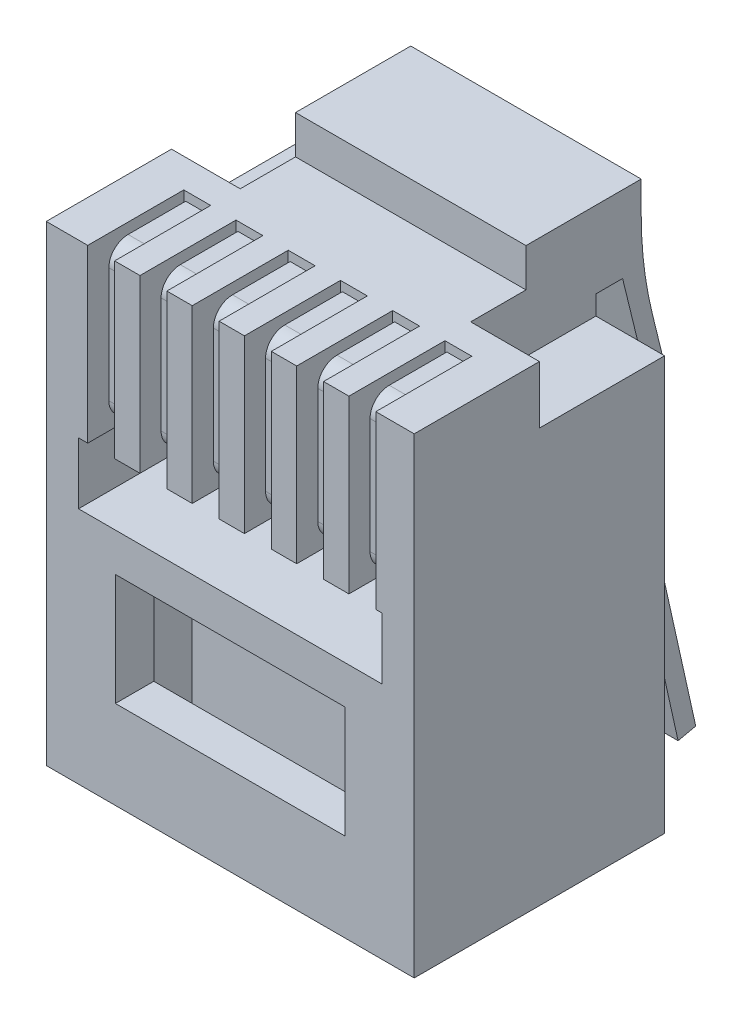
ISO-10303-21;
HEADER;
FILE_DESCRIPTION(('STEP AP214'),'2;1');
FILE_NAME('part.step','',(''),(''),'','','');
FILE_SCHEMA(('AUTOMOTIVE_DESIGN { 1 0 10303 214 1 1 1 1 }'));
ENDSEC;
DATA;
#1=APPLICATION_CONTEXT('core data for automotive mechanical design processes');
#2=APPLICATION_PROTOCOL_DEFINITION('international standard','automotive_design',2000,#1);
#3=PRODUCT_CONTEXT('',#1,'mechanical');
#4=PRODUCT('Part','Part','',(#3));
#5=PRODUCT_RELATED_PRODUCT_CATEGORY('part','',(#4));
#6=PRODUCT_DEFINITION_FORMATION('','',#4);
#7=PRODUCT_DEFINITION_CONTEXT('part definition',#1,'design');
#8=PRODUCT_DEFINITION('design','',#6,#7);
#9=PRODUCT_DEFINITION_SHAPE('','',#8);
#10=(LENGTH_UNIT() NAMED_UNIT(*) SI_UNIT(.MILLI.,.METRE.));
#11=(NAMED_UNIT(*) PLANE_ANGLE_UNIT() SI_UNIT($,.RADIAN.));
#12=(NAMED_UNIT(*) SI_UNIT($,.STERADIAN.) SOLID_ANGLE_UNIT());
#13=UNCERTAINTY_MEASURE_WITH_UNIT(LENGTH_MEASURE(1.E-05),#10,'distance_accuracy_value','');
#14=(GEOMETRIC_REPRESENTATION_CONTEXT(3) GLOBAL_UNCERTAINTY_ASSIGNED_CONTEXT((#13)) GLOBAL_UNIT_ASSIGNED_CONTEXT((#10,
#11,#12)) REPRESENTATION_CONTEXT('',''));
#15=CARTESIAN_POINT('',(0.,0.,0.));
#16=DIRECTION('',(0.,0.,1.));
#17=DIRECTION('',(1.,0.,0.));
#18=AXIS2_PLACEMENT_3D('',#15,#16,#17);
#19=CARTESIAN_POINT('',(6.8,8.54,5.52));
#20=DIRECTION('',(1.,0.,0.));
#21=DIRECTION('',(0.,0.,-1.));
#22=AXIS2_PLACEMENT_3D('',#19,#20,#21);
#23=CYLINDRICAL_SURFACE('',#22,0.5);
#24=CARTESIAN_POINT('',(3.74,8.54,5.52));
#25=DIRECTION('',(1.,0.,0.));
#26=DIRECTION('',(0.,0.,-1.));
#27=AXIS2_PLACEMENT_3D('',#24,#25,#26);
#28=CIRCLE('',#27,0.5);
#29=CARTESIAN_POINT('',(3.74,8.04,5.52));
#30=VERTEX_POINT('',#29);
#31=CARTESIAN_POINT('',(3.74,8.54,6.02));
#32=VERTEX_POINT('',#31);
#33=EDGE_CURVE('E20',#30,#32,#28,.F.);
#34=ORIENTED_EDGE('',*,*,#33,.T.);
#35=DIRECTION('',(-1.,0.,0.));
#36=VECTOR('',#35,1.);
#37=CARTESIAN_POINT('',(6.8,8.54,6.02));
#38=LINE('',#37,#36);
#39=CARTESIAN_POINT('',(3.14,8.54,6.02));
#40=VERTEX_POINT('',#39);
#41=EDGE_CURVE('E951',#32,#40,#38,.T.);
#42=ORIENTED_EDGE('',*,*,#41,.T.);
#43=CARTESIAN_POINT('',(3.14,8.54,5.52));
#44=DIRECTION('',(1.,0.,0.));
#45=DIRECTION('',(0.,0.,-1.));
#46=AXIS2_PLACEMENT_3D('',#43,#44,#45);
#47=CIRCLE('',#46,0.5);
#48=CARTESIAN_POINT('',(3.14,8.04,5.52));
#49=VERTEX_POINT('',#48);
#50=EDGE_CURVE('E1203',#40,#49,#47,.T.);
#51=ORIENTED_EDGE('',*,*,#50,.T.);
#52=DIRECTION('',(1.,0.,0.));
#53=VECTOR('',#52,1.);
#54=CARTESIAN_POINT('',(3.14,8.04,5.52));
#55=LINE('',#54,#53);
#56=EDGE_CURVE('E958',#49,#30,#55,.T.);
#57=ORIENTED_EDGE('',*,*,#56,.T.);
#58=EDGE_LOOP('',(#34,#42,#51,#57));
#59=FACE_BOUND('',#58,.T.);
#60=ADVANCED_FACE('F17',(#59),#23,.T.);
#61=CARTESIAN_POINT('',(3.14,8.04,6.02));
#62=DIRECTION('',(0.,1.,0.));
#63=DIRECTION('',(0.,0.,1.));
#64=AXIS2_PLACEMENT_3D('',#61,#62,#63);
#65=PLANE('',#64);
#66=ORIENTED_EDGE('',*,*,#56,.F.);
#67=DIRECTION('',(0.,0.,-1.));
#68=VECTOR('',#67,1.);
#69=CARTESIAN_POINT('',(3.14,8.04,6.02));
#70=LINE('',#69,#68);
#71=CARTESIAN_POINT('',(3.14,8.04,4.02));
#72=VERTEX_POINT('',#71);
#73=EDGE_CURVE('E1204',#49,#72,#70,.T.);
#74=ORIENTED_EDGE('',*,*,#73,.T.);
#75=DIRECTION('',(1.,0.,0.));
#76=VECTOR('',#75,1.);
#77=CARTESIAN_POINT('',(3.14,8.04,4.02));
#78=LINE('',#77,#76);
#79=CARTESIAN_POINT('',(3.74,8.04,4.02));
#80=VERTEX_POINT('',#79);
#81=EDGE_CURVE('E969',#80,#72,#78,.F.);
#82=ORIENTED_EDGE('',*,*,#81,.F.);
#83=DIRECTION('',(0.,0.,1.));
#84=VECTOR('',#83,1.);
#85=CARTESIAN_POINT('',(3.74,8.04,6.02));
#86=LINE('',#85,#84);
#87=EDGE_CURVE('E748',#80,#30,#86,.T.);
#88=ORIENTED_EDGE('',*,*,#87,.T.);
#89=EDGE_LOOP('',(#66,#74,#82,#88));
#90=FACE_BOUND('',#89,.T.);
#91=ADVANCED_FACE('F1367',(#90),#65,.F.);
#92=CARTESIAN_POINT('',(3.14,12.04,6.02));
#93=DIRECTION('',(0.,-1.,0.));
#94=DIRECTION('',(0.,0.,-1.));
#95=AXIS2_PLACEMENT_3D('',#92,#93,#94);
#96=PLANE('',#95);
#97=DIRECTION('',(-1.,0.,0.));
#98=VECTOR('',#97,1.);
#99=CARTESIAN_POINT('',(6.8,12.04,5.52));
#100=LINE('',#99,#98);
#101=CARTESIAN_POINT('',(3.74,12.04,5.52));
#102=VERTEX_POINT('',#101);
#103=CARTESIAN_POINT('',(3.14,12.04,5.52));
#104=VERTEX_POINT('',#103);
#105=EDGE_CURVE('E953',#102,#104,#100,.T.);
#106=ORIENTED_EDGE('',*,*,#105,.F.);
#107=DIRECTION('',(0.,0.,1.));
#108=VECTOR('',#107,1.);
#109=CARTESIAN_POINT('',(3.74,12.04,6.02));
#110=LINE('',#109,#108);
#111=CARTESIAN_POINT('',(3.74,12.04,4.02));
#112=VERTEX_POINT('',#111);
#113=EDGE_CURVE('E1205',#102,#112,#110,.F.);
#114=ORIENTED_EDGE('',*,*,#113,.T.);
#115=DIRECTION('',(1.,0.,0.));
#116=VECTOR('',#115,1.);
#117=CARTESIAN_POINT('',(3.14,12.04,4.02));
#118=LINE('',#117,#116);
#119=CARTESIAN_POINT('',(3.14,12.04,4.02));
#120=VERTEX_POINT('',#119);
#121=EDGE_CURVE('E956',#120,#112,#118,.T.);
#122=ORIENTED_EDGE('',*,*,#121,.F.);
#123=DIRECTION('',(0.,0.,-1.));
#124=VECTOR('',#123,1.);
#125=CARTESIAN_POINT('',(3.14,12.04,6.02));
#126=LINE('',#125,#124);
#127=EDGE_CURVE('E1202',#120,#104,#126,.F.);
#128=ORIENTED_EDGE('',*,*,#127,.T.);
#129=EDGE_LOOP('',(#106,#114,#122,#128));
#130=FACE_BOUND('',#129,.T.);
#131=ADVANCED_FACE('F1386',(#130),#96,.F.);
#132=CARTESIAN_POINT('',(6.8,11.54,5.52));
#133=DIRECTION('',(-1.,0.,0.));
#134=DIRECTION('',(0.,0.,1.));
#135=AXIS2_PLACEMENT_3D('',#132,#133,#134);
#136=CYLINDRICAL_SURFACE('',#135,0.5);
#137=CARTESIAN_POINT('',(3.14,11.54,5.52));
#138=DIRECTION('',(-1.,0.,0.));
#139=DIRECTION('',(0.,0.,1.));
#140=AXIS2_PLACEMENT_3D('',#137,#138,#139);
#141=CIRCLE('',#140,0.5);
#142=CARTESIAN_POINT('',(3.14,11.54,6.02));
#143=VERTEX_POINT('',#142);
#144=EDGE_CURVE('E1200',#104,#143,#141,.F.);
#145=ORIENTED_EDGE('',*,*,#144,.T.);
#146=DIRECTION('',(-1.,0.,0.));
#147=VECTOR('',#146,1.);
#148=CARTESIAN_POINT('',(6.8,11.54,6.02));
#149=LINE('',#148,#147);
#150=CARTESIAN_POINT('',(3.74,11.54,6.02));
#151=VERTEX_POINT('',#150);
#152=EDGE_CURVE('E942',#143,#151,#149,.F.);
#153=ORIENTED_EDGE('',*,*,#152,.T.);
#154=CARTESIAN_POINT('',(3.74,11.54,5.52));
#155=DIRECTION('',(-1.,0.,0.));
#156=DIRECTION('',(0.,0.,1.));
#157=AXIS2_PLACEMENT_3D('',#154,#155,#156);
#158=CIRCLE('',#157,0.5);
#159=EDGE_CURVE('E1206',#151,#102,#158,.T.);
#160=ORIENTED_EDGE('',*,*,#159,.T.);
#161=ORIENTED_EDGE('',*,*,#105,.T.);
#162=EDGE_LOOP('',(#145,#153,#160,#161));
#163=FACE_BOUND('',#162,.T.);
#164=ADVANCED_FACE('F1384',(#163),#136,.T.);
#165=CARTESIAN_POINT('',(6.8,0.,6.02));
#166=DIRECTION('',(0.,0.,-1.));
#167=DIRECTION('',(-1.,0.,0.));
#168=AXIS2_PLACEMENT_3D('',#165,#166,#167);
#169=PLANE('',#168);
#170=ORIENTED_EDGE('',*,*,#152,.F.);
#171=DIRECTION('',(0.,1.,0.));
#172=VECTOR('',#171,1.);
#173=CARTESIAN_POINT('',(3.14,8.04,6.02));
#174=LINE('',#173,#172);
#175=EDGE_CURVE('E1199',#143,#40,#174,.F.);
#176=ORIENTED_EDGE('',*,*,#175,.T.);
#177=ORIENTED_EDGE('',*,*,#41,.F.);
#178=DIRECTION('',(0.,1.,0.));
#179=VECTOR('',#178,1.);
#180=CARTESIAN_POINT('',(3.74,8.04,6.02));
#181=LINE('',#180,#179);
#182=EDGE_CURVE('E1208',#32,#151,#181,.T.);
#183=ORIENTED_EDGE('',*,*,#182,.T.);
#184=EDGE_LOOP('',(#170,#176,#177,#183));
#185=FACE_BOUND('',#184,.T.);
#186=ADVANCED_FACE('F1382',(#185),#169,.F.);
#187=CARTESIAN_POINT('',(1.78,8.04,6.02));
#188=DIRECTION('',(0.,1.,0.));
#189=DIRECTION('',(0.,0.,1.));
#190=AXIS2_PLACEMENT_3D('',#187,#188,#189);
#191=PLANE('',#190);
#192=DIRECTION('',(1.,0.,0.));
#193=VECTOR('',#192,1.);
#194=CARTESIAN_POINT('',(5.44,8.04,5.52));
#195=LINE('',#194,#193);
#196=CARTESIAN_POINT('',(1.78,8.04,5.52));
#197=VERTEX_POINT('',#196);
#198=CARTESIAN_POINT('',(2.38,8.04,5.52));
#199=VERTEX_POINT('',#198);
#200=EDGE_CURVE('E937',#197,#199,#195,.T.);
#201=ORIENTED_EDGE('',*,*,#200,.F.);
#202=DIRECTION('',(0.,0.,-1.));
#203=VECTOR('',#202,1.);
#204=CARTESIAN_POINT('',(1.78,8.04,6.02));
#205=LINE('',#204,#203);
#206=CARTESIAN_POINT('',(1.78,8.04,4.02));
#207=VERTEX_POINT('',#206);
#208=EDGE_CURVE('E1198',#197,#207,#205,.T.);
#209=ORIENTED_EDGE('',*,*,#208,.T.);
#210=DIRECTION('',(1.,0.,0.));
#211=VECTOR('',#210,1.);
#212=CARTESIAN_POINT('',(1.78,8.04,4.02));
#213=LINE('',#212,#211);
#214=CARTESIAN_POINT('',(2.38,8.04,4.02));
#215=VERTEX_POINT('',#214);
#216=EDGE_CURVE('E940',#215,#207,#213,.F.);
#217=ORIENTED_EDGE('',*,*,#216,.F.);
#218=DIRECTION('',(0.,0.,1.));
#219=VECTOR('',#218,1.);
#220=CARTESIAN_POINT('',(2.38,8.04,6.02));
#221=LINE('',#220,#219);
#222=EDGE_CURVE('E1189',#215,#199,#221,.T.);
#223=ORIENTED_EDGE('',*,*,#222,.T.);
#224=EDGE_LOOP('',(#201,#209,#217,#223));
#225=FACE_BOUND('',#224,.T.);
#226=ADVANCED_FACE('F1874',(#225),#191,.F.);
#227=CARTESIAN_POINT('',(5.44,8.54,5.52));
#228=DIRECTION('',(1.,0.,0.));
#229=DIRECTION('',(0.,0.,-1.));
#230=AXIS2_PLACEMENT_3D('',#227,#228,#229);
#231=CYLINDRICAL_SURFACE('',#230,0.5);
#232=CARTESIAN_POINT('',(2.38,8.54,5.52));
#233=DIRECTION('',(1.,0.,0.));
#234=DIRECTION('',(0.,0.,-1.));
#235=AXIS2_PLACEMENT_3D('',#232,#233,#234);
#236=CIRCLE('',#235,0.5);
#237=CARTESIAN_POINT('',(2.38,8.54,6.02));
#238=VERTEX_POINT('',#237);
#239=EDGE_CURVE('E1187',#199,#238,#236,.F.);
#240=ORIENTED_EDGE('',*,*,#239,.T.);
#241=DIRECTION('',(-1.,0.,0.));
#242=VECTOR('',#241,1.);
#243=CARTESIAN_POINT('',(5.44,8.54,6.02));
#244=LINE('',#243,#242);
#245=CARTESIAN_POINT('',(1.78,8.54,6.02));
#246=VERTEX_POINT('',#245);
#247=EDGE_CURVE('E935',#238,#246,#244,.T.);
#248=ORIENTED_EDGE('',*,*,#247,.T.);
#249=CARTESIAN_POINT('',(1.78,8.54,5.52));
#250=DIRECTION('',(1.,0.,0.));
#251=DIRECTION('',(0.,0.,-1.));
#252=AXIS2_PLACEMENT_3D('',#249,#250,#251);
#253=CIRCLE('',#252,0.5);
#254=EDGE_CURVE('E1195',#246,#197,#253,.T.);
#255=ORIENTED_EDGE('',*,*,#254,.T.);
#256=ORIENTED_EDGE('',*,*,#200,.T.);
#257=EDGE_LOOP('',(#240,#248,#255,#256));
#258=FACE_BOUND('',#257,.T.);
#259=ADVANCED_FACE('F1870',(#258),#231,.T.);
#260=CARTESIAN_POINT('',(5.44,0.,6.02));
#261=DIRECTION('',(0.,0.,-1.));
#262=DIRECTION('',(-1.,0.,0.));
#263=AXIS2_PLACEMENT_3D('',#260,#261,#262);
#264=PLANE('',#263);
#265=DIRECTION('',(-1.,0.,0.));
#266=VECTOR('',#265,1.);
#267=CARTESIAN_POINT('',(5.44,11.54,6.02));
#268=LINE('',#267,#266);
#269=CARTESIAN_POINT('',(1.78,11.54,6.02));
#270=VERTEX_POINT('',#269);
#271=CARTESIAN_POINT('',(2.38,11.54,6.02));
#272=VERTEX_POINT('',#271);
#273=EDGE_CURVE('E923',#270,#272,#268,.F.);
#274=ORIENTED_EDGE('',*,*,#273,.F.);
#275=DIRECTION('',(0.,1.,0.));
#276=VECTOR('',#275,1.);
#277=CARTESIAN_POINT('',(1.78,8.04,6.02));
#278=LINE('',#277,#276);
#279=EDGE_CURVE('E1193',#270,#246,#278,.F.);
#280=ORIENTED_EDGE('',*,*,#279,.T.);
#281=ORIENTED_EDGE('',*,*,#247,.F.);
#282=DIRECTION('',(0.,1.,0.));
#283=VECTOR('',#282,1.);
#284=CARTESIAN_POINT('',(2.38,8.04,6.02));
#285=LINE('',#284,#283);
#286=EDGE_CURVE('E1186',#238,#272,#285,.T.);
#287=ORIENTED_EDGE('',*,*,#286,.T.);
#288=EDGE_LOOP('',(#274,#280,#281,#287));
#289=FACE_BOUND('',#288,.T.);
#290=ADVANCED_FACE('F1866',(#289),#264,.F.);
#291=CARTESIAN_POINT('',(5.44,11.54,5.52));
#292=DIRECTION('',(-1.,0.,0.));
#293=DIRECTION('',(0.,0.,1.));
#294=AXIS2_PLACEMENT_3D('',#291,#292,#293);
#295=CYLINDRICAL_SURFACE('',#294,0.5);
#296=CARTESIAN_POINT('',(1.78,11.54,5.52));
#297=DIRECTION('',(-1.,0.,0.));
#298=DIRECTION('',(0.,0.,1.));
#299=AXIS2_PLACEMENT_3D('',#296,#297,#298);
#300=CIRCLE('',#299,0.5);
#301=CARTESIAN_POINT('',(1.78,12.04,5.52));
#302=VERTEX_POINT('',#301);
#303=EDGE_CURVE('E1190',#302,#270,#300,.F.);
#304=ORIENTED_EDGE('',*,*,#303,.T.);
#305=ORIENTED_EDGE('',*,*,#273,.T.);
#306=CARTESIAN_POINT('',(2.38,11.54,5.52));
#307=DIRECTION('',(-1.,0.,0.));
#308=DIRECTION('',(0.,0.,1.));
#309=AXIS2_PLACEMENT_3D('',#306,#307,#308);
#310=CIRCLE('',#309,0.5);
#311=CARTESIAN_POINT('',(2.38,12.04,5.52));
#312=VERTEX_POINT('',#311);
#313=EDGE_CURVE('E1183',#272,#312,#310,.T.);
#314=ORIENTED_EDGE('',*,*,#313,.T.);
#315=DIRECTION('',(1.,0.,0.));
#316=VECTOR('',#315,1.);
#317=CARTESIAN_POINT('',(1.78,12.04,5.52));
#318=LINE('',#317,#316);
#319=EDGE_CURVE('E912',#312,#302,#318,.F.);
#320=ORIENTED_EDGE('',*,*,#319,.T.);
#321=EDGE_LOOP('',(#304,#305,#314,#320));
#322=FACE_BOUND('',#321,.T.);
#323=ADVANCED_FACE('F1862',(#322),#295,.T.);
#324=CARTESIAN_POINT('',(1.78,12.04,6.02));
#325=DIRECTION('',(0.,-1.,0.));
#326=DIRECTION('',(0.,0.,-1.));
#327=AXIS2_PLACEMENT_3D('',#324,#325,#326);
#328=PLANE('',#327);
#329=ORIENTED_EDGE('',*,*,#319,.F.);
#330=DIRECTION('',(0.,0.,1.));
#331=VECTOR('',#330,1.);
#332=CARTESIAN_POINT('',(2.38,12.04,6.02));
#333=LINE('',#332,#331);
#334=CARTESIAN_POINT('',(2.38,12.04,4.02));
#335=VERTEX_POINT('',#334);
#336=EDGE_CURVE('E1185',#312,#335,#333,.F.);
#337=ORIENTED_EDGE('',*,*,#336,.T.);
#338=DIRECTION('',(1.,0.,0.));
#339=VECTOR('',#338,1.);
#340=CARTESIAN_POINT('',(1.78,12.04,4.02));
#341=LINE('',#340,#339);
#342=CARTESIAN_POINT('',(1.78,12.04,4.02));
#343=VERTEX_POINT('',#342);
#344=EDGE_CURVE('E921',#343,#335,#341,.T.);
#345=ORIENTED_EDGE('',*,*,#344,.F.);
#346=DIRECTION('',(0.,0.,-1.));
#347=VECTOR('',#346,1.);
#348=CARTESIAN_POINT('',(1.78,12.04,6.02));
#349=LINE('',#348,#347);
#350=EDGE_CURVE('E1194',#343,#302,#349,.F.);
#351=ORIENTED_EDGE('',*,*,#350,.T.);
#352=EDGE_LOOP('',(#329,#337,#345,#351));
#353=FACE_BOUND('',#352,.T.);
#354=ADVANCED_FACE('F1858',(#353),#328,.F.);
#355=CARTESIAN_POINT('',(4.08,11.54,5.52));
#356=DIRECTION('',(-1.,0.,0.));
#357=DIRECTION('',(0.,0.,1.));
#358=AXIS2_PLACEMENT_3D('',#355,#356,#357);
#359=CYLINDRICAL_SURFACE('',#358,0.5);
#360=CARTESIAN_POINT('',(0.42,11.54,5.52));
#361=DIRECTION('',(-1.,0.,0.));
#362=DIRECTION('',(0.,0.,1.));
#363=AXIS2_PLACEMENT_3D('',#360,#361,#362);
#364=CIRCLE('',#363,0.5);
#365=CARTESIAN_POINT('',(0.42,12.04,5.52));
#366=VERTEX_POINT('',#365);
#367=CARTESIAN_POINT('',(0.42,11.54,6.02));
#368=VERTEX_POINT('',#367);
#369=EDGE_CURVE('E1180',#366,#368,#364,.F.);
#370=ORIENTED_EDGE('',*,*,#369,.T.);
#371=DIRECTION('',(-1.,0.,0.));
#372=VECTOR('',#371,1.);
#373=CARTESIAN_POINT('',(4.08,11.54,6.02));
#374=LINE('',#373,#372);
#375=CARTESIAN_POINT('',(1.02,11.54,6.02));
#376=VERTEX_POINT('',#375);
#377=EDGE_CURVE('E892',#368,#376,#374,.F.);
#378=ORIENTED_EDGE('',*,*,#377,.T.);
#379=CARTESIAN_POINT('',(1.02,11.54,5.52));
#380=DIRECTION('',(-1.,0.,0.));
#381=DIRECTION('',(0.,0.,1.));
#382=AXIS2_PLACEMENT_3D('',#379,#380,#381);
#383=CIRCLE('',#382,0.5);
#384=CARTESIAN_POINT('',(1.02,12.04,5.52));
#385=VERTEX_POINT('',#384);
#386=EDGE_CURVE('E1172',#376,#385,#383,.T.);
#387=ORIENTED_EDGE('',*,*,#386,.T.);
#388=DIRECTION('',(1.,0.,0.));
#389=VECTOR('',#388,1.);
#390=CARTESIAN_POINT('',(0.42,12.04,5.52));
#391=LINE('',#390,#389);
#392=EDGE_CURVE('E899',#385,#366,#391,.F.);
#393=ORIENTED_EDGE('',*,*,#392,.T.);
#394=EDGE_LOOP('',(#370,#378,#387,#393));
#395=FACE_BOUND('',#394,.T.);
#396=ADVANCED_FACE('F1854',(#395),#359,.T.);
#397=CARTESIAN_POINT('',(0.42,12.04,6.02));
#398=DIRECTION('',(0.,-1.,0.));
#399=DIRECTION('',(0.,0.,-1.));
#400=AXIS2_PLACEMENT_3D('',#397,#398,#399);
#401=PLANE('',#400);
#402=ORIENTED_EDGE('',*,*,#392,.F.);
#403=DIRECTION('',(0.,0.,1.));
#404=VECTOR('',#403,1.);
#405=CARTESIAN_POINT('',(1.02,12.04,6.02));
#406=LINE('',#405,#404);
#407=CARTESIAN_POINT('',(1.02,12.04,4.02));
#408=VERTEX_POINT('',#407);
#409=EDGE_CURVE('E1174',#385,#408,#406,.F.);
#410=ORIENTED_EDGE('',*,*,#409,.T.);
#411=DIRECTION('',(1.,0.,0.));
#412=VECTOR('',#411,1.);
#413=CARTESIAN_POINT('',(0.42,12.04,4.02));
#414=LINE('',#413,#412);
#415=CARTESIAN_POINT('',(0.42,12.04,4.02));
#416=VERTEX_POINT('',#415);
#417=EDGE_CURVE('E910',#416,#408,#414,.T.);
#418=ORIENTED_EDGE('',*,*,#417,.F.);
#419=DIRECTION('',(0.,0.,-1.));
#420=VECTOR('',#419,1.);
#421=CARTESIAN_POINT('',(0.42,12.04,6.02));
#422=LINE('',#421,#420);
#423=EDGE_CURVE('E1182',#416,#366,#422,.F.);
#424=ORIENTED_EDGE('',*,*,#423,.T.);
#425=EDGE_LOOP('',(#402,#410,#418,#424));
#426=FACE_BOUND('',#425,.T.);
#427=ADVANCED_FACE('F1850',(#426),#401,.F.);
#428=CARTESIAN_POINT('',(0.42,8.04,6.02));
#429=DIRECTION('',(0.,1.,0.));
#430=DIRECTION('',(0.,0.,1.));
#431=AXIS2_PLACEMENT_3D('',#428,#429,#430);
#432=PLANE('',#431);
#433=DIRECTION('',(1.,0.,0.));
#434=VECTOR('',#433,1.);
#435=CARTESIAN_POINT('',(4.08,8.04,5.52));
#436=LINE('',#435,#434);
#437=CARTESIAN_POINT('',(0.42,8.04,5.52));
#438=VERTEX_POINT('',#437);
#439=CARTESIAN_POINT('',(1.02,8.04,5.52));
#440=VERTEX_POINT('',#439);
#441=EDGE_CURVE('E894',#438,#440,#436,.T.);
#442=ORIENTED_EDGE('',*,*,#441,.F.);
#443=DIRECTION('',(0.,0.,-1.));
#444=VECTOR('',#443,1.);
#445=CARTESIAN_POINT('',(0.42,8.04,6.02));
#446=LINE('',#445,#444);
#447=CARTESIAN_POINT('',(0.42,8.04,4.02));
#448=VERTEX_POINT('',#447);
#449=EDGE_CURVE('E1175',#438,#448,#446,.T.);
#450=ORIENTED_EDGE('',*,*,#449,.T.);
#451=DIRECTION('',(1.,0.,0.));
#452=VECTOR('',#451,1.);
#453=CARTESIAN_POINT('',(0.42,8.04,4.02));
#454=LINE('',#453,#452);
#455=CARTESIAN_POINT('',(1.02,8.04,4.02));
#456=VERTEX_POINT('',#455);
#457=EDGE_CURVE('E897',#456,#448,#454,.F.);
#458=ORIENTED_EDGE('',*,*,#457,.F.);
#459=DIRECTION('',(0.,0.,1.));
#460=VECTOR('',#459,1.);
#461=CARTESIAN_POINT('',(1.02,8.04,6.02));
#462=LINE('',#461,#460);
#463=EDGE_CURVE('E1171',#456,#440,#462,.T.);
#464=ORIENTED_EDGE('',*,*,#463,.T.);
#465=EDGE_LOOP('',(#442,#450,#458,#464));
#466=FACE_BOUND('',#465,.T.);
#467=ADVANCED_FACE('F1846',(#466),#432,.F.);
#468=CARTESIAN_POINT('',(4.08,8.54,5.52));
#469=DIRECTION('',(1.,0.,0.));
#470=DIRECTION('',(0.,0.,-1.));
#471=AXIS2_PLACEMENT_3D('',#468,#469,#470);
#472=CYLINDRICAL_SURFACE('',#471,0.5);
#473=CARTESIAN_POINT('',(1.02,8.54,5.52));
#474=DIRECTION('',(1.,0.,0.));
#475=DIRECTION('',(0.,0.,-1.));
#476=AXIS2_PLACEMENT_3D('',#473,#474,#475);
#477=CIRCLE('',#476,0.5);
#478=CARTESIAN_POINT('',(1.02,8.54,6.02));
#479=VERTEX_POINT('',#478);
#480=EDGE_CURVE('E1169',#440,#479,#477,.F.);
#481=ORIENTED_EDGE('',*,*,#480,.T.);
#482=DIRECTION('',(-1.,0.,0.));
#483=VECTOR('',#482,1.);
#484=CARTESIAN_POINT('',(4.08,8.54,6.02));
#485=LINE('',#484,#483);
#486=CARTESIAN_POINT('',(0.42,8.54,6.02));
#487=VERTEX_POINT('',#486);
#488=EDGE_CURVE('E883',#479,#487,#485,.T.);
#489=ORIENTED_EDGE('',*,*,#488,.T.);
#490=CARTESIAN_POINT('',(0.42,8.54,5.52));
#491=DIRECTION('',(1.,0.,0.));
#492=DIRECTION('',(0.,0.,-1.));
#493=AXIS2_PLACEMENT_3D('',#490,#491,#492);
#494=CIRCLE('',#493,0.5);
#495=EDGE_CURVE('E1176',#487,#438,#494,.T.);
#496=ORIENTED_EDGE('',*,*,#495,.T.);
#497=ORIENTED_EDGE('',*,*,#441,.T.);
#498=EDGE_LOOP('',(#481,#489,#496,#497));
#499=FACE_BOUND('',#498,.T.);
#500=ADVANCED_FACE('F1842',(#499),#472,.T.);
#501=CARTESIAN_POINT('',(4.08,0.,6.02));
#502=DIRECTION('',(0.,0.,-1.));
#503=DIRECTION('',(-1.,0.,0.));
#504=AXIS2_PLACEMENT_3D('',#501,#502,#503);
#505=PLANE('',#504);
#506=ORIENTED_EDGE('',*,*,#488,.F.);
#507=DIRECTION('',(0.,1.,0.));
#508=VECTOR('',#507,1.);
#509=CARTESIAN_POINT('',(1.02,8.04,6.02));
#510=LINE('',#509,#508);
#511=EDGE_CURVE('E1168',#479,#376,#510,.T.);
#512=ORIENTED_EDGE('',*,*,#511,.T.);
#513=ORIENTED_EDGE('',*,*,#377,.F.);
#514=DIRECTION('',(0.,1.,0.));
#515=VECTOR('',#514,1.);
#516=CARTESIAN_POINT('',(0.42,8.04,6.02));
#517=LINE('',#516,#515);
#518=EDGE_CURVE('E1179',#368,#487,#517,.F.);
#519=ORIENTED_EDGE('',*,*,#518,.T.);
#520=EDGE_LOOP('',(#506,#512,#513,#519));
#521=FACE_BOUND('',#520,.T.);
#522=ADVANCED_FACE('F1838',(#521),#505,.F.);
#523=CARTESIAN_POINT('',(-0.94,8.04,6.02));
#524=DIRECTION('',(0.,1.,0.));
#525=DIRECTION('',(0.,0.,1.));
#526=AXIS2_PLACEMENT_3D('',#523,#524,#525);
#527=PLANE('',#526);
#528=DIRECTION('',(1.,0.,0.));
#529=VECTOR('',#528,1.);
#530=CARTESIAN_POINT('',(2.72,8.04,5.52));
#531=LINE('',#530,#529);
#532=CARTESIAN_POINT('',(-0.94,8.04,5.52));
#533=VERTEX_POINT('',#532);
#534=CARTESIAN_POINT('',(-0.34,8.04,5.52));
#535=VERTEX_POINT('',#534);
#536=EDGE_CURVE('E878',#533,#535,#531,.T.);
#537=ORIENTED_EDGE('',*,*,#536,.F.);
#538=DIRECTION('',(0.,0.,-1.));
#539=VECTOR('',#538,1.);
#540=CARTESIAN_POINT('',(-0.94,8.04,6.02));
#541=LINE('',#540,#539);
#542=CARTESIAN_POINT('',(-0.94,8.04,4.02));
#543=VERTEX_POINT('',#542);
#544=EDGE_CURVE('E1167',#533,#543,#541,.T.);
#545=ORIENTED_EDGE('',*,*,#544,.T.);
#546=DIRECTION('',(1.,0.,0.));
#547=VECTOR('',#546,1.);
#548=CARTESIAN_POINT('',(-0.94,8.04,4.02));
#549=LINE('',#548,#547);
#550=CARTESIAN_POINT('',(-0.34,8.04,4.02));
#551=VERTEX_POINT('',#550);
#552=EDGE_CURVE('E881',#551,#543,#549,.F.);
#553=ORIENTED_EDGE('',*,*,#552,.F.);
#554=DIRECTION('',(0.,0.,1.));
#555=VECTOR('',#554,1.);
#556=CARTESIAN_POINT('',(-0.34,8.04,6.02));
#557=LINE('',#556,#555);
#558=EDGE_CURVE('E1158',#551,#535,#557,.T.);
#559=ORIENTED_EDGE('',*,*,#558,.T.);
#560=EDGE_LOOP('',(#537,#545,#553,#559));
#561=FACE_BOUND('',#560,.T.);
#562=ADVANCED_FACE('F1834',(#561),#527,.F.);
#563=CARTESIAN_POINT('',(2.72,8.54,5.52));
#564=DIRECTION('',(1.,0.,0.));
#565=DIRECTION('',(0.,0.,-1.));
#566=AXIS2_PLACEMENT_3D('',#563,#564,#565);
#567=CYLINDRICAL_SURFACE('',#566,0.5);
#568=CARTESIAN_POINT('',(-0.34,8.54,5.52));
#569=DIRECTION('',(1.,0.,0.));
#570=DIRECTION('',(0.,0.,-1.));
#571=AXIS2_PLACEMENT_3D('',#568,#569,#570);
#572=CIRCLE('',#571,0.5);
#573=CARTESIAN_POINT('',(-0.34,8.54,6.02));
#574=VERTEX_POINT('',#573);
#575=EDGE_CURVE('E1156',#535,#574,#572,.F.);
#576=ORIENTED_EDGE('',*,*,#575,.T.);
#577=DIRECTION('',(-1.,0.,0.));
#578=VECTOR('',#577,1.);
#579=CARTESIAN_POINT('',(2.72,8.54,6.02));
#580=LINE('',#579,#578);
#581=CARTESIAN_POINT('',(-0.94,8.54,6.02));
#582=VERTEX_POINT('',#581);
#583=EDGE_CURVE('E876',#574,#582,#580,.T.);
#584=ORIENTED_EDGE('',*,*,#583,.T.);
#585=CARTESIAN_POINT('',(-0.94,8.54,5.52));
#586=DIRECTION('',(1.,0.,0.));
#587=DIRECTION('',(0.,0.,-1.));
#588=AXIS2_PLACEMENT_3D('',#585,#586,#587);
#589=CIRCLE('',#588,0.5);
#590=EDGE_CURVE('E1164',#582,#533,#589,.T.);
#591=ORIENTED_EDGE('',*,*,#590,.T.);
#592=ORIENTED_EDGE('',*,*,#536,.T.);
#593=EDGE_LOOP('',(#576,#584,#591,#592));
#594=FACE_BOUND('',#593,.T.);
#595=ADVANCED_FACE('F1830',(#594),#567,.T.);
#596=CARTESIAN_POINT('',(2.72,0.,6.02));
#597=DIRECTION('',(0.,0.,-1.));
#598=DIRECTION('',(-1.,0.,0.));
#599=AXIS2_PLACEMENT_3D('',#596,#597,#598);
#600=PLANE('',#599);
#601=DIRECTION('',(-1.,0.,0.));
#602=VECTOR('',#601,1.);
#603=CARTESIAN_POINT('',(2.72,11.54,6.02));
#604=LINE('',#603,#602);
#605=CARTESIAN_POINT('',(-0.94,11.54,6.02));
#606=VERTEX_POINT('',#605);
#607=CARTESIAN_POINT('',(-0.34,11.54,6.02));
#608=VERTEX_POINT('',#607);
#609=EDGE_CURVE('E864',#606,#608,#604,.F.);
#610=ORIENTED_EDGE('',*,*,#609,.F.);
#611=DIRECTION('',(0.,1.,0.));
#612=VECTOR('',#611,1.);
#613=CARTESIAN_POINT('',(-0.94,8.04,6.02));
#614=LINE('',#613,#612);
#615=EDGE_CURVE('E1162',#606,#582,#614,.F.);
#616=ORIENTED_EDGE('',*,*,#615,.T.);
#617=ORIENTED_EDGE('',*,*,#583,.F.);
#618=DIRECTION('',(0.,1.,0.));
#619=VECTOR('',#618,1.);
#620=CARTESIAN_POINT('',(-0.34,8.04,6.02));
#621=LINE('',#620,#619);
#622=EDGE_CURVE('E1155',#574,#608,#621,.T.);
#623=ORIENTED_EDGE('',*,*,#622,.T.);
#624=EDGE_LOOP('',(#610,#616,#617,#623));
#625=FACE_BOUND('',#624,.T.);
#626=ADVANCED_FACE('F1826',(#625),#600,.F.);
#627=CARTESIAN_POINT('',(2.72,11.54,5.52));
#628=DIRECTION('',(-1.,0.,0.));
#629=DIRECTION('',(0.,0.,1.));
#630=AXIS2_PLACEMENT_3D('',#627,#628,#629);
#631=CYLINDRICAL_SURFACE('',#630,0.5);
#632=CARTESIAN_POINT('',(-0.94,11.54,5.52));
#633=DIRECTION('',(-1.,0.,0.));
#634=DIRECTION('',(0.,0.,1.));
#635=AXIS2_PLACEMENT_3D('',#632,#633,#634);
#636=CIRCLE('',#635,0.5);
#637=CARTESIAN_POINT('',(-0.94,12.04,5.52));
#638=VERTEX_POINT('',#637);
#639=EDGE_CURVE('E1159',#638,#606,#636,.F.);
#640=ORIENTED_EDGE('',*,*,#639,.T.);
#641=ORIENTED_EDGE('',*,*,#609,.T.);
#642=CARTESIAN_POINT('',(-0.34,11.54,5.52));
#643=DIRECTION('',(-1.,0.,0.));
#644=DIRECTION('',(0.,0.,1.));
#645=AXIS2_PLACEMENT_3D('',#642,#643,#644);
#646=CIRCLE('',#645,0.5);
#647=CARTESIAN_POINT('',(-0.34,12.04,5.52));
#648=VERTEX_POINT('',#647);
#649=EDGE_CURVE('E1152',#608,#648,#646,.T.);
#650=ORIENTED_EDGE('',*,*,#649,.T.);
#651=DIRECTION('',(1.,0.,0.));
#652=VECTOR('',#651,1.);
#653=CARTESIAN_POINT('',(-0.94,12.04,5.52));
#654=LINE('',#653,#652);
#655=EDGE_CURVE('E853',#648,#638,#654,.F.);
#656=ORIENTED_EDGE('',*,*,#655,.T.);
#657=EDGE_LOOP('',(#640,#641,#650,#656));
#658=FACE_BOUND('',#657,.T.);
#659=ADVANCED_FACE('F1822',(#658),#631,.T.);
#660=CARTESIAN_POINT('',(-0.94,12.04,6.02));
#661=DIRECTION('',(0.,-1.,0.));
#662=DIRECTION('',(0.,0.,-1.));
#663=AXIS2_PLACEMENT_3D('',#660,#661,#662);
#664=PLANE('',#663);
#665=ORIENTED_EDGE('',*,*,#655,.F.);
#666=DIRECTION('',(0.,0.,1.));
#667=VECTOR('',#666,1.);
#668=CARTESIAN_POINT('',(-0.34,12.04,6.02));
#669=LINE('',#668,#667);
#670=CARTESIAN_POINT('',(-0.34,12.04,4.02));
#671=VERTEX_POINT('',#670);
#672=EDGE_CURVE('E1154',#648,#671,#669,.F.);
#673=ORIENTED_EDGE('',*,*,#672,.T.);
#674=DIRECTION('',(1.,0.,0.));
#675=VECTOR('',#674,1.);
#676=CARTESIAN_POINT('',(-0.94,12.04,4.02));
#677=LINE('',#676,#675);
#678=CARTESIAN_POINT('',(-0.94,12.04,4.02));
#679=VERTEX_POINT('',#678);
#680=EDGE_CURVE('E862',#679,#671,#677,.T.);
#681=ORIENTED_EDGE('',*,*,#680,.F.);
#682=DIRECTION('',(0.,0.,-1.));
#683=VECTOR('',#682,1.);
#684=CARTESIAN_POINT('',(-0.94,12.04,6.02));
#685=LINE('',#684,#683);
#686=EDGE_CURVE('E1163',#679,#638,#685,.F.);
#687=ORIENTED_EDGE('',*,*,#686,.T.);
#688=EDGE_LOOP('',(#665,#673,#681,#687));
#689=FACE_BOUND('',#688,.T.);
#690=ADVANCED_FACE('F1818',(#689),#664,.F.);
#691=CARTESIAN_POINT('',(1.36,11.54,5.52));
#692=DIRECTION('',(-1.,0.,0.));
#693=DIRECTION('',(0.,0.,1.));
#694=AXIS2_PLACEMENT_3D('',#691,#692,#693);
#695=CYLINDRICAL_SURFACE('',#694,0.5);
#696=CARTESIAN_POINT('',(-2.3,11.54,5.52));
#697=DIRECTION('',(-1.,0.,0.));
#698=DIRECTION('',(0.,0.,1.));
#699=AXIS2_PLACEMENT_3D('',#696,#697,#698);
#700=CIRCLE('',#699,0.5);
#701=CARTESIAN_POINT('',(-2.3,12.04,5.52));
#702=VERTEX_POINT('',#701);
#703=CARTESIAN_POINT('',(-2.3,11.54,6.02));
#704=VERTEX_POINT('',#703);
#705=EDGE_CURVE('E1149',#702,#704,#700,.F.);
#706=ORIENTED_EDGE('',*,*,#705,.T.);
#707=DIRECTION('',(-1.,0.,0.));
#708=VECTOR('',#707,1.);
#709=CARTESIAN_POINT('',(1.36,11.54,6.02));
#710=LINE('',#709,#708);
#711=CARTESIAN_POINT('',(-1.7,11.54,6.02));
#712=VERTEX_POINT('',#711);
#713=EDGE_CURVE('E833',#704,#712,#710,.F.);
#714=ORIENTED_EDGE('',*,*,#713,.T.);
#715=CARTESIAN_POINT('',(-1.7,11.54,5.52));
#716=DIRECTION('',(-1.,0.,0.));
#717=DIRECTION('',(0.,0.,1.));
#718=AXIS2_PLACEMENT_3D('',#715,#716,#717);
#719=CIRCLE('',#718,0.5);
#720=CARTESIAN_POINT('',(-1.7,12.04,5.52));
#721=VERTEX_POINT('',#720);
#722=EDGE_CURVE('E1141',#712,#721,#719,.T.);
#723=ORIENTED_EDGE('',*,*,#722,.T.);
#724=DIRECTION('',(1.,0.,0.));
#725=VECTOR('',#724,1.);
#726=CARTESIAN_POINT('',(-2.3,12.04,5.52));
#727=LINE('',#726,#725);
#728=EDGE_CURVE('E840',#721,#702,#727,.F.);
#729=ORIENTED_EDGE('',*,*,#728,.T.);
#730=EDGE_LOOP('',(#706,#714,#723,#729));
#731=FACE_BOUND('',#730,.T.);
#732=ADVANCED_FACE('F1814',(#731),#695,.T.);
#733=CARTESIAN_POINT('',(-2.3,12.04,6.02));
#734=DIRECTION('',(0.,-1.,0.));
#735=DIRECTION('',(0.,0.,-1.));
#736=AXIS2_PLACEMENT_3D('',#733,#734,#735);
#737=PLANE('',#736);
#738=ORIENTED_EDGE('',*,*,#728,.F.);
#739=DIRECTION('',(0.,0.,1.));
#740=VECTOR('',#739,1.);
#741=CARTESIAN_POINT('',(-1.7,12.04,6.02));
#742=LINE('',#741,#740);
#743=CARTESIAN_POINT('',(-1.7,12.04,4.02));
#744=VERTEX_POINT('',#743);
#745=EDGE_CURVE('E1143',#721,#744,#742,.F.);
#746=ORIENTED_EDGE('',*,*,#745,.T.);
#747=DIRECTION('',(1.,0.,0.));
#748=VECTOR('',#747,1.);
#749=CARTESIAN_POINT('',(-2.3,12.04,4.02));
#750=LINE('',#749,#748);
#751=CARTESIAN_POINT('',(-2.3,12.04,4.02));
#752=VERTEX_POINT('',#751);
#753=EDGE_CURVE('E851',#752,#744,#750,.T.);
#754=ORIENTED_EDGE('',*,*,#753,.F.);
#755=DIRECTION('',(0.,0.,-1.));
#756=VECTOR('',#755,1.);
#757=CARTESIAN_POINT('',(-2.3,12.04,6.02));
#758=LINE('',#757,#756);
#759=EDGE_CURVE('E1151',#752,#702,#758,.F.);
#760=ORIENTED_EDGE('',*,*,#759,.T.);
#761=EDGE_LOOP('',(#738,#746,#754,#760));
#762=FACE_BOUND('',#761,.T.);
#763=ADVANCED_FACE('F1810',(#762),#737,.F.);
#764=CARTESIAN_POINT('',(-2.3,8.04,6.02));
#765=DIRECTION('',(0.,1.,0.));
#766=DIRECTION('',(0.,0.,1.));
#767=AXIS2_PLACEMENT_3D('',#764,#765,#766);
#768=PLANE('',#767);
#769=DIRECTION('',(1.,0.,0.));
#770=VECTOR('',#769,1.);
#771=CARTESIAN_POINT('',(1.36,8.04,5.52));
#772=LINE('',#771,#770);
#773=CARTESIAN_POINT('',(-2.3,8.04,5.52));
#774=VERTEX_POINT('',#773);
#775=CARTESIAN_POINT('',(-1.7,8.04,5.52));
#776=VERTEX_POINT('',#775);
#777=EDGE_CURVE('E835',#774,#776,#772,.T.);
#778=ORIENTED_EDGE('',*,*,#777,.F.);
#779=DIRECTION('',(0.,0.,-1.));
#780=VECTOR('',#779,1.);
#781=CARTESIAN_POINT('',(-2.3,8.04,6.02));
#782=LINE('',#781,#780);
#783=CARTESIAN_POINT('',(-2.3,8.04,4.02));
#784=VERTEX_POINT('',#783);
#785=EDGE_CURVE('E1144',#774,#784,#782,.T.);
#786=ORIENTED_EDGE('',*,*,#785,.T.);
#787=DIRECTION('',(1.,0.,0.));
#788=VECTOR('',#787,1.);
#789=CARTESIAN_POINT('',(-2.3,8.04,4.02));
#790=LINE('',#789,#788);
#791=CARTESIAN_POINT('',(-1.7,8.04,4.02));
#792=VERTEX_POINT('',#791);
#793=EDGE_CURVE('E838',#792,#784,#790,.F.);
#794=ORIENTED_EDGE('',*,*,#793,.F.);
#795=DIRECTION('',(0.,0.,1.));
#796=VECTOR('',#795,1.);
#797=CARTESIAN_POINT('',(-1.7,8.04,6.02));
#798=LINE('',#797,#796);
#799=EDGE_CURVE('E1140',#792,#776,#798,.T.);
#800=ORIENTED_EDGE('',*,*,#799,.T.);
#801=EDGE_LOOP('',(#778,#786,#794,#800));
#802=FACE_BOUND('',#801,.T.);
#803=ADVANCED_FACE('F1806',(#802),#768,.F.);
#804=CARTESIAN_POINT('',(1.36,8.54,5.52));
#805=DIRECTION('',(1.,0.,0.));
#806=DIRECTION('',(0.,0.,-1.));
#807=AXIS2_PLACEMENT_3D('',#804,#805,#806);
#808=CYLINDRICAL_SURFACE('',#807,0.5);
#809=CARTESIAN_POINT('',(-1.7,8.54,5.52));
#810=DIRECTION('',(1.,0.,0.));
#811=DIRECTION('',(0.,0.,-1.));
#812=AXIS2_PLACEMENT_3D('',#809,#810,#811);
#813=CIRCLE('',#812,0.5);
#814=CARTESIAN_POINT('',(-1.7,8.54,6.02));
#815=VERTEX_POINT('',#814);
#816=EDGE_CURVE('E1138',#776,#815,#813,.F.);
#817=ORIENTED_EDGE('',*,*,#816,.T.);
#818=DIRECTION('',(-1.,0.,0.));
#819=VECTOR('',#818,1.);
#820=CARTESIAN_POINT('',(1.36,8.54,6.02));
#821=LINE('',#820,#819);
#822=CARTESIAN_POINT('',(-2.3,8.54,6.02));
#823=VERTEX_POINT('',#822);
#824=EDGE_CURVE('E824',#815,#823,#821,.T.);
#825=ORIENTED_EDGE('',*,*,#824,.T.);
#826=CARTESIAN_POINT('',(-2.3,8.54,5.52));
#827=DIRECTION('',(1.,0.,0.));
#828=DIRECTION('',(0.,0.,-1.));
#829=AXIS2_PLACEMENT_3D('',#826,#827,#828);
#830=CIRCLE('',#829,0.5);
#831=EDGE_CURVE('E1145',#823,#774,#830,.T.);
#832=ORIENTED_EDGE('',*,*,#831,.T.);
#833=ORIENTED_EDGE('',*,*,#777,.T.);
#834=EDGE_LOOP('',(#817,#825,#832,#833));
#835=FACE_BOUND('',#834,.T.);
#836=ADVANCED_FACE('F1802',(#835),#808,.T.);
#837=CARTESIAN_POINT('',(1.36,0.,6.02));
#838=DIRECTION('',(0.,0.,-1.));
#839=DIRECTION('',(-1.,0.,0.));
#840=AXIS2_PLACEMENT_3D('',#837,#838,#839);
#841=PLANE('',#840);
#842=ORIENTED_EDGE('',*,*,#824,.F.);
#843=DIRECTION('',(0.,1.,0.));
#844=VECTOR('',#843,1.);
#845=CARTESIAN_POINT('',(-1.7,8.04,6.02));
#846=LINE('',#845,#844);
#847=EDGE_CURVE('E1137',#815,#712,#846,.T.);
#848=ORIENTED_EDGE('',*,*,#847,.T.);
#849=ORIENTED_EDGE('',*,*,#713,.F.);
#850=DIRECTION('',(0.,1.,0.));
#851=VECTOR('',#850,1.);
#852=CARTESIAN_POINT('',(-2.3,8.04,6.02));
#853=LINE('',#852,#851);
#854=EDGE_CURVE('E1148',#704,#823,#853,.F.);
#855=ORIENTED_EDGE('',*,*,#854,.T.);
#856=EDGE_LOOP('',(#842,#848,#849,#855));
#857=FACE_BOUND('',#856,.T.);
#858=ADVANCED_FACE('F1798',(#857),#841,.F.);
#859=CARTESIAN_POINT('',(-3.66,8.04,6.02));
#860=DIRECTION('',(0.,1.,0.));
#861=DIRECTION('',(0.,0.,1.));
#862=AXIS2_PLACEMENT_3D('',#859,#860,#861);
#863=PLANE('',#862);
#864=DIRECTION('',(1.,0.,0.));
#865=VECTOR('',#864,1.);
#866=CARTESIAN_POINT('',(0.,8.04,5.52));
#867=LINE('',#866,#865);
#868=CARTESIAN_POINT('',(-3.66,8.04,5.52));
#869=VERTEX_POINT('',#868);
#870=CARTESIAN_POINT('',(-3.06,8.04,5.52));
#871=VERTEX_POINT('',#870);
#872=EDGE_CURVE('E819',#869,#871,#867,.T.);
#873=ORIENTED_EDGE('',*,*,#872,.F.);
#874=DIRECTION('',(0.,0.,-1.));
#875=VECTOR('',#874,1.);
#876=CARTESIAN_POINT('',(-3.66,8.04,6.02));
#877=LINE('',#876,#875);
#878=CARTESIAN_POINT('',(-3.66,8.04,4.02));
#879=VERTEX_POINT('',#878);
#880=EDGE_CURVE('E1136',#869,#879,#877,.T.);
#881=ORIENTED_EDGE('',*,*,#880,.T.);
#882=DIRECTION('',(1.,0.,0.));
#883=VECTOR('',#882,1.);
#884=CARTESIAN_POINT('',(-3.66,8.04,4.02));
#885=LINE('',#884,#883);
#886=CARTESIAN_POINT('',(-3.06,8.04,4.02));
#887=VERTEX_POINT('',#886);
#888=EDGE_CURVE('E822',#887,#879,#885,.F.);
#889=ORIENTED_EDGE('',*,*,#888,.F.);
#890=DIRECTION('',(0.,0.,1.));
#891=VECTOR('',#890,1.);
#892=CARTESIAN_POINT('',(-3.06,8.04,6.02));
#893=LINE('',#892,#891);
#894=EDGE_CURVE('E1127',#887,#871,#893,.T.);
#895=ORIENTED_EDGE('',*,*,#894,.T.);
#896=EDGE_LOOP('',(#873,#881,#889,#895));
#897=FACE_BOUND('',#896,.T.);
#898=ADVANCED_FACE('F1794',(#897),#863,.F.);
#899=CARTESIAN_POINT('',(0.,8.54,5.52));
#900=DIRECTION('',(1.,0.,0.));
#901=DIRECTION('',(0.,0.,-1.));
#902=AXIS2_PLACEMENT_3D('',#899,#900,#901);
#903=CYLINDRICAL_SURFACE('',#902,0.5);
#904=CARTESIAN_POINT('',(-3.06,8.54,5.52));
#905=DIRECTION('',(1.,0.,0.));
#906=DIRECTION('',(0.,0.,-1.));
#907=AXIS2_PLACEMENT_3D('',#904,#905,#906);
#908=CIRCLE('',#907,0.5);
#909=CARTESIAN_POINT('',(-3.06,8.54,6.02));
#910=VERTEX_POINT('',#909);
#911=EDGE_CURVE('E1125',#871,#910,#908,.F.);
#912=ORIENTED_EDGE('',*,*,#911,.T.);
#913=DIRECTION('',(-1.,0.,0.));
#914=VECTOR('',#913,1.);
#915=CARTESIAN_POINT('',(0.,8.54,6.02));
#916=LINE('',#915,#914);
#917=CARTESIAN_POINT('',(-3.66,8.54,6.02));
#918=VERTEX_POINT('',#917);
#919=EDGE_CURVE('E817',#910,#918,#916,.T.);
#920=ORIENTED_EDGE('',*,*,#919,.T.);
#921=CARTESIAN_POINT('',(-3.66,8.54,5.52));
#922=DIRECTION('',(1.,0.,0.));
#923=DIRECTION('',(0.,0.,-1.));
#924=AXIS2_PLACEMENT_3D('',#921,#922,#923);
#925=CIRCLE('',#924,0.5);
#926=EDGE_CURVE('E1133',#918,#869,#925,.T.);
#927=ORIENTED_EDGE('',*,*,#926,.T.);
#928=ORIENTED_EDGE('',*,*,#872,.T.);
#929=EDGE_LOOP('',(#912,#920,#927,#928));
#930=FACE_BOUND('',#929,.T.);
#931=ADVANCED_FACE('F1790',(#930),#903,.T.);
#932=CARTESIAN_POINT('',(0.,0.,6.02));
#933=DIRECTION('',(0.,0.,-1.));
#934=DIRECTION('',(-1.,0.,0.));
#935=AXIS2_PLACEMENT_3D('',#932,#933,#934);
#936=PLANE('',#935);
#937=DIRECTION('',(-1.,0.,0.));
#938=VECTOR('',#937,1.);
#939=CARTESIAN_POINT('',(0.,11.54,6.02));
#940=LINE('',#939,#938);
#941=CARTESIAN_POINT('',(-3.66,11.54,6.02));
#942=VERTEX_POINT('',#941);
#943=CARTESIAN_POINT('',(-3.06,11.54,6.02));
#944=VERTEX_POINT('',#943);
#945=EDGE_CURVE('E805',#942,#944,#940,.F.);
#946=ORIENTED_EDGE('',*,*,#945,.F.);
#947=DIRECTION('',(0.,1.,0.));
#948=VECTOR('',#947,1.);
#949=CARTESIAN_POINT('',(-3.66,8.04,6.02));
#950=LINE('',#949,#948);
#951=EDGE_CURVE('E1131',#942,#918,#950,.F.);
#952=ORIENTED_EDGE('',*,*,#951,.T.);
#953=ORIENTED_EDGE('',*,*,#919,.F.);
#954=DIRECTION('',(0.,1.,0.));
#955=VECTOR('',#954,1.);
#956=CARTESIAN_POINT('',(-3.06,8.04,6.02));
#957=LINE('',#956,#955);
#958=EDGE_CURVE('E1124',#910,#944,#957,.T.);
#959=ORIENTED_EDGE('',*,*,#958,.T.);
#960=EDGE_LOOP('',(#946,#952,#953,#959));
#961=FACE_BOUND('',#960,.T.);
#962=ADVANCED_FACE('F1786',(#961),#936,.F.);
#963=CARTESIAN_POINT('',(0.,11.54,5.52));
#964=DIRECTION('',(-1.,0.,0.));
#965=DIRECTION('',(0.,0.,1.));
#966=AXIS2_PLACEMENT_3D('',#963,#964,#965);
#967=CYLINDRICAL_SURFACE('',#966,0.5);
#968=CARTESIAN_POINT('',(-3.66,11.54,5.52));
#969=DIRECTION('',(-1.,0.,0.));
#970=DIRECTION('',(0.,0.,1.));
#971=AXIS2_PLACEMENT_3D('',#968,#969,#970);
#972=CIRCLE('',#971,0.5);
#973=CARTESIAN_POINT('',(-3.66,12.04,5.52));
#974=VERTEX_POINT('',#973);
#975=EDGE_CURVE('E1128',#974,#942,#972,.F.);
#976=ORIENTED_EDGE('',*,*,#975,.T.);
#977=ORIENTED_EDGE('',*,*,#945,.T.);
#978=CARTESIAN_POINT('',(-3.06,11.54,5.52));
#979=DIRECTION('',(-1.,0.,0.));
#980=DIRECTION('',(0.,0.,1.));
#981=AXIS2_PLACEMENT_3D('',#978,#979,#980);
#982=CIRCLE('',#981,0.5);
#983=CARTESIAN_POINT('',(-3.06,12.04,5.52));
#984=VERTEX_POINT('',#983);
#985=EDGE_CURVE('E1121',#944,#984,#982,.T.);
#986=ORIENTED_EDGE('',*,*,#985,.T.);
#987=DIRECTION('',(1.,0.,0.));
#988=VECTOR('',#987,1.);
#989=CARTESIAN_POINT('',(-3.66,12.04,5.52));
#990=LINE('',#989,#988);
#991=EDGE_CURVE('E726',#984,#974,#990,.F.);
#992=ORIENTED_EDGE('',*,*,#991,.T.);
#993=EDGE_LOOP('',(#976,#977,#986,#992));
#994=FACE_BOUND('',#993,.T.);
#995=ADVANCED_FACE('F1782',(#994),#967,.T.);
#996=CARTESIAN_POINT('',(-3.66,12.04,6.02));
#997=DIRECTION('',(0.,-1.,0.));
#998=DIRECTION('',(0.,0.,-1.));
#999=AXIS2_PLACEMENT_3D('',#996,#997,#998);
#1000=PLANE('',#999);
#1001=ORIENTED_EDGE('',*,*,#991,.F.);
#1002=DIRECTION('',(0.,0.,1.));
#1003=VECTOR('',#1002,1.);
#1004=CARTESIAN_POINT('',(-3.06,12.04,6.02));
#1005=LINE('',#1004,#1003);
#1006=CARTESIAN_POINT('',(-3.06,12.04,4.02));
#1007=VERTEX_POINT('',#1006);
#1008=EDGE_CURVE('E1123',#984,#1007,#1005,.F.);
#1009=ORIENTED_EDGE('',*,*,#1008,.T.);
#1010=DIRECTION('',(1.,0.,0.));
#1011=VECTOR('',#1010,1.);
#1012=CARTESIAN_POINT('',(-3.66,12.04,4.02));
#1013=LINE('',#1012,#1011);
#1014=CARTESIAN_POINT('',(-3.66,12.04,4.02));
#1015=VERTEX_POINT('',#1014);
#1016=EDGE_CURVE('E803',#1015,#1007,#1013,.T.);
#1017=ORIENTED_EDGE('',*,*,#1016,.F.);
#1018=DIRECTION('',(0.,0.,-1.));
#1019=VECTOR('',#1018,1.);
#1020=CARTESIAN_POINT('',(-3.66,12.04,6.02));
#1021=LINE('',#1020,#1019);
#1022=EDGE_CURVE('E1132',#1015,#974,#1021,.F.);
#1023=ORIENTED_EDGE('',*,*,#1022,.T.);
#1024=EDGE_LOOP('',(#1001,#1009,#1017,#1023));
#1025=FACE_BOUND('',#1024,.T.);
#1026=ADVANCED_FACE('F1778',(#1025),#1000,.F.);
#1027=CARTESIAN_POINT('',(-3.36,10.,2.52));
#1028=DIRECTION('',(0.,-1.,0.));
#1029=DIRECTION('',(0.,0.,-1.));
#1030=AXIS2_PLACEMENT_3D('',#1027,#1028,#1029);
#1031=PLANE('',#1030);
#1032=CARTESIAN_POINT('',(-3.36,10.,2.52));
#1033=DIRECTION('',(0.,-1.,0.));
#1034=DIRECTION('',(0.,0.,-1.));
#1035=AXIS2_PLACEMENT_3D('',#1032,#1033,#1034);
#1036=CIRCLE('',#1035,0.349999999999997);
#1037=CARTESIAN_POINT('',(-3.36,10.,2.17));
#1038=VERTEX_POINT('',#1037);
#1039=EDGE_CURVE('E1108',#1038,#1038,#1036,.T.);
#1040=ORIENTED_EDGE('',*,*,#1039,.T.);
#1041=EDGE_LOOP('',(#1040));
#1042=FACE_BOUND('',#1041,.T.);
#1043=ADVANCED_FACE('F1775',(#1042),#1031,.T.);
#1044=CARTESIAN_POINT('',(0.,0.,2.52));
#1045=DIRECTION('',(0.,0.,1.));
#1046=DIRECTION('',(1.,0.,0.));
#1047=AXIS2_PLACEMENT_3D('',#1044,#1045,#1046);
#1048=PLANE('',#1047);
#1049=DIRECTION('',(0.,-1.,0.));
#1050=VECTOR('',#1049,1.);
#1051=CARTESIAN_POINT('',(-2.36,10.,2.52));
#1052=LINE('',#1051,#1050);
#1053=CARTESIAN_POINT('',(-2.36,6.21,2.52));
#1054=VERTEX_POINT('',#1053);
#1055=CARTESIAN_POINT('',(-2.36,7.81,2.52));
#1056=VERTEX_POINT('',#1055);
#1057=EDGE_CURVE('E730',#1054,#1056,#1052,.F.);
#1058=ORIENTED_EDGE('',*,*,#1057,.T.);
#1059=DIRECTION('',(1.,0.,0.));
#1060=VECTOR('',#1059,1.);
#1061=CARTESIAN_POINT('',(0.,7.81,2.52));
#1062=LINE('',#1061,#1060);
#1063=CARTESIAN_POINT('',(-3.01,7.81,2.52));
#1064=VERTEX_POINT('',#1063);
#1065=EDGE_CURVE('E711',#1056,#1064,#1062,.F.);
#1066=ORIENTED_EDGE('',*,*,#1065,.T.);
#1067=DIRECTION('',(0.,1.,0.));
#1068=VECTOR('',#1067,1.);
#1069=CARTESIAN_POINT('',(-3.01,0.,2.52));
#1070=LINE('',#1069,#1068);
#1071=CARTESIAN_POINT('',(-3.01,6.21,2.52));
#1072=VERTEX_POINT('',#1071);
#1073=EDGE_CURVE('E720',#1064,#1072,#1070,.F.);
#1074=ORIENTED_EDGE('',*,*,#1073,.T.);
#1075=DIRECTION('',(1.,0.,0.));
#1076=VECTOR('',#1075,1.);
#1077=CARTESIAN_POINT('',(0.,6.21,2.52));
#1078=LINE('',#1077,#1076);
#1079=EDGE_CURVE('E725',#1072,#1054,#1078,.T.);
#1080=ORIENTED_EDGE('',*,*,#1079,.T.);
#1081=EDGE_LOOP('',(#1058,#1066,#1074,#1080));
#1082=FACE_BOUND('',#1081,.T.);
#1083=ADVANCED_FACE('F728',(#1082),#1048,.T.);
#1084=CARTESIAN_POINT('',(-2.01,10.,2.52));
#1085=DIRECTION('',(0.,-1.,0.));
#1086=DIRECTION('',(0.,0.,-1.));
#1087=AXIS2_PLACEMENT_3D('',#1084,#1085,#1086);
#1088=PLANE('',#1087);
#1089=CARTESIAN_POINT('',(-2.01,10.,2.52));
#1090=DIRECTION('',(0.,-1.,0.));
#1091=DIRECTION('',(0.,0.,-1.));
#1092=AXIS2_PLACEMENT_3D('',#1089,#1090,#1091);
#1093=CIRCLE('',#1092,0.349999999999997);
#1094=CARTESIAN_POINT('',(-2.01,10.,2.17));
#1095=VERTEX_POINT('',#1094);
#1096=EDGE_CURVE('E1103',#1095,#1095,#1093,.T.);
#1097=ORIENTED_EDGE('',*,*,#1096,.T.);
#1098=EDGE_LOOP('',(#1097));
#1099=FACE_BOUND('',#1098,.T.);
#1100=ADVANCED_FACE('F1769',(#1099),#1088,.T.);
#1101=CARTESIAN_POINT('',(0.,0.,2.52));
#1102=DIRECTION('',(0.,0.,1.));
#1103=DIRECTION('',(1.,0.,0.));
#1104=AXIS2_PLACEMENT_3D('',#1101,#1102,#1103);
#1105=PLANE('',#1104);
#1106=DIRECTION('',(0.,-1.,0.));
#1107=VECTOR('',#1106,1.);
#1108=CARTESIAN_POINT('',(-1.01,10.,2.52));
#1109=LINE('',#1108,#1107);
#1110=CARTESIAN_POINT('',(-1.01,6.21,2.52));
#1111=VERTEX_POINT('',#1110);
#1112=CARTESIAN_POINT('',(-1.01,7.81,2.52));
#1113=VERTEX_POINT('',#1112);
#1114=EDGE_CURVE('E1100',#1111,#1113,#1109,.F.);
#1115=ORIENTED_EDGE('',*,*,#1114,.T.);
#1116=DIRECTION('',(1.,0.,0.));
#1117=VECTOR('',#1116,1.);
#1118=CARTESIAN_POINT('',(0.,7.81,2.52));
#1119=LINE('',#1118,#1117);
#1120=CARTESIAN_POINT('',(-1.66,7.81,2.52));
#1121=VERTEX_POINT('',#1120);
#1122=EDGE_CURVE('E1038',#1113,#1121,#1119,.F.);
#1123=ORIENTED_EDGE('',*,*,#1122,.T.);
#1124=DIRECTION('',(0.,1.,0.));
#1125=VECTOR('',#1124,1.);
#1126=CARTESIAN_POINT('',(-1.66,0.,2.52));
#1127=LINE('',#1126,#1125);
#1128=CARTESIAN_POINT('',(-1.66,6.21,2.52));
#1129=VERTEX_POINT('',#1128);
#1130=EDGE_CURVE('E732',#1121,#1129,#1127,.F.);
#1131=ORIENTED_EDGE('',*,*,#1130,.T.);
#1132=DIRECTION('',(1.,0.,0.));
#1133=VECTOR('',#1132,1.);
#1134=CARTESIAN_POINT('',(0.,6.21,2.52));
#1135=LINE('',#1134,#1133);
#1136=EDGE_CURVE('E735',#1129,#1111,#1135,.T.);
#1137=ORIENTED_EDGE('',*,*,#1136,.T.);
#1138=EDGE_LOOP('',(#1115,#1123,#1131,#1137));
#1139=FACE_BOUND('',#1138,.T.);
#1140=ADVANCED_FACE('F1244',(#1139),#1105,.T.);
#1141=CARTESIAN_POINT('',(-0.66,10.,2.52));
#1142=DIRECTION('',(0.,-1.,0.));
#1143=DIRECTION('',(0.,0.,-1.));
#1144=AXIS2_PLACEMENT_3D('',#1141,#1142,#1143);
#1145=PLANE('',#1144);
#1146=CARTESIAN_POINT('',(-0.66,10.,2.52));
#1147=DIRECTION('',(0.,-1.,0.));
#1148=DIRECTION('',(0.,0.,-1.));
#1149=AXIS2_PLACEMENT_3D('',#1146,#1147,#1148);
#1150=CIRCLE('',#1149,0.349999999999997);
#1151=CARTESIAN_POINT('',(-0.66,10.,2.17));
#1152=VERTEX_POINT('',#1151);
#1153=EDGE_CURVE('E1097',#1152,#1152,#1150,.T.);
#1154=ORIENTED_EDGE('',*,*,#1153,.T.);
#1155=EDGE_LOOP('',(#1154));
#1156=FACE_BOUND('',#1155,.T.);
#1157=ADVANCED_FACE('F1762',(#1156),#1145,.T.);
#1158=CARTESIAN_POINT('',(0.,0.,2.52));
#1159=DIRECTION('',(0.,0.,1.));
#1160=DIRECTION('',(1.,0.,0.));
#1161=AXIS2_PLACEMENT_3D('',#1158,#1159,#1160);
#1162=PLANE('',#1161);
#1163=DIRECTION('',(0.,-1.,0.));
#1164=VECTOR('',#1163,1.);
#1165=CARTESIAN_POINT('',(0.340000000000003,10.,2.52));
#1166=LINE('',#1165,#1164);
#1167=CARTESIAN_POINT('',(0.340000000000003,6.21,2.52));
#1168=VERTEX_POINT('',#1167);
#1169=CARTESIAN_POINT('',(0.340000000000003,7.81,2.52));
#1170=VERTEX_POINT('',#1169);
#1171=EDGE_CURVE('E1094',#1168,#1170,#1166,.F.);
#1172=ORIENTED_EDGE('',*,*,#1171,.T.);
#1173=DIRECTION('',(1.,0.,0.));
#1174=VECTOR('',#1173,1.);
#1175=CARTESIAN_POINT('',(0.,7.81,2.52));
#1176=LINE('',#1175,#1174);
#1177=CARTESIAN_POINT('',(-0.310000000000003,7.81,2.52));
#1178=VERTEX_POINT('',#1177);
#1179=EDGE_CURVE('E1034',#1170,#1178,#1176,.F.);
#1180=ORIENTED_EDGE('',*,*,#1179,.T.);
#1181=DIRECTION('',(0.,1.,0.));
#1182=VECTOR('',#1181,1.);
#1183=CARTESIAN_POINT('',(-0.310000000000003,0.,2.52));
#1184=LINE('',#1183,#1182);
#1185=CARTESIAN_POINT('',(-0.310000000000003,6.21,2.52));
#1186=VERTEX_POINT('',#1185);
#1187=EDGE_CURVE('E1035',#1178,#1186,#1184,.F.);
#1188=ORIENTED_EDGE('',*,*,#1187,.T.);
#1189=DIRECTION('',(1.,0.,0.));
#1190=VECTOR('',#1189,1.);
#1191=CARTESIAN_POINT('',(0.,6.21,2.52));
#1192=LINE('',#1191,#1190);
#1193=EDGE_CURVE('E1037',#1186,#1168,#1192,.T.);
#1194=ORIENTED_EDGE('',*,*,#1193,.T.);
#1195=EDGE_LOOP('',(#1172,#1180,#1188,#1194));
#1196=FACE_BOUND('',#1195,.T.);
#1197=ADVANCED_FACE('F1758',(#1196),#1162,.T.);
#1198=CARTESIAN_POINT('',(0.69,10.,2.52));
#1199=DIRECTION('',(0.,-1.,0.));
#1200=DIRECTION('',(0.,0.,-1.));
#1201=AXIS2_PLACEMENT_3D('',#1198,#1199,#1200);
#1202=PLANE('',#1201);
#1203=CARTESIAN_POINT('',(0.69,10.,2.52));
#1204=DIRECTION('',(0.,-1.,0.));
#1205=DIRECTION('',(0.,0.,-1.));
#1206=AXIS2_PLACEMENT_3D('',#1203,#1204,#1205);
#1207=CIRCLE('',#1206,0.349999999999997);
#1208=CARTESIAN_POINT('',(0.69,10.,2.17));
#1209=VERTEX_POINT('',#1208);
#1210=EDGE_CURVE('E1091',#1209,#1209,#1207,.T.);
#1211=ORIENTED_EDGE('',*,*,#1210,.T.);
#1212=EDGE_LOOP('',(#1211));
#1213=FACE_BOUND('',#1212,.T.);
#1214=ADVANCED_FACE('F1754',(#1213),#1202,.T.);
#1215=CARTESIAN_POINT('',(0.,0.,2.52));
#1216=DIRECTION('',(0.,0.,1.));
#1217=DIRECTION('',(1.,0.,0.));
#1218=AXIS2_PLACEMENT_3D('',#1215,#1216,#1217);
#1219=PLANE('',#1218);
#1220=DIRECTION('',(0.,-1.,0.));
#1221=VECTOR('',#1220,1.);
#1222=CARTESIAN_POINT('',(1.69,10.,2.52));
#1223=LINE('',#1222,#1221);
#1224=CARTESIAN_POINT('',(1.69,6.21,2.52));
#1225=VERTEX_POINT('',#1224);
#1226=CARTESIAN_POINT('',(1.69,7.81,2.52));
#1227=VERTEX_POINT('',#1226);
#1228=EDGE_CURVE('E1088',#1225,#1227,#1223,.F.);
#1229=ORIENTED_EDGE('',*,*,#1228,.T.);
#1230=DIRECTION('',(1.,0.,0.));
#1231=VECTOR('',#1230,1.);
#1232=CARTESIAN_POINT('',(0.,7.81,2.52));
#1233=LINE('',#1232,#1231);
#1234=CARTESIAN_POINT('',(1.04,7.81,2.52));
#1235=VERTEX_POINT('',#1234);
#1236=EDGE_CURVE('E1029',#1227,#1235,#1233,.F.);
#1237=ORIENTED_EDGE('',*,*,#1236,.T.);
#1238=DIRECTION('',(0.,1.,0.));
#1239=VECTOR('',#1238,1.);
#1240=CARTESIAN_POINT('',(1.04,0.,2.52));
#1241=LINE('',#1240,#1239);
#1242=CARTESIAN_POINT('',(1.04,6.21,2.52));
#1243=VERTEX_POINT('',#1242);
#1244=EDGE_CURVE('E1030',#1235,#1243,#1241,.F.);
#1245=ORIENTED_EDGE('',*,*,#1244,.T.);
#1246=DIRECTION('',(1.,0.,0.));
#1247=VECTOR('',#1246,1.);
#1248=CARTESIAN_POINT('',(0.,6.21,2.52));
#1249=LINE('',#1248,#1247);
#1250=EDGE_CURVE('E1033',#1243,#1225,#1249,.T.);
#1251=ORIENTED_EDGE('',*,*,#1250,.T.);
#1252=EDGE_LOOP('',(#1229,#1237,#1245,#1251));
#1253=FACE_BOUND('',#1252,.T.);
#1254=ADVANCED_FACE('F1750',(#1253),#1219,.T.);
#1255=CARTESIAN_POINT('',(2.04,10.,2.52));
#1256=DIRECTION('',(0.,-1.,0.));
#1257=DIRECTION('',(0.,0.,-1.));
#1258=AXIS2_PLACEMENT_3D('',#1255,#1256,#1257);
#1259=PLANE('',#1258);
#1260=CARTESIAN_POINT('',(2.04,10.,2.52));
#1261=DIRECTION('',(0.,-1.,0.));
#1262=DIRECTION('',(0.,0.,-1.));
#1263=AXIS2_PLACEMENT_3D('',#1260,#1261,#1262);
#1264=CIRCLE('',#1263,0.349999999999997);
#1265=CARTESIAN_POINT('',(2.04,10.,2.17));
#1266=VERTEX_POINT('',#1265);
#1267=EDGE_CURVE('E1085',#1266,#1266,#1264,.T.);
#1268=ORIENTED_EDGE('',*,*,#1267,.T.);
#1269=EDGE_LOOP('',(#1268));
#1270=FACE_BOUND('',#1269,.T.);
#1271=ADVANCED_FACE('F1746',(#1270),#1259,.T.);
#1272=CARTESIAN_POINT('',(0.,0.,2.52));
#1273=DIRECTION('',(0.,0.,1.));
#1274=DIRECTION('',(1.,0.,0.));
#1275=AXIS2_PLACEMENT_3D('',#1272,#1273,#1274);
#1276=PLANE('',#1275);
#1277=DIRECTION('',(0.,-1.,0.));
#1278=VECTOR('',#1277,1.);
#1279=CARTESIAN_POINT('',(3.04,10.,2.52));
#1280=LINE('',#1279,#1278);
#1281=CARTESIAN_POINT('',(3.04,6.21,2.52));
#1282=VERTEX_POINT('',#1281);
#1283=CARTESIAN_POINT('',(3.04,7.81,2.52));
#1284=VERTEX_POINT('',#1283);
#1285=EDGE_CURVE('E1082',#1282,#1284,#1280,.F.);
#1286=ORIENTED_EDGE('',*,*,#1285,.T.);
#1287=DIRECTION('',(1.,0.,0.));
#1288=VECTOR('',#1287,1.);
#1289=CARTESIAN_POINT('',(0.,7.81,2.52));
#1290=LINE('',#1289,#1288);
#1291=CARTESIAN_POINT('',(2.39,7.81,2.52));
#1292=VERTEX_POINT('',#1291);
#1293=EDGE_CURVE('E1001',#1284,#1292,#1290,.F.);
#1294=ORIENTED_EDGE('',*,*,#1293,.T.);
#1295=DIRECTION('',(0.,1.,0.));
#1296=VECTOR('',#1295,1.);
#1297=CARTESIAN_POINT('',(2.39,0.,2.52));
#1298=LINE('',#1297,#1296);
#1299=CARTESIAN_POINT('',(2.39,6.21,2.52));
#1300=VERTEX_POINT('',#1299);
#1301=EDGE_CURVE('E1025',#1292,#1300,#1298,.F.);
#1302=ORIENTED_EDGE('',*,*,#1301,.T.);
#1303=DIRECTION('',(1.,0.,0.));
#1304=VECTOR('',#1303,1.);
#1305=CARTESIAN_POINT('',(0.,6.21,2.52));
#1306=LINE('',#1305,#1304);
#1307=EDGE_CURVE('E1028',#1300,#1282,#1306,.T.);
#1308=ORIENTED_EDGE('',*,*,#1307,.T.);
#1309=EDGE_LOOP('',(#1286,#1294,#1302,#1308));
#1310=FACE_BOUND('',#1309,.T.);
#1311=ADVANCED_FACE('F1742',(#1310),#1276,.T.);
#1312=CARTESIAN_POINT('',(3.39,10.,2.52));
#1313=DIRECTION('',(0.,-1.,0.));
#1314=DIRECTION('',(0.,0.,-1.));
#1315=AXIS2_PLACEMENT_3D('',#1312,#1313,#1314);
#1316=PLANE('',#1315);
#1317=CARTESIAN_POINT('',(3.39,10.,2.52));
#1318=DIRECTION('',(0.,-1.,0.));
#1319=DIRECTION('',(0.,0.,-1.));
#1320=AXIS2_PLACEMENT_3D('',#1317,#1318,#1319);
#1321=CIRCLE('',#1320,0.349999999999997);
#1322=CARTESIAN_POINT('',(3.39,10.,2.17));
#1323=VERTEX_POINT('',#1322);
#1324=EDGE_CURVE('E787',#1323,#1323,#1321,.T.);
#1325=ORIENTED_EDGE('',*,*,#1324,.T.);
#1326=EDGE_LOOP('',(#1325));
#1327=FACE_BOUND('',#1326,.T.);
#1328=ADVANCED_FACE('F1738',(#1327),#1316,.T.);
#1329=CARTESIAN_POINT('',(0.,0.,2.52));
#1330=DIRECTION('',(0.,0.,1.));
#1331=DIRECTION('',(1.,0.,0.));
#1332=AXIS2_PLACEMENT_3D('',#1329,#1330,#1331);
#1333=PLANE('',#1332);
#1334=DIRECTION('',(0.,1.,0.));
#1335=VECTOR('',#1334,1.);
#1336=CARTESIAN_POINT('',(3.95,7.81,2.52));
#1337=LINE('',#1336,#1335);
#1338=CARTESIAN_POINT('',(3.95,6.21,2.52));
#1339=VERTEX_POINT('',#1338);
#1340=CARTESIAN_POINT('',(3.95,7.81,2.52));
#1341=VERTEX_POINT('',#1340);
#1342=EDGE_CURVE('E754',#1339,#1341,#1337,.T.);
#1343=ORIENTED_EDGE('',*,*,#1342,.T.);
#1344=DIRECTION('',(1.,0.,0.));
#1345=VECTOR('',#1344,1.);
#1346=CARTESIAN_POINT('',(0.,7.81,2.52));
#1347=LINE('',#1346,#1345);
#1348=CARTESIAN_POINT('',(3.74,7.81,2.52));
#1349=VERTEX_POINT('',#1348);
#1350=EDGE_CURVE('E743',#1341,#1349,#1347,.F.);
#1351=ORIENTED_EDGE('',*,*,#1350,.T.);
#1352=DIRECTION('',(0.,1.,0.));
#1353=VECTOR('',#1352,1.);
#1354=CARTESIAN_POINT('',(3.74,0.,2.52));
#1355=LINE('',#1354,#1353);
#1356=CARTESIAN_POINT('',(3.74,6.21,2.52));
#1357=VERTEX_POINT('',#1356);
#1358=EDGE_CURVE('E997',#1349,#1357,#1355,.F.);
#1359=ORIENTED_EDGE('',*,*,#1358,.T.);
#1360=DIRECTION('',(1.,0.,0.));
#1361=VECTOR('',#1360,1.);
#1362=CARTESIAN_POINT('',(0.,6.21,2.52));
#1363=LINE('',#1362,#1361);
#1364=EDGE_CURVE('E1000',#1357,#1339,#1363,.T.);
#1365=ORIENTED_EDGE('',*,*,#1364,.T.);
#1366=EDGE_LOOP('',(#1343,#1351,#1359,#1365));
#1367=FACE_BOUND('',#1366,.T.);
#1368=ADVANCED_FACE('F1734',(#1367),#1333,.T.);
#1369=CARTESIAN_POINT('',(0.,0.,2.52));
#1370=DIRECTION('',(0.,0.,1.));
#1371=DIRECTION('',(1.,0.,0.));
#1372=AXIS2_PLACEMENT_3D('',#1369,#1370,#1371);
#1373=PLANE('',#1372);
#1374=DIRECTION('',(0.,1.,0.));
#1375=VECTOR('',#1374,1.);
#1376=CARTESIAN_POINT('',(-3.95,7.81,2.52));
#1377=LINE('',#1376,#1375);
#1378=CARTESIAN_POINT('',(-3.95,7.81,2.52));
#1379=VERTEX_POINT('',#1378);
#1380=CARTESIAN_POINT('',(-3.95,6.21,2.52));
#1381=VERTEX_POINT('',#1380);
#1382=EDGE_CURVE('E978',#1379,#1381,#1377,.F.);
#1383=ORIENTED_EDGE('',*,*,#1382,.T.);
#1384=DIRECTION('',(1.,0.,0.));
#1385=VECTOR('',#1384,1.);
#1386=CARTESIAN_POINT('',(0.,6.21,2.52));
#1387=LINE('',#1386,#1385);
#1388=CARTESIAN_POINT('',(-3.71,6.21,2.52));
#1389=VERTEX_POINT('',#1388);
#1390=EDGE_CURVE('E742',#1381,#1389,#1387,.T.);
#1391=ORIENTED_EDGE('',*,*,#1390,.T.);
#1392=DIRECTION('',(0.,-1.,0.));
#1393=VECTOR('',#1392,1.);
#1394=CARTESIAN_POINT('',(-3.71,10.,2.52));
#1395=LINE('',#1394,#1393);
#1396=CARTESIAN_POINT('',(-3.71,7.81,2.52));
#1397=VERTEX_POINT('',#1396);
#1398=EDGE_CURVE('E1111',#1389,#1397,#1395,.F.);
#1399=ORIENTED_EDGE('',*,*,#1398,.T.);
#1400=DIRECTION('',(1.,0.,0.));
#1401=VECTOR('',#1400,1.);
#1402=CARTESIAN_POINT('',(0.,7.81,2.52));
#1403=LINE('',#1402,#1401);
#1404=EDGE_CURVE('E714',#1397,#1379,#1403,.F.);
#1405=ORIENTED_EDGE('',*,*,#1404,.T.);
#1406=EDGE_LOOP('',(#1383,#1391,#1399,#1405));
#1407=FACE_BOUND('',#1406,.T.);
#1408=ADVANCED_FACE('F1731',(#1407),#1373,.T.);
#1409=CARTESIAN_POINT('',(3.74,8.04,6.02));
#1410=DIRECTION('',(-1.,0.,0.));
#1411=DIRECTION('',(0.,0.,1.));
#1412=AXIS2_PLACEMENT_3D('',#1409,#1410,#1411);
#1413=PLANE('',#1412);
#1414=ORIENTED_EDGE('',*,*,#159,.F.);
#1415=ORIENTED_EDGE('',*,*,#182,.F.);
#1416=ORIENTED_EDGE('',*,*,#33,.F.);
#1417=ORIENTED_EDGE('',*,*,#87,.F.);
#1418=DIRECTION('',(0.,1.,0.));
#1419=VECTOR('',#1418,1.);
#1420=CARTESIAN_POINT('',(3.74,0.,4.02));
#1421=LINE('',#1420,#1419);
#1422=EDGE_CURVE('E965',#112,#80,#1421,.F.);
#1423=ORIENTED_EDGE('',*,*,#1422,.F.);
#1424=ORIENTED_EDGE('',*,*,#113,.F.);
#1425=EDGE_LOOP('',(#1414,#1415,#1416,#1417,#1423,#1424));
#1426=FACE_BOUND('',#1425,.T.);
#1427=ADVANCED_FACE('F1379',(#1426),#1413,.F.);
#1428=CARTESIAN_POINT('',(3.14,8.04,6.02));
#1429=DIRECTION('',(1.,0.,0.));
#1430=DIRECTION('',(0.,0.,-1.));
#1431=AXIS2_PLACEMENT_3D('',#1428,#1429,#1430);
#1432=PLANE('',#1431);
#1433=ORIENTED_EDGE('',*,*,#144,.F.);
#1434=ORIENTED_EDGE('',*,*,#127,.F.);
#1435=DIRECTION('',(0.,1.,0.));
#1436=VECTOR('',#1435,1.);
#1437=CARTESIAN_POINT('',(3.14,0.,4.02));
#1438=LINE('',#1437,#1436);
#1439=EDGE_CURVE('E961',#72,#120,#1438,.T.);
#1440=ORIENTED_EDGE('',*,*,#1439,.F.);
#1441=ORIENTED_EDGE('',*,*,#73,.F.);
#1442=ORIENTED_EDGE('',*,*,#50,.F.);
#1443=ORIENTED_EDGE('',*,*,#175,.F.);
#1444=EDGE_LOOP('',(#1433,#1434,#1440,#1441,#1442,#1443));
#1445=FACE_BOUND('',#1444,.T.);
#1446=ADVANCED_FACE('F1373',(#1445),#1432,.F.);
#1447=CARTESIAN_POINT('',(1.78,8.04,6.02));
#1448=DIRECTION('',(1.,0.,0.));
#1449=DIRECTION('',(0.,0.,-1.));
#1450=AXIS2_PLACEMENT_3D('',#1447,#1448,#1449);
#1451=PLANE('',#1450);
#1452=ORIENTED_EDGE('',*,*,#303,.F.);
#1453=ORIENTED_EDGE('',*,*,#350,.F.);
#1454=DIRECTION('',(0.,1.,0.));
#1455=VECTOR('',#1454,1.);
#1456=CARTESIAN_POINT('',(1.78,0.,4.02));
#1457=LINE('',#1456,#1455);
#1458=EDGE_CURVE('E930',#343,#207,#1457,.F.);
#1459=ORIENTED_EDGE('',*,*,#1458,.T.);
#1460=ORIENTED_EDGE('',*,*,#208,.F.);
#1461=ORIENTED_EDGE('',*,*,#254,.F.);
#1462=ORIENTED_EDGE('',*,*,#279,.F.);
#1463=EDGE_LOOP('',(#1452,#1453,#1459,#1460,#1461,#1462));
#1464=FACE_BOUND('',#1463,.T.);
#1465=ADVANCED_FACE('F1722',(#1464),#1451,.F.);
#1466=CARTESIAN_POINT('',(2.38,8.04,6.02));
#1467=DIRECTION('',(-1.,0.,0.));
#1468=DIRECTION('',(0.,0.,1.));
#1469=AXIS2_PLACEMENT_3D('',#1466,#1467,#1468);
#1470=PLANE('',#1469);
#1471=ORIENTED_EDGE('',*,*,#313,.F.);
#1472=ORIENTED_EDGE('',*,*,#286,.F.);
#1473=ORIENTED_EDGE('',*,*,#239,.F.);
#1474=ORIENTED_EDGE('',*,*,#222,.F.);
#1475=DIRECTION('',(0.,1.,0.));
#1476=VECTOR('',#1475,1.);
#1477=CARTESIAN_POINT('',(2.38,0.,4.02));
#1478=LINE('',#1477,#1476);
#1479=EDGE_CURVE('E926',#215,#335,#1478,.T.);
#1480=ORIENTED_EDGE('',*,*,#1479,.T.);
#1481=ORIENTED_EDGE('',*,*,#336,.F.);
#1482=EDGE_LOOP('',(#1471,#1472,#1473,#1474,#1480,#1481));
#1483=FACE_BOUND('',#1482,.T.);
#1484=ADVANCED_FACE('F1718',(#1483),#1470,.F.);
#1485=CARTESIAN_POINT('',(0.42,8.04,6.02));
#1486=DIRECTION('',(1.,0.,0.));
#1487=DIRECTION('',(0.,0.,-1.));
#1488=AXIS2_PLACEMENT_3D('',#1485,#1486,#1487);
#1489=PLANE('',#1488);
#1490=ORIENTED_EDGE('',*,*,#495,.F.);
#1491=ORIENTED_EDGE('',*,*,#518,.F.);
#1492=ORIENTED_EDGE('',*,*,#369,.F.);
#1493=ORIENTED_EDGE('',*,*,#423,.F.);
#1494=DIRECTION('',(0.,1.,0.));
#1495=VECTOR('',#1494,1.);
#1496=CARTESIAN_POINT('',(0.42,0.,4.02));
#1497=LINE('',#1496,#1495);
#1498=EDGE_CURVE('E906',#416,#448,#1497,.F.);
#1499=ORIENTED_EDGE('',*,*,#1498,.T.);
#1500=ORIENTED_EDGE('',*,*,#449,.F.);
#1501=EDGE_LOOP('',(#1490,#1491,#1492,#1493,#1499,#1500));
#1502=FACE_BOUND('',#1501,.T.);
#1503=ADVANCED_FACE('F1714',(#1502),#1489,.F.);
#1504=CARTESIAN_POINT('',(1.02,8.04,6.02));
#1505=DIRECTION('',(-1.,0.,0.));
#1506=DIRECTION('',(0.,0.,1.));
#1507=AXIS2_PLACEMENT_3D('',#1504,#1505,#1506);
#1508=PLANE('',#1507);
#1509=ORIENTED_EDGE('',*,*,#480,.F.);
#1510=ORIENTED_EDGE('',*,*,#463,.F.);
#1511=DIRECTION('',(0.,1.,0.));
#1512=VECTOR('',#1511,1.);
#1513=CARTESIAN_POINT('',(1.02,0.,4.02));
#1514=LINE('',#1513,#1512);
#1515=EDGE_CURVE('E902',#456,#408,#1514,.T.);
#1516=ORIENTED_EDGE('',*,*,#1515,.T.);
#1517=ORIENTED_EDGE('',*,*,#409,.F.);
#1518=ORIENTED_EDGE('',*,*,#386,.F.);
#1519=ORIENTED_EDGE('',*,*,#511,.F.);
#1520=EDGE_LOOP('',(#1509,#1510,#1516,#1517,#1518,#1519));
#1521=FACE_BOUND('',#1520,.T.);
#1522=ADVANCED_FACE('F1710',(#1521),#1508,.F.);
#1523=CARTESIAN_POINT('',(-0.94,8.04,6.02));
#1524=DIRECTION('',(1.,0.,0.));
#1525=DIRECTION('',(0.,0.,-1.));
#1526=AXIS2_PLACEMENT_3D('',#1523,#1524,#1525);
#1527=PLANE('',#1526);
#1528=ORIENTED_EDGE('',*,*,#639,.F.);
#1529=ORIENTED_EDGE('',*,*,#686,.F.);
#1530=DIRECTION('',(0.,1.,0.));
#1531=VECTOR('',#1530,1.);
#1532=CARTESIAN_POINT('',(-0.94,0.,4.02));
#1533=LINE('',#1532,#1531);
#1534=EDGE_CURVE('E871',#679,#543,#1533,.F.);
#1535=ORIENTED_EDGE('',*,*,#1534,.T.);
#1536=ORIENTED_EDGE('',*,*,#544,.F.);
#1537=ORIENTED_EDGE('',*,*,#590,.F.);
#1538=ORIENTED_EDGE('',*,*,#615,.F.);
#1539=EDGE_LOOP('',(#1528,#1529,#1535,#1536,#1537,#1538));
#1540=FACE_BOUND('',#1539,.T.);
#1541=ADVANCED_FACE('F1706',(#1540),#1527,.F.);
#1542=CARTESIAN_POINT('',(-0.34,8.04,6.02));
#1543=DIRECTION('',(-1.,0.,0.));
#1544=DIRECTION('',(0.,0.,1.));
#1545=AXIS2_PLACEMENT_3D('',#1542,#1543,#1544);
#1546=PLANE('',#1545);
#1547=ORIENTED_EDGE('',*,*,#649,.F.);
#1548=ORIENTED_EDGE('',*,*,#622,.F.);
#1549=ORIENTED_EDGE('',*,*,#575,.F.);
#1550=ORIENTED_EDGE('',*,*,#558,.F.);
#1551=DIRECTION('',(0.,1.,0.));
#1552=VECTOR('',#1551,1.);
#1553=CARTESIAN_POINT('',(-0.34,0.,4.02));
#1554=LINE('',#1553,#1552);
#1555=EDGE_CURVE('E867',#551,#671,#1554,.T.);
#1556=ORIENTED_EDGE('',*,*,#1555,.T.);
#1557=ORIENTED_EDGE('',*,*,#672,.F.);
#1558=EDGE_LOOP('',(#1547,#1548,#1549,#1550,#1556,#1557));
#1559=FACE_BOUND('',#1558,.T.);
#1560=ADVANCED_FACE('F1702',(#1559),#1546,.F.);
#1561=CARTESIAN_POINT('',(-2.3,8.04,6.02));
#1562=DIRECTION('',(1.,0.,0.));
#1563=DIRECTION('',(0.,0.,-1.));
#1564=AXIS2_PLACEMENT_3D('',#1561,#1562,#1563);
#1565=PLANE('',#1564);
#1566=ORIENTED_EDGE('',*,*,#831,.F.);
#1567=ORIENTED_EDGE('',*,*,#854,.F.);
#1568=ORIENTED_EDGE('',*,*,#705,.F.);
#1569=ORIENTED_EDGE('',*,*,#759,.F.);
#1570=DIRECTION('',(0.,1.,0.));
#1571=VECTOR('',#1570,1.);
#1572=CARTESIAN_POINT('',(-2.3,0.,4.02));
#1573=LINE('',#1572,#1571);
#1574=EDGE_CURVE('E847',#752,#784,#1573,.F.);
#1575=ORIENTED_EDGE('',*,*,#1574,.T.);
#1576=ORIENTED_EDGE('',*,*,#785,.F.);
#1577=EDGE_LOOP('',(#1566,#1567,#1568,#1569,#1575,#1576));
#1578=FACE_BOUND('',#1577,.T.);
#1579=ADVANCED_FACE('F1698',(#1578),#1565,.F.);
#1580=CARTESIAN_POINT('',(-1.7,8.04,6.02));
#1581=DIRECTION('',(-1.,0.,0.));
#1582=DIRECTION('',(0.,0.,1.));
#1583=AXIS2_PLACEMENT_3D('',#1580,#1581,#1582);
#1584=PLANE('',#1583);
#1585=ORIENTED_EDGE('',*,*,#816,.F.);
#1586=ORIENTED_EDGE('',*,*,#799,.F.);
#1587=DIRECTION('',(0.,1.,0.));
#1588=VECTOR('',#1587,1.);
#1589=CARTESIAN_POINT('',(-1.7,0.,4.02));
#1590=LINE('',#1589,#1588);
#1591=EDGE_CURVE('E843',#792,#744,#1590,.T.);
#1592=ORIENTED_EDGE('',*,*,#1591,.T.);
#1593=ORIENTED_EDGE('',*,*,#745,.F.);
#1594=ORIENTED_EDGE('',*,*,#722,.F.);
#1595=ORIENTED_EDGE('',*,*,#847,.F.);
#1596=EDGE_LOOP('',(#1585,#1586,#1592,#1593,#1594,#1595));
#1597=FACE_BOUND('',#1596,.T.);
#1598=ADVANCED_FACE('F1694',(#1597),#1584,.F.);
#1599=CARTESIAN_POINT('',(-3.66,8.04,6.02));
#1600=DIRECTION('',(1.,0.,0.));
#1601=DIRECTION('',(0.,0.,-1.));
#1602=AXIS2_PLACEMENT_3D('',#1599,#1600,#1601);
#1603=PLANE('',#1602);
#1604=ORIENTED_EDGE('',*,*,#975,.F.);
#1605=ORIENTED_EDGE('',*,*,#1022,.F.);
#1606=DIRECTION('',(0.,1.,0.));
#1607=VECTOR('',#1606,1.);
#1608=CARTESIAN_POINT('',(-3.66,0.,4.02));
#1609=LINE('',#1608,#1607);
#1610=EDGE_CURVE('E812',#1015,#879,#1609,.F.);
#1611=ORIENTED_EDGE('',*,*,#1610,.T.);
#1612=ORIENTED_EDGE('',*,*,#880,.F.);
#1613=ORIENTED_EDGE('',*,*,#926,.F.);
#1614=ORIENTED_EDGE('',*,*,#951,.F.);
#1615=EDGE_LOOP('',(#1604,#1605,#1611,#1612,#1613,#1614));
#1616=FACE_BOUND('',#1615,.T.);
#1617=ADVANCED_FACE('F1690',(#1616),#1603,.F.);
#1618=CARTESIAN_POINT('',(-3.06,8.04,6.02));
#1619=DIRECTION('',(-1.,0.,0.));
#1620=DIRECTION('',(0.,0.,1.));
#1621=AXIS2_PLACEMENT_3D('',#1618,#1619,#1620);
#1622=PLANE('',#1621);
#1623=ORIENTED_EDGE('',*,*,#985,.F.);
#1624=ORIENTED_EDGE('',*,*,#958,.F.);
#1625=ORIENTED_EDGE('',*,*,#911,.F.);
#1626=ORIENTED_EDGE('',*,*,#894,.F.);
#1627=DIRECTION('',(0.,1.,0.));
#1628=VECTOR('',#1627,1.);
#1629=CARTESIAN_POINT('',(-3.06,0.,4.02));
#1630=LINE('',#1629,#1628);
#1631=EDGE_CURVE('E808',#887,#1007,#1630,.T.);
#1632=ORIENTED_EDGE('',*,*,#1631,.T.);
#1633=ORIENTED_EDGE('',*,*,#1008,.F.);
#1634=EDGE_LOOP('',(#1623,#1624,#1625,#1626,#1632,#1633));
#1635=FACE_BOUND('',#1634,.T.);
#1636=ADVANCED_FACE('F1686',(#1635),#1622,.F.);
#1637=CARTESIAN_POINT('',(-1.6,8.94258166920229,-1.75));
#1638=DIRECTION('',(0.,-0.217109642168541,0.976147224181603));
#1639=DIRECTION('',(0.,-0.976147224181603,-0.217109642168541));
#1640=AXIS2_PLACEMENT_3D('',#1637,#1638,#1639);
#1641=PLANE('',#1640);
#1642=DIRECTION('',(1.,0.,0.));
#1643=VECTOR('',#1642,1.);
#1644=CARTESIAN_POINT('',(-1.6,-1.17364915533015,-4.));
#1645=LINE('',#1644,#1643);
#1646=CARTESIAN_POINT('',(1.6,-1.17364915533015,-4.));
#1647=VERTEX_POINT('',#1646);
#1648=CARTESIAN_POINT('',(-1.6,-1.17364915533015,-4.));
#1649=VERTEX_POINT('',#1648);
#1650=EDGE_CURVE('E1264',#1647,#1649,#1645,.F.);
#1651=ORIENTED_EDGE('',*,*,#1650,.T.);
#1652=DIRECTION('',(0.,-0.976147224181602,-0.217109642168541));
#1653=VECTOR('',#1652,1.);
#1654=CARTESIAN_POINT('',(-1.6,8.94258166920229,-1.75));
#1655=LINE('',#1654,#1653);
#1656=CARTESIAN_POINT('',(-1.6,8.94258166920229,-1.75));
#1657=VERTEX_POINT('',#1656);
#1658=EDGE_CURVE('E2964',#1657,#1649,#1655,.T.);
#1659=ORIENTED_EDGE('',*,*,#1658,.F.);
#1660=DIRECTION('',(1.,0.,0.));
#1661=VECTOR('',#1660,1.);
#1662=CARTESIAN_POINT('',(-3.,8.94258166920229,-1.75));
#1663=LINE('',#1662,#1661);
#1664=CARTESIAN_POINT('',(1.6,8.94258166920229,-1.75));
#1665=VERTEX_POINT('',#1664);
#1666=EDGE_CURVE('E2860',#1657,#1665,#1663,.T.);
#1667=ORIENTED_EDGE('',*,*,#1666,.T.);
#1668=DIRECTION('',(0.,-0.976147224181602,-0.217109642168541));
#1669=VECTOR('',#1668,1.);
#1670=CARTESIAN_POINT('',(1.6,8.94258166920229,-1.75));
#1671=LINE('',#1670,#1669);
#1672=EDGE_CURVE('E2959',#1665,#1647,#1671,.T.);
#1673=ORIENTED_EDGE('',*,*,#1672,.T.);
#1674=EDGE_LOOP('',(#1651,#1659,#1667,#1673));
#1675=FACE_BOUND('',#1674,.T.);
#1676=ADVANCED_FACE('F1682',(#1675),#1641,.F.);
#1677=CARTESIAN_POINT('',(-1.6,-1.17364915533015,-4.));
#1678=DIRECTION('',(0.,0.976147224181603,0.217109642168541));
#1679=DIRECTION('',(0.,-0.217109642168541,0.976147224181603));
#1680=AXIS2_PLACEMENT_3D('',#1677,#1678,#1679);
#1681=PLANE('',#1680);
#1682=DIRECTION('',(1.,0.,0.));
#1683=VECTOR('',#1682,1.);
#1684=CARTESIAN_POINT('',(-1.6,-1.27575261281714,-3.54093238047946));
#1685=LINE('',#1684,#1683);
#1686=CARTESIAN_POINT('',(1.6,-1.27575261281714,-3.54093238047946));
#1687=VERTEX_POINT('',#1686);
#1688=CARTESIAN_POINT('',(-1.6,-1.27575261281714,-3.54093238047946));
#1689=VERTEX_POINT('',#1688);
#1690=EDGE_CURVE('E2855',#1687,#1689,#1685,.F.);
#1691=ORIENTED_EDGE('',*,*,#1690,.T.);
#1692=DIRECTION('',(0.,-0.217109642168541,0.976147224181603));
#1693=VECTOR('',#1692,1.);
#1694=CARTESIAN_POINT('',(-1.6,-1.17364915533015,-4.));
#1695=LINE('',#1694,#1693);
#1696=EDGE_CURVE('E2961',#1649,#1689,#1695,.T.);
#1697=ORIENTED_EDGE('',*,*,#1696,.F.);
#1698=ORIENTED_EDGE('',*,*,#1650,.F.);
#1699=DIRECTION('',(0.,-0.217109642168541,0.976147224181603));
#1700=VECTOR('',#1699,1.);
#1701=CARTESIAN_POINT('',(1.6,-1.17364915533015,-4.));
#1702=LINE('',#1701,#1700);
#1703=EDGE_CURVE('E2955',#1647,#1687,#1702,.T.);
#1704=ORIENTED_EDGE('',*,*,#1703,.T.);
#1705=EDGE_LOOP('',(#1691,#1697,#1698,#1704));
#1706=FACE_BOUND('',#1705,.T.);
#1707=ADVANCED_FACE('F1678',(#1706),#1681,.F.);
#1708=CARTESIAN_POINT('',(-1.6,0.,0.));
#1709=DIRECTION('',(-1.,0.,0.));
#1710=DIRECTION('',(0.,0.,1.));
#1711=AXIS2_PLACEMENT_3D('',#1708,#1709,#1710);
#1712=PLANE('',#1711);
#1713=ORIENTED_EDGE('',*,*,#1696,.T.);
#1714=DIRECTION('',(0.,0.976147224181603,0.217109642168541));
#1715=VECTOR('',#1714,1.);
#1716=CARTESIAN_POINT('',(-1.6,-1.27575261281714,-3.54093238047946));
#1717=LINE('',#1716,#1715);
#1718=CARTESIAN_POINT('',(-1.6,8.83068637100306,-1.29311023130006));
#1719=VERTEX_POINT('',#1718);
#1720=EDGE_CURVE('E2852',#1689,#1719,#1717,.T.);
#1721=ORIENTED_EDGE('',*,*,#1720,.T.);
#1722=DIRECTION('',(0.,0.237876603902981,-0.971295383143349));
#1723=VECTOR('',#1722,1.);
#1724=CARTESIAN_POINT('',(-1.6,8.83068637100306,-1.29311023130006));
#1725=LINE('',#1724,#1723);
#1726=EDGE_CURVE('E2967',#1719,#1657,#1725,.T.);
#1727=ORIENTED_EDGE('',*,*,#1726,.T.);
#1728=ORIENTED_EDGE('',*,*,#1658,.T.);
#1729=EDGE_LOOP('',(#1713,#1721,#1727,#1728));
#1730=FACE_BOUND('',#1729,.T.);
#1731=ADVANCED_FACE('F1674',(#1730),#1712,.T.);
#1732=CARTESIAN_POINT('',(1.6,0.,0.));
#1733=DIRECTION('',(-1.,0.,0.));
#1734=DIRECTION('',(0.,0.,1.));
#1735=AXIS2_PLACEMENT_3D('',#1732,#1733,#1734);
#1736=PLANE('',#1735);
#1737=DIRECTION('',(0.,0.976147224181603,0.217109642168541));
#1738=VECTOR('',#1737,1.);
#1739=CARTESIAN_POINT('',(1.6,-1.27575261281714,-3.54093238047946));
#1740=LINE('',#1739,#1738);
#1741=CARTESIAN_POINT('',(1.6,8.83068637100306,-1.29311023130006));
#1742=VERTEX_POINT('',#1741);
#1743=EDGE_CURVE('E2848',#1742,#1687,#1740,.F.);
#1744=ORIENTED_EDGE('',*,*,#1743,.T.);
#1745=ORIENTED_EDGE('',*,*,#1703,.F.);
#1746=ORIENTED_EDGE('',*,*,#1672,.F.);
#1747=DIRECTION('',(0.,-0.237876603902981,0.971295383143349));
#1748=VECTOR('',#1747,1.);
#1749=CARTESIAN_POINT('',(1.6,8.94258166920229,-1.75));
#1750=LINE('',#1749,#1748);
#1751=EDGE_CURVE('E2857',#1665,#1742,#1750,.T.);
#1752=ORIENTED_EDGE('',*,*,#1751,.T.);
#1753=EDGE_LOOP('',(#1744,#1745,#1746,#1752));
#1754=FACE_BOUND('',#1753,.T.);
#1755=ADVANCED_FACE('F1670',(#1754),#1736,.F.);
#1756=CARTESIAN_POINT('',(2.,3.7,5.62470659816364));
#1757=DIRECTION('',(1.,0.,0.));
#1758=DIRECTION('',(0.,0.,-1.));
#1759=AXIS2_PLACEMENT_3D('',#1756,#1757,#1758);
#1760=PLANE('',#1759);
#1761=DIRECTION('',(0.,0.,1.));
#1762=VECTOR('',#1761,1.);
#1763=CARTESIAN_POINT('',(2.,2.,5.52));
#1764=LINE('',#1763,#1762);
#1765=CARTESIAN_POINT('',(2.,2.,5.52));
#1766=VERTEX_POINT('',#1765);
#1767=CARTESIAN_POINT('',(2.,2.,3.28280345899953));
#1768=VERTEX_POINT('',#1767);
#1769=EDGE_CURVE('E2913',#1766,#1768,#1764,.F.);
#1770=ORIENTED_EDGE('',*,*,#1769,.T.);
#1771=CARTESIAN_POINT('',(2.,3.7,5.62470659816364));
#1772=DIRECTION('',(-1.,0.,0.));
#1773=DIRECTION('',(0.,0.,1.));
#1774=AXIS2_PLACEMENT_3D('',#1771,#1772,#1773);
#1775=CIRCLE('',#1774,2.89387461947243);
#1776=CARTESIAN_POINT('',(2.,5.4,3.28280345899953));
#1777=VERTEX_POINT('',#1776);
#1778=EDGE_CURVE('E1116',#1777,#1768,#1775,.T.);
#1779=ORIENTED_EDGE('',*,*,#1778,.F.);
#1780=DIRECTION('',(0.,0.,-1.));
#1781=VECTOR('',#1780,1.);
#1782=CARTESIAN_POINT('',(2.,5.4,5.52));
#1783=LINE('',#1782,#1781);
#1784=CARTESIAN_POINT('',(2.,5.4,5.52));
#1785=VERTEX_POINT('',#1784);
#1786=EDGE_CURVE('E2937',#1777,#1785,#1783,.F.);
#1787=ORIENTED_EDGE('',*,*,#1786,.T.);
#1788=DIRECTION('',(0.,1.,0.));
#1789=VECTOR('',#1788,1.);
#1790=CARTESIAN_POINT('',(2.,3.7,5.52));
#1791=LINE('',#1790,#1789);
#1792=CARTESIAN_POINT('',(2.,5.21,5.52));
#1793=VERTEX_POINT('',#1792);
#1794=EDGE_CURVE('E2931',#1785,#1793,#1791,.F.);
#1795=ORIENTED_EDGE('',*,*,#1794,.T.);
#1796=DIRECTION('',(0.,1.,0.));
#1797=VECTOR('',#1796,1.);
#1798=CARTESIAN_POINT('',(2.,5.4,5.52));
#1799=LINE('',#1798,#1797);
#1800=CARTESIAN_POINT('',(2.,2.3,5.52));
#1801=VERTEX_POINT('',#1800);
#1802=EDGE_CURVE('E755',#1793,#1801,#1799,.F.);
#1803=ORIENTED_EDGE('',*,*,#1802,.T.);
#1804=DIRECTION('',(0.,1.,0.));
#1805=VECTOR('',#1804,1.);
#1806=CARTESIAN_POINT('',(2.,3.7,5.52));
#1807=LINE('',#1806,#1805);
#1808=EDGE_CURVE('E1120',#1801,#1766,#1807,.F.);
#1809=ORIENTED_EDGE('',*,*,#1808,.T.);
#1810=EDGE_LOOP('',(#1770,#1779,#1787,#1795,#1803,#1809));
#1811=FACE_BOUND('',#1810,.T.);
#1812=ADVANCED_FACE('F1666',(#1811),#1760,.T.);
#1813=CARTESIAN_POINT('',(2.,3.7,5.62470659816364));
#1814=DIRECTION('',(-1.,0.,0.));
#1815=DIRECTION('',(0.,0.,1.));
#1816=AXIS2_PLACEMENT_3D('',#1813,#1814,#1815);
#1817=CYLINDRICAL_SURFACE('',#1816,2.89387461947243);
#1818=ORIENTED_EDGE('',*,*,#1778,.T.);
#1819=DIRECTION('',(1.,0.,0.));
#1820=VECTOR('',#1819,1.);
#1821=CARTESIAN_POINT('',(2.,2.,3.28280345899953));
#1822=LINE('',#1821,#1820);
#1823=CARTESIAN_POINT('',(-2.,2.,3.28280345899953));
#1824=VERTEX_POINT('',#1823);
#1825=EDGE_CURVE('E2911',#1768,#1824,#1822,.F.);
#1826=ORIENTED_EDGE('',*,*,#1825,.T.);
#1827=CARTESIAN_POINT('',(-2.,3.7,5.62470659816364));
#1828=DIRECTION('',(-1.,0.,0.));
#1829=DIRECTION('',(0.,0.,1.));
#1830=AXIS2_PLACEMENT_3D('',#1827,#1828,#1829);
#1831=CIRCLE('',#1830,2.89387461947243);
#1832=CARTESIAN_POINT('',(-2.,5.4,3.28280345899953));
#1833=VERTEX_POINT('',#1832);
#1834=EDGE_CURVE('E1113',#1824,#1833,#1831,.F.);
#1835=ORIENTED_EDGE('',*,*,#1834,.T.);
#1836=DIRECTION('',(1.,0.,0.));
#1837=VECTOR('',#1836,1.);
#1838=CARTESIAN_POINT('',(2.,5.4,3.28280345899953));
#1839=LINE('',#1838,#1837);
#1840=EDGE_CURVE('E2934',#1833,#1777,#1839,.T.);
#1841=ORIENTED_EDGE('',*,*,#1840,.T.);
#1842=EDGE_LOOP('',(#1818,#1826,#1835,#1841));
#1843=FACE_BOUND('',#1842,.T.);
#1844=ADVANCED_FACE('F1662',(#1843),#1817,.T.);
#1845=CARTESIAN_POINT('',(-2.,3.7,5.62470659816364));
#1846=DIRECTION('',(1.,0.,0.));
#1847=DIRECTION('',(0.,0.,-1.));
#1848=AXIS2_PLACEMENT_3D('',#1845,#1846,#1847);
#1849=PLANE('',#1848);
#1850=ORIENTED_EDGE('',*,*,#1834,.F.);
#1851=DIRECTION('',(0.,0.,1.));
#1852=VECTOR('',#1851,1.);
#1853=CARTESIAN_POINT('',(-2.,2.,5.52));
#1854=LINE('',#1853,#1852);
#1855=CARTESIAN_POINT('',(-2.,2.,5.52));
#1856=VERTEX_POINT('',#1855);
#1857=EDGE_CURVE('E1066',#1824,#1856,#1854,.T.);
#1858=ORIENTED_EDGE('',*,*,#1857,.T.);
#1859=DIRECTION('',(0.,1.,0.));
#1860=VECTOR('',#1859,1.);
#1861=CARTESIAN_POINT('',(-2.,3.7,5.52));
#1862=LINE('',#1861,#1860);
#1863=CARTESIAN_POINT('',(-2.,2.3,5.52));
#1864=VERTEX_POINT('',#1863);
#1865=EDGE_CURVE('E1115',#1864,#1856,#1862,.F.);
#1866=ORIENTED_EDGE('',*,*,#1865,.F.);
#1867=DIRECTION('',(0.,1.,0.));
#1868=VECTOR('',#1867,1.);
#1869=CARTESIAN_POINT('',(-2.,5.4,5.52));
#1870=LINE('',#1869,#1868);
#1871=CARTESIAN_POINT('',(-2.,5.21,5.52));
#1872=VERTEX_POINT('',#1871);
#1873=EDGE_CURVE('E751',#1864,#1872,#1870,.T.);
#1874=ORIENTED_EDGE('',*,*,#1873,.T.);
#1875=DIRECTION('',(0.,1.,0.));
#1876=VECTOR('',#1875,1.);
#1877=CARTESIAN_POINT('',(-2.,3.7,5.52));
#1878=LINE('',#1877,#1876);
#1879=CARTESIAN_POINT('',(-2.,5.4,5.52));
#1880=VERTEX_POINT('',#1879);
#1881=EDGE_CURVE('E1119',#1880,#1872,#1878,.F.);
#1882=ORIENTED_EDGE('',*,*,#1881,.F.);
#1883=DIRECTION('',(0.,0.,-1.));
#1884=VECTOR('',#1883,1.);
#1885=CARTESIAN_POINT('',(-2.,5.4,5.52));
#1886=LINE('',#1885,#1884);
#1887=EDGE_CURVE('E2927',#1880,#1833,#1886,.T.);
#1888=ORIENTED_EDGE('',*,*,#1887,.T.);
#1889=EDGE_LOOP('',(#1850,#1858,#1866,#1874,#1882,#1888));
#1890=FACE_BOUND('',#1889,.T.);
#1891=ADVANCED_FACE('F1658',(#1890),#1849,.F.);
#1892=CARTESIAN_POINT('',(-3.36,10.,2.52));
#1893=DIRECTION('',(0.,-1.,0.));
#1894=DIRECTION('',(0.,0.,-1.));
#1895=AXIS2_PLACEMENT_3D('',#1892,#1893,#1894);
#1896=CYLINDRICAL_SURFACE('',#1895,0.349999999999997);
#1897=CARTESIAN_POINT('',(-3.36,6.,2.52));
#1898=DIRECTION('',(0.,-1.,0.));
#1899=DIRECTION('',(0.,0.,-1.));
#1900=AXIS2_PLACEMENT_3D('',#1897,#1898,#1899);
#1901=CIRCLE('',#1900,0.349999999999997);
#1902=CARTESIAN_POINT('',(-3.36,6.,2.17));
#1903=VERTEX_POINT('',#1902);
#1904=EDGE_CURVE('E1064',#1903,#1903,#1901,.F.);
#1905=ORIENTED_EDGE('',*,*,#1904,.F.);
#1906=EDGE_LOOP('',(#1905));
#1907=FACE_BOUND('',#1906,.T.);
#1908=CARTESIAN_POINT('',(-3.36,6.21,2.52));
#1909=DIRECTION('',(0.,-1.,0.));
#1910=DIRECTION('',(0.,0.,-1.));
#1911=AXIS2_PLACEMENT_3D('',#1908,#1909,#1910);
#1912=CIRCLE('',#1911,0.349999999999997);
#1913=EDGE_CURVE('E703',#1072,#1389,#1912,.T.);
#1914=ORIENTED_EDGE('',*,*,#1913,.F.);
#1915=ORIENTED_EDGE('',*,*,#1073,.F.);
#1916=CARTESIAN_POINT('',(-3.36,7.81,2.52));
#1917=DIRECTION('',(0.,-1.,0.));
#1918=DIRECTION('',(0.,0.,-1.));
#1919=AXIS2_PLACEMENT_3D('',#1916,#1917,#1918);
#1920=CIRCLE('',#1919,0.349999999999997);
#1921=EDGE_CURVE('E708',#1064,#1397,#1920,.T.);
#1922=ORIENTED_EDGE('',*,*,#1921,.T.);
#1923=ORIENTED_EDGE('',*,*,#1398,.F.);
#1924=EDGE_LOOP('',(#1914,#1915,#1922,#1923));
#1925=FACE_BOUND('',#1924,.T.);
#1926=ORIENTED_EDGE('',*,*,#1039,.F.);
#1927=EDGE_LOOP('',(#1926));
#1928=FACE_BOUND('',#1927,.T.);
#1929=ADVANCED_FACE('F721',(#1907,#1925,#1928),#1896,.F.);
#1930=CARTESIAN_POINT('',(-2.01,10.,2.52));
#1931=DIRECTION('',(0.,-1.,0.));
#1932=DIRECTION('',(0.,0.,-1.));
#1933=AXIS2_PLACEMENT_3D('',#1930,#1931,#1932);
#1934=CYLINDRICAL_SURFACE('',#1933,0.349999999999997);
#1935=CARTESIAN_POINT('',(-2.01,6.,2.52));
#1936=DIRECTION('',(0.,-1.,0.));
#1937=DIRECTION('',(0.,0.,-1.));
#1938=AXIS2_PLACEMENT_3D('',#1935,#1936,#1937);
#1939=CIRCLE('',#1938,0.349999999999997);
#1940=CARTESIAN_POINT('',(-2.01,6.,2.17));
#1941=VERTEX_POINT('',#1940);
#1942=EDGE_CURVE('E1061',#1941,#1941,#1939,.F.);
#1943=ORIENTED_EDGE('',*,*,#1942,.F.);
#1944=EDGE_LOOP('',(#1943));
#1945=FACE_BOUND('',#1944,.T.);
#1946=CARTESIAN_POINT('',(-2.01,6.21,2.52));
#1947=DIRECTION('',(0.,-1.,0.));
#1948=DIRECTION('',(0.,0.,-1.));
#1949=AXIS2_PLACEMENT_3D('',#1946,#1947,#1948);
#1950=CIRCLE('',#1949,0.349999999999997);
#1951=EDGE_CURVE('E1106',#1129,#1054,#1950,.T.);
#1952=ORIENTED_EDGE('',*,*,#1951,.F.);
#1953=ORIENTED_EDGE('',*,*,#1130,.F.);
#1954=CARTESIAN_POINT('',(-2.01,7.81,2.52));
#1955=DIRECTION('',(0.,-1.,0.));
#1956=DIRECTION('',(0.,0.,-1.));
#1957=AXIS2_PLACEMENT_3D('',#1954,#1955,#1956);
#1958=CIRCLE('',#1957,0.349999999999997);
#1959=EDGE_CURVE('E717',#1121,#1056,#1958,.T.);
#1960=ORIENTED_EDGE('',*,*,#1959,.T.);
#1961=ORIENTED_EDGE('',*,*,#1057,.F.);
#1962=EDGE_LOOP('',(#1952,#1953,#1960,#1961));
#1963=FACE_BOUND('',#1962,.T.);
#1964=ORIENTED_EDGE('',*,*,#1096,.F.);
#1965=EDGE_LOOP('',(#1964));
#1966=FACE_BOUND('',#1965,.T.);
#1967=ADVANCED_FACE('F1651',(#1945,#1963,#1966),#1934,.F.);
#1968=CARTESIAN_POINT('',(-0.66,10.,2.52));
#1969=DIRECTION('',(0.,-1.,0.));
#1970=DIRECTION('',(0.,0.,-1.));
#1971=AXIS2_PLACEMENT_3D('',#1968,#1969,#1970);
#1972=CYLINDRICAL_SURFACE('',#1971,0.349999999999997);
#1973=CARTESIAN_POINT('',(-0.66,6.,2.52));
#1974=DIRECTION('',(0.,-1.,0.));
#1975=DIRECTION('',(0.,0.,-1.));
#1976=AXIS2_PLACEMENT_3D('',#1973,#1974,#1975);
#1977=CIRCLE('',#1976,0.349999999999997);
#1978=CARTESIAN_POINT('',(-0.66,6.,2.17));
#1979=VERTEX_POINT('',#1978);
#1980=EDGE_CURVE('E1058',#1979,#1979,#1977,.F.);
#1981=ORIENTED_EDGE('',*,*,#1980,.F.);
#1982=EDGE_LOOP('',(#1981));
#1983=FACE_BOUND('',#1982,.T.);
#1984=CARTESIAN_POINT('',(-0.66,6.21,2.52));
#1985=DIRECTION('',(0.,-1.,0.));
#1986=DIRECTION('',(0.,0.,-1.));
#1987=AXIS2_PLACEMENT_3D('',#1984,#1985,#1986);
#1988=CIRCLE('',#1987,0.349999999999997);
#1989=EDGE_CURVE('E1101',#1186,#1111,#1988,.T.);
#1990=ORIENTED_EDGE('',*,*,#1989,.F.);
#1991=ORIENTED_EDGE('',*,*,#1187,.F.);
#1992=CARTESIAN_POINT('',(-0.66,7.81,2.52));
#1993=DIRECTION('',(0.,-1.,0.));
#1994=DIRECTION('',(0.,0.,-1.));
#1995=AXIS2_PLACEMENT_3D('',#1992,#1993,#1994);
#1996=CIRCLE('',#1995,0.349999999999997);
#1997=EDGE_CURVE('E1069',#1178,#1113,#1996,.T.);
#1998=ORIENTED_EDGE('',*,*,#1997,.T.);
#1999=ORIENTED_EDGE('',*,*,#1114,.F.);
#2000=EDGE_LOOP('',(#1990,#1991,#1998,#1999));
#2001=FACE_BOUND('',#2000,.T.);
#2002=ORIENTED_EDGE('',*,*,#1153,.F.);
#2003=EDGE_LOOP('',(#2002));
#2004=FACE_BOUND('',#2003,.T.);
#2005=ADVANCED_FACE('F1248',(#1983,#2001,#2004),#1972,.F.);
#2006=CARTESIAN_POINT('',(0.69,10.,2.52));
#2007=DIRECTION('',(0.,-1.,0.));
#2008=DIRECTION('',(0.,0.,-1.));
#2009=AXIS2_PLACEMENT_3D('',#2006,#2007,#2008);
#2010=CYLINDRICAL_SURFACE('',#2009,0.349999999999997);
#2011=CARTESIAN_POINT('',(0.69,6.,2.52));
#2012=DIRECTION('',(0.,-1.,0.));
#2013=DIRECTION('',(0.,0.,-1.));
#2014=AXIS2_PLACEMENT_3D('',#2011,#2012,#2013);
#2015=CIRCLE('',#2014,0.349999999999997);
#2016=CARTESIAN_POINT('',(0.69,6.,2.17));
#2017=VERTEX_POINT('',#2016);
#2018=EDGE_CURVE('E1055',#2017,#2017,#2015,.F.);
#2019=ORIENTED_EDGE('',*,*,#2018,.F.);
#2020=EDGE_LOOP('',(#2019));
#2021=FACE_BOUND('',#2020,.T.);
#2022=CARTESIAN_POINT('',(0.69,6.21,2.52));
#2023=DIRECTION('',(0.,-1.,0.));
#2024=DIRECTION('',(0.,0.,-1.));
#2025=AXIS2_PLACEMENT_3D('',#2022,#2023,#2024);
#2026=CIRCLE('',#2025,0.349999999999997);
#2027=EDGE_CURVE('E1095',#1243,#1168,#2026,.T.);
#2028=ORIENTED_EDGE('',*,*,#2027,.F.);
#2029=ORIENTED_EDGE('',*,*,#1244,.F.);
#2030=CARTESIAN_POINT('',(0.69,7.81,2.52));
#2031=DIRECTION('',(0.,-1.,0.));
#2032=DIRECTION('',(0.,0.,-1.));
#2033=AXIS2_PLACEMENT_3D('',#2030,#2031,#2032);
#2034=CIRCLE('',#2033,0.349999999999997);
#2035=EDGE_CURVE('E1072',#1235,#1170,#2034,.T.);
#2036=ORIENTED_EDGE('',*,*,#2035,.T.);
#2037=ORIENTED_EDGE('',*,*,#1171,.F.);
#2038=EDGE_LOOP('',(#2028,#2029,#2036,#2037));
#2039=FACE_BOUND('',#2038,.T.);
#2040=ORIENTED_EDGE('',*,*,#1210,.F.);
#2041=EDGE_LOOP('',(#2040));
#2042=FACE_BOUND('',#2041,.T.);
#2043=ADVANCED_FACE('F1644',(#2021,#2039,#2042),#2010,.F.);
#2044=CARTESIAN_POINT('',(2.04,10.,2.52));
#2045=DIRECTION('',(0.,-1.,0.));
#2046=DIRECTION('',(0.,0.,-1.));
#2047=AXIS2_PLACEMENT_3D('',#2044,#2045,#2046);
#2048=CYLINDRICAL_SURFACE('',#2047,0.349999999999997);
#2049=CARTESIAN_POINT('',(2.04,6.,2.52));
#2050=DIRECTION('',(0.,-1.,0.));
#2051=DIRECTION('',(0.,0.,-1.));
#2052=AXIS2_PLACEMENT_3D('',#2049,#2050,#2051);
#2053=CIRCLE('',#2052,0.349999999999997);
#2054=CARTESIAN_POINT('',(2.04,6.,2.17));
#2055=VERTEX_POINT('',#2054);
#2056=EDGE_CURVE('E1052',#2055,#2055,#2053,.F.);
#2057=ORIENTED_EDGE('',*,*,#2056,.F.);
#2058=EDGE_LOOP('',(#2057));
#2059=FACE_BOUND('',#2058,.T.);
#2060=CARTESIAN_POINT('',(2.04,6.21,2.52));
#2061=DIRECTION('',(0.,-1.,0.));
#2062=DIRECTION('',(0.,0.,-1.));
#2063=AXIS2_PLACEMENT_3D('',#2060,#2061,#2062);
#2064=CIRCLE('',#2063,0.349999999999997);
#2065=EDGE_CURVE('E1089',#1300,#1225,#2064,.T.);
#2066=ORIENTED_EDGE('',*,*,#2065,.F.);
#2067=ORIENTED_EDGE('',*,*,#1301,.F.);
#2068=CARTESIAN_POINT('',(2.04,7.81,2.52));
#2069=DIRECTION('',(0.,-1.,0.));
#2070=DIRECTION('',(0.,0.,-1.));
#2071=AXIS2_PLACEMENT_3D('',#2068,#2069,#2070);
#2072=CIRCLE('',#2071,0.349999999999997);
#2073=EDGE_CURVE('E1075',#1292,#1227,#2072,.T.);
#2074=ORIENTED_EDGE('',*,*,#2073,.T.);
#2075=ORIENTED_EDGE('',*,*,#1228,.F.);
#2076=EDGE_LOOP('',(#2066,#2067,#2074,#2075));
#2077=FACE_BOUND('',#2076,.T.);
#2078=ORIENTED_EDGE('',*,*,#1267,.F.);
#2079=EDGE_LOOP('',(#2078));
#2080=FACE_BOUND('',#2079,.T.);
#2081=ADVANCED_FACE('F1640',(#2059,#2077,#2080),#2048,.F.);
#2082=CARTESIAN_POINT('',(3.39,10.,2.52));
#2083=DIRECTION('',(0.,-1.,0.));
#2084=DIRECTION('',(0.,0.,-1.));
#2085=AXIS2_PLACEMENT_3D('',#2082,#2083,#2084);
#2086=CYLINDRICAL_SURFACE('',#2085,0.349999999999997);
#2087=CARTESIAN_POINT('',(3.39,6.,2.52));
#2088=DIRECTION('',(0.,-1.,0.));
#2089=DIRECTION('',(0.,0.,-1.));
#2090=AXIS2_PLACEMENT_3D('',#2087,#2088,#2089);
#2091=CIRCLE('',#2090,0.349999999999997);
#2092=CARTESIAN_POINT('',(3.39,6.,2.17));
#2093=VERTEX_POINT('',#2092);
#2094=EDGE_CURVE('E762',#2093,#2093,#2091,.F.);
#2095=ORIENTED_EDGE('',*,*,#2094,.F.);
#2096=EDGE_LOOP('',(#2095));
#2097=FACE_BOUND('',#2096,.T.);
#2098=CARTESIAN_POINT('',(3.39,6.21,2.52));
#2099=DIRECTION('',(0.,-1.,0.));
#2100=DIRECTION('',(0.,0.,-1.));
#2101=AXIS2_PLACEMENT_3D('',#2098,#2099,#2100);
#2102=CIRCLE('',#2101,0.349999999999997);
#2103=EDGE_CURVE('E1083',#1357,#1282,#2102,.T.);
#2104=ORIENTED_EDGE('',*,*,#2103,.F.);
#2105=ORIENTED_EDGE('',*,*,#1358,.F.);
#2106=CARTESIAN_POINT('',(3.39,7.81,2.52));
#2107=DIRECTION('',(0.,-1.,0.));
#2108=DIRECTION('',(0.,0.,-1.));
#2109=AXIS2_PLACEMENT_3D('',#2106,#2107,#2108);
#2110=CIRCLE('',#2109,0.349999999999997);
#2111=EDGE_CURVE('E1013',#1349,#1284,#2110,.T.);
#2112=ORIENTED_EDGE('',*,*,#2111,.T.);
#2113=ORIENTED_EDGE('',*,*,#1285,.F.);
#2114=EDGE_LOOP('',(#2104,#2105,#2112,#2113));
#2115=FACE_BOUND('',#2114,.T.);
#2116=ORIENTED_EDGE('',*,*,#1324,.F.);
#2117=EDGE_LOOP('',(#2116));
#2118=FACE_BOUND('',#2117,.T.);
#2119=ADVANCED_FACE('F1636',(#2097,#2115,#2118),#2086,.F.);
#2120=CARTESIAN_POINT('',(2.,5.4,5.52));
#2121=DIRECTION('',(0.,0.,-1.));
#2122=DIRECTION('',(-1.,0.,0.));
#2123=AXIS2_PLACEMENT_3D('',#2120,#2121,#2122);
#2124=PLANE('',#2123);
#2125=DIRECTION('',(1.,0.,0.));
#2126=VECTOR('',#2125,1.);
#2127=CARTESIAN_POINT('',(-2.99,2.3,5.52));
#2128=LINE('',#2127,#2126);
#2129=EDGE_CURVE('E758',#1864,#1801,#2128,.T.);
#2130=ORIENTED_EDGE('',*,*,#2129,.T.);
#2131=ORIENTED_EDGE('',*,*,#1802,.F.);
#2132=DIRECTION('',(-1.,0.,0.));
#2133=VECTOR('',#2132,1.);
#2134=CARTESIAN_POINT('',(-2.99,5.21,5.52));
#2135=LINE('',#2134,#2133);
#2136=EDGE_CURVE('E772',#1793,#1872,#2135,.T.);
#2137=ORIENTED_EDGE('',*,*,#2136,.T.);
#2138=ORIENTED_EDGE('',*,*,#1873,.F.);
#2139=EDGE_LOOP('',(#2130,#2131,#2137,#2138));
#2140=FACE_BOUND('',#2139,.T.);
#2141=ADVANCED_FACE('F1632',(#2140),#2124,.F.);
#2142=CARTESIAN_POINT('',(3.95,7.81,2.52));
#2143=DIRECTION('',(1.,0.,0.));
#2144=DIRECTION('',(0.,1.,0.));
#2145=AXIS2_PLACEMENT_3D('',#2142,#2143,#2144);
#2146=PLANE('',#2145);
#2147=DIRECTION('',(0.,0.,1.));
#2148=VECTOR('',#2147,1.);
#2149=CARTESIAN_POINT('',(3.95,7.81,2.52));
#2150=LINE('',#2149,#2148);
#2151=CARTESIAN_POINT('',(3.95,7.81,6.52));
#2152=VERTEX_POINT('',#2151);
#2153=EDGE_CURVE('E1010',#2152,#1341,#2150,.F.);
#2154=ORIENTED_EDGE('',*,*,#2153,.T.);
#2155=ORIENTED_EDGE('',*,*,#1342,.F.);
#2156=DIRECTION('',(0.,0.,1.));
#2157=VECTOR('',#2156,1.);
#2158=CARTESIAN_POINT('',(3.95,6.21,2.52));
#2159=LINE('',#2158,#2157);
#2160=CARTESIAN_POINT('',(3.95,6.21,6.52));
#2161=VERTEX_POINT('',#2160);
#2162=EDGE_CURVE('E989',#1339,#2161,#2159,.T.);
#2163=ORIENTED_EDGE('',*,*,#2162,.T.);
#2164=DIRECTION('',(0.,1.,0.));
#2165=VECTOR('',#2164,1.);
#2166=CARTESIAN_POINT('',(3.95,7.81,6.52));
#2167=LINE('',#2166,#2165);
#2168=EDGE_CURVE('E982',#2152,#2161,#2167,.F.);
#2169=ORIENTED_EDGE('',*,*,#2168,.F.);
#2170=EDGE_LOOP('',(#2154,#2155,#2163,#2169));
#2171=FACE_BOUND('',#2170,.T.);
#2172=ADVANCED_FACE('F1628',(#2171),#2146,.F.);
#2173=CARTESIAN_POINT('',(-3.95,7.81,2.52));
#2174=DIRECTION('',(-1.,0.,0.));
#2175=DIRECTION('',(0.,0.,1.));
#2176=AXIS2_PLACEMENT_3D('',#2173,#2174,#2175);
#2177=PLANE('',#2176);
#2178=DIRECTION('',(0.,0.,1.));
#2179=VECTOR('',#2178,1.);
#2180=CARTESIAN_POINT('',(-3.95,6.21,2.52));
#2181=LINE('',#2180,#2179);
#2182=CARTESIAN_POINT('',(-3.95,6.21,6.52));
#2183=VERTEX_POINT('',#2182);
#2184=EDGE_CURVE('E985',#2183,#1381,#2181,.F.);
#2185=ORIENTED_EDGE('',*,*,#2184,.T.);
#2186=ORIENTED_EDGE('',*,*,#1382,.F.);
#2187=DIRECTION('',(0.,0.,1.));
#2188=VECTOR('',#2187,1.);
#2189=CARTESIAN_POINT('',(-3.95,7.81,2.52));
#2190=LINE('',#2189,#2188);
#2191=CARTESIAN_POINT('',(-3.95,7.81,6.52));
#2192=VERTEX_POINT('',#2191);
#2193=EDGE_CURVE('E811',#1379,#2192,#2190,.T.);
#2194=ORIENTED_EDGE('',*,*,#2193,.T.);
#2195=DIRECTION('',(0.,1.,0.));
#2196=VECTOR('',#2195,1.);
#2197=CARTESIAN_POINT('',(-3.95,7.81,6.52));
#2198=LINE('',#2197,#2196);
#2199=EDGE_CURVE('E981',#2183,#2192,#2198,.T.);
#2200=ORIENTED_EDGE('',*,*,#2199,.F.);
#2201=EDGE_LOOP('',(#2185,#2186,#2194,#2200));
#2202=FACE_BOUND('',#2201,.T.);
#2203=ADVANCED_FACE('F1625',(#2202),#2177,.F.);
#2204=CARTESIAN_POINT('',(0.,0.,4.02));
#2205=DIRECTION('',(0.,0.,1.));
#2206=DIRECTION('',(1.,0.,0.));
#2207=AXIS2_PLACEMENT_3D('',#2204,#2205,#2206);
#2208=PLANE('',#2207);
#2209=ORIENTED_EDGE('',*,*,#81,.T.);
#2210=ORIENTED_EDGE('',*,*,#1439,.T.);
#2211=ORIENTED_EDGE('',*,*,#121,.T.);
#2212=ORIENTED_EDGE('',*,*,#1422,.T.);
#2213=EDGE_LOOP('',(#2209,#2210,#2211,#2212));
#2214=FACE_BOUND('',#2213,.T.);
#2215=DIRECTION('',(-1.,0.,0.));
#2216=VECTOR('',#2215,1.);
#2217=CARTESIAN_POINT('',(-3.95,7.81,4.02));
#2218=LINE('',#2217,#2216);
#2219=CARTESIAN_POINT('',(3.09,7.81,4.02));
#2220=VERTEX_POINT('',#2219);
#2221=CARTESIAN_POINT('',(3.79,7.81,4.02));
#2222=VERTEX_POINT('',#2221);
#2223=EDGE_CURVE('E2879',#2220,#2222,#2218,.F.);
#2224=ORIENTED_EDGE('',*,*,#2223,.T.);
#2225=DIRECTION('',(0.,1.,0.));
#2226=VECTOR('',#2225,1.);
#2227=CARTESIAN_POINT('',(3.79,12.5425557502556,4.02));
#2228=LINE('',#2227,#2226);
#2229=CARTESIAN_POINT('',(3.79,12.27,4.02));
#2230=VERTEX_POINT('',#2229);
#2231=EDGE_CURVE('E2839',#2222,#2230,#2228,.T.);
#2232=ORIENTED_EDGE('',*,*,#2231,.T.);
#2233=DIRECTION('',(1.,0.,0.));
#2234=VECTOR('',#2233,1.);
#2235=CARTESIAN_POINT('',(0.,12.27,4.02));
#2236=LINE('',#2235,#2234);
#2237=CARTESIAN_POINT('',(3.09,12.27,4.02));
#2238=VERTEX_POINT('',#2237);
#2239=EDGE_CURVE('E975',#2230,#2238,#2236,.F.);
#2240=ORIENTED_EDGE('',*,*,#2239,.T.);
#2241=DIRECTION('',(0.,-1.,0.));
#2242=VECTOR('',#2241,1.);
#2243=CARTESIAN_POINT('',(3.09,12.5425557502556,4.02));
#2244=LINE('',#2243,#2242);
#2245=EDGE_CURVE('E2837',#2238,#2220,#2244,.T.);
#2246=ORIENTED_EDGE('',*,*,#2245,.T.);
#2247=EDGE_LOOP('',(#2224,#2232,#2240,#2246));
#2248=FACE_BOUND('',#2247,.T.);
#2249=ADVANCED_FACE('F1375',(#2214,#2248),#2208,.T.);
#2250=CARTESIAN_POINT('',(0.,0.,6.52));
#2251=DIRECTION('',(0.,0.,-1.));
#2252=DIRECTION('',(-1.,0.,0.));
#2253=AXIS2_PLACEMENT_3D('',#2250,#2251,#2252);
#2254=PLANE('',#2253);
#2255=DIRECTION('',(0.,1.,0.));
#2256=VECTOR('',#2255,1.);
#2257=CARTESIAN_POINT('',(2.43,12.5425557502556,6.52));
#2258=LINE('',#2257,#2256);
#2259=CARTESIAN_POINT('',(2.43,12.27,6.52));
#2260=VERTEX_POINT('',#2259);
#2261=CARTESIAN_POINT('',(2.43,7.81,6.52));
#2262=VERTEX_POINT('',#2261);
#2263=EDGE_CURVE('E2822',#2260,#2262,#2258,.F.);
#2264=ORIENTED_EDGE('',*,*,#2263,.T.);
#2265=DIRECTION('',(-1.,0.,0.));
#2266=VECTOR('',#2265,1.);
#2267=CARTESIAN_POINT('',(-3.95,7.81,6.52));
#2268=LINE('',#2267,#2266);
#2269=CARTESIAN_POINT('',(3.09,7.81,6.52));
#2270=VERTEX_POINT('',#2269);
#2271=EDGE_CURVE('E2814',#2262,#2270,#2268,.F.);
#2272=ORIENTED_EDGE('',*,*,#2271,.T.);
#2273=DIRECTION('',(0.,-1.,0.));
#2274=VECTOR('',#2273,1.);
#2275=CARTESIAN_POINT('',(3.09,12.5425557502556,6.52));
#2276=LINE('',#2275,#2274);
#2277=CARTESIAN_POINT('',(3.09,12.27,6.52));
#2278=VERTEX_POINT('',#2277);
#2279=EDGE_CURVE('E2832',#2270,#2278,#2276,.F.);
#2280=ORIENTED_EDGE('',*,*,#2279,.T.);
#2281=DIRECTION('',(-1.,0.,0.));
#2282=VECTOR('',#2281,1.);
#2283=CARTESIAN_POINT('',(0.,12.27,6.52));
#2284=LINE('',#2283,#2282);
#2285=EDGE_CURVE('E964',#2260,#2278,#2284,.F.);
#2286=ORIENTED_EDGE('',*,*,#2285,.F.);
#2287=EDGE_LOOP('',(#2264,#2272,#2280,#2286));
#2288=FACE_BOUND('',#2287,.T.);
#2289=ADVANCED_FACE('F1618',(#2288),#2254,.F.);
#2290=CARTESIAN_POINT('',(0.,0.,4.02));
#2291=DIRECTION('',(0.,0.,-1.));
#2292=DIRECTION('',(-1.,0.,0.));
#2293=AXIS2_PLACEMENT_3D('',#2290,#2291,#2292);
#2294=PLANE('',#2293);
#2295=ORIENTED_EDGE('',*,*,#216,.T.);
#2296=ORIENTED_EDGE('',*,*,#1458,.F.);
#2297=ORIENTED_EDGE('',*,*,#344,.T.);
#2298=ORIENTED_EDGE('',*,*,#1479,.F.);
#2299=EDGE_LOOP('',(#2295,#2296,#2297,#2298));
#2300=FACE_BOUND('',#2299,.T.);
#2301=DIRECTION('',(-1.,0.,0.));
#2302=VECTOR('',#2301,1.);
#2303=CARTESIAN_POINT('',(-3.95,7.81,4.02));
#2304=LINE('',#2303,#2302);
#2305=CARTESIAN_POINT('',(1.73,7.81,4.02));
#2306=VERTEX_POINT('',#2305);
#2307=CARTESIAN_POINT('',(2.43,7.81,4.02));
#2308=VERTEX_POINT('',#2307);
#2309=EDGE_CURVE('E2805',#2306,#2308,#2304,.F.);
#2310=ORIENTED_EDGE('',*,*,#2309,.T.);
#2311=DIRECTION('',(0.,1.,0.));
#2312=VECTOR('',#2311,1.);
#2313=CARTESIAN_POINT('',(2.43,12.5425557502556,4.02));
#2314=LINE('',#2313,#2312);
#2315=CARTESIAN_POINT('',(2.43,12.27,4.02));
#2316=VERTEX_POINT('',#2315);
#2317=EDGE_CURVE('E2808',#2308,#2316,#2314,.T.);
#2318=ORIENTED_EDGE('',*,*,#2317,.T.);
#2319=DIRECTION('',(-1.,0.,0.));
#2320=VECTOR('',#2319,1.);
#2321=CARTESIAN_POINT('',(0.,12.27,4.02));
#2322=LINE('',#2321,#2320);
#2323=CARTESIAN_POINT('',(1.73,12.27,4.02));
#2324=VERTEX_POINT('',#2323);
#2325=EDGE_CURVE('E947',#2324,#2316,#2322,.F.);
#2326=ORIENTED_EDGE('',*,*,#2325,.F.);
#2327=DIRECTION('',(0.,-1.,0.));
#2328=VECTOR('',#2327,1.);
#2329=CARTESIAN_POINT('',(1.73,12.5425557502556,4.02));
#2330=LINE('',#2329,#2328);
#2331=EDGE_CURVE('E2811',#2324,#2306,#2330,.T.);
#2332=ORIENTED_EDGE('',*,*,#2331,.T.);
#2333=EDGE_LOOP('',(#2310,#2318,#2326,#2332));
#2334=FACE_BOUND('',#2333,.T.);
#2335=ADVANCED_FACE('F1614',(#2300,#2334),#2294,.F.);
#2336=CARTESIAN_POINT('',(0.,0.,6.52));
#2337=DIRECTION('',(0.,0.,-1.));
#2338=DIRECTION('',(-1.,0.,0.));
#2339=AXIS2_PLACEMENT_3D('',#2336,#2337,#2338);
#2340=PLANE('',#2339);
#2341=DIRECTION('',(0.,1.,0.));
#2342=VECTOR('',#2341,1.);
#2343=CARTESIAN_POINT('',(1.07,12.5425557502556,6.52));
#2344=LINE('',#2343,#2342);
#2345=CARTESIAN_POINT('',(1.07,12.27,6.52));
#2346=VERTEX_POINT('',#2345);
#2347=CARTESIAN_POINT('',(1.07,7.81,6.52));
#2348=VERTEX_POINT('',#2347);
#2349=EDGE_CURVE('E3163',#2346,#2348,#2344,.F.);
#2350=ORIENTED_EDGE('',*,*,#2349,.T.);
#2351=DIRECTION('',(-1.,0.,0.));
#2352=VECTOR('',#2351,1.);
#2353=CARTESIAN_POINT('',(-3.95,7.81,6.52));
#2354=LINE('',#2353,#2352);
#2355=CARTESIAN_POINT('',(1.73,7.81,6.52));
#2356=VERTEX_POINT('',#2355);
#2357=EDGE_CURVE('E2815',#2348,#2356,#2354,.F.);
#2358=ORIENTED_EDGE('',*,*,#2357,.T.);
#2359=DIRECTION('',(0.,-1.,0.));
#2360=VECTOR('',#2359,1.);
#2361=CARTESIAN_POINT('',(1.73,12.5425557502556,6.52));
#2362=LINE('',#2361,#2360);
#2363=CARTESIAN_POINT('',(1.73,12.27,6.52));
#2364=VERTEX_POINT('',#2363);
#2365=EDGE_CURVE('E3165',#2356,#2364,#2362,.F.);
#2366=ORIENTED_EDGE('',*,*,#2365,.T.);
#2367=DIRECTION('',(-1.,0.,0.));
#2368=VECTOR('',#2367,1.);
#2369=CARTESIAN_POINT('',(0.,12.27,6.52));
#2370=LINE('',#2369,#2368);
#2371=EDGE_CURVE('E929',#2346,#2364,#2370,.F.);
#2372=ORIENTED_EDGE('',*,*,#2371,.F.);
#2373=EDGE_LOOP('',(#2350,#2358,#2366,#2372));
#2374=FACE_BOUND('',#2373,.T.);
#2375=ADVANCED_FACE('F1610',(#2374),#2340,.F.);
#2376=CARTESIAN_POINT('',(0.,0.,4.02));
#2377=DIRECTION('',(0.,0.,-1.));
#2378=DIRECTION('',(-1.,0.,0.));
#2379=AXIS2_PLACEMENT_3D('',#2376,#2377,#2378);
#2380=PLANE('',#2379);
#2381=ORIENTED_EDGE('',*,*,#457,.T.);
#2382=ORIENTED_EDGE('',*,*,#1498,.F.);
#2383=ORIENTED_EDGE('',*,*,#417,.T.);
#2384=ORIENTED_EDGE('',*,*,#1515,.F.);
#2385=EDGE_LOOP('',(#2381,#2382,#2383,#2384));
#2386=FACE_BOUND('',#2385,.T.);
#2387=DIRECTION('',(-1.,0.,0.));
#2388=VECTOR('',#2387,1.);
#2389=CARTESIAN_POINT('',(-3.95,7.81,4.02));
#2390=LINE('',#2389,#2388);
#2391=CARTESIAN_POINT('',(0.37,7.81,4.02));
#2392=VERTEX_POINT('',#2391);
#2393=CARTESIAN_POINT('',(1.07,7.81,4.02));
#2394=VERTEX_POINT('',#2393);
#2395=EDGE_CURVE('E2883',#2392,#2394,#2390,.F.);
#2396=ORIENTED_EDGE('',*,*,#2395,.T.);
#2397=DIRECTION('',(0.,1.,0.));
#2398=VECTOR('',#2397,1.);
#2399=CARTESIAN_POINT('',(1.07,12.5425557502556,4.02));
#2400=LINE('',#2399,#2398);
#2401=CARTESIAN_POINT('',(1.07,12.27,4.02));
#2402=VERTEX_POINT('',#2401);
#2403=EDGE_CURVE('E3157',#2394,#2402,#2400,.T.);
#2404=ORIENTED_EDGE('',*,*,#2403,.T.);
#2405=DIRECTION('',(-1.,0.,0.));
#2406=VECTOR('',#2405,1.);
#2407=CARTESIAN_POINT('',(0.,12.27,4.02));
#2408=LINE('',#2407,#2406);
#2409=CARTESIAN_POINT('',(0.37,12.27,4.02));
#2410=VERTEX_POINT('',#2409);
#2411=EDGE_CURVE('E917',#2410,#2402,#2408,.F.);
#2412=ORIENTED_EDGE('',*,*,#2411,.F.);
#2413=DIRECTION('',(0.,-1.,0.));
#2414=VECTOR('',#2413,1.);
#2415=CARTESIAN_POINT('',(0.37,12.5425557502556,4.02));
#2416=LINE('',#2415,#2414);
#2417=EDGE_CURVE('E3155',#2410,#2392,#2416,.T.);
#2418=ORIENTED_EDGE('',*,*,#2417,.T.);
#2419=EDGE_LOOP('',(#2396,#2404,#2412,#2418));
#2420=FACE_BOUND('',#2419,.T.);
#2421=ADVANCED_FACE('F1606',(#2386,#2420),#2380,.F.);
#2422=CARTESIAN_POINT('',(0.,0.,6.52));
#2423=DIRECTION('',(0.,0.,-1.));
#2424=DIRECTION('',(-1.,0.,0.));
#2425=AXIS2_PLACEMENT_3D('',#2422,#2423,#2424);
#2426=PLANE('',#2425);
#2427=DIRECTION('',(0.,1.,0.));
#2428=VECTOR('',#2427,1.);
#2429=CARTESIAN_POINT('',(-0.29,12.5425557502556,6.52));
#2430=LINE('',#2429,#2428);
#2431=CARTESIAN_POINT('',(-0.29,12.27,6.52));
#2432=VERTEX_POINT('',#2431);
#2433=CARTESIAN_POINT('',(-0.29,7.81,6.52));
#2434=VERTEX_POINT('',#2433);
#2435=EDGE_CURVE('E3147',#2432,#2434,#2430,.F.);
#2436=ORIENTED_EDGE('',*,*,#2435,.T.);
#2437=DIRECTION('',(-1.,0.,0.));
#2438=VECTOR('',#2437,1.);
#2439=CARTESIAN_POINT('',(-3.95,7.81,6.52));
#2440=LINE('',#2439,#2438);
#2441=CARTESIAN_POINT('',(0.37,7.81,6.52));
#2442=VERTEX_POINT('',#2441);
#2443=EDGE_CURVE('E2885',#2434,#2442,#2440,.F.);
#2444=ORIENTED_EDGE('',*,*,#2443,.T.);
#2445=DIRECTION('',(0.,-1.,0.));
#2446=VECTOR('',#2445,1.);
#2447=CARTESIAN_POINT('',(0.37,12.5425557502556,6.52));
#2448=LINE('',#2447,#2446);
#2449=CARTESIAN_POINT('',(0.37,12.27,6.52));
#2450=VERTEX_POINT('',#2449);
#2451=EDGE_CURVE('E3149',#2442,#2450,#2448,.F.);
#2452=ORIENTED_EDGE('',*,*,#2451,.T.);
#2453=DIRECTION('',(-1.,0.,0.));
#2454=VECTOR('',#2453,1.);
#2455=CARTESIAN_POINT('',(0.,12.27,6.52));
#2456=LINE('',#2455,#2454);
#2457=EDGE_CURVE('E905',#2432,#2450,#2456,.F.);
#2458=ORIENTED_EDGE('',*,*,#2457,.F.);
#2459=EDGE_LOOP('',(#2436,#2444,#2452,#2458));
#2460=FACE_BOUND('',#2459,.T.);
#2461=ADVANCED_FACE('F1602',(#2460),#2426,.F.);
#2462=CARTESIAN_POINT('',(0.,0.,4.02));
#2463=DIRECTION('',(0.,0.,-1.));
#2464=DIRECTION('',(-1.,0.,0.));
#2465=AXIS2_PLACEMENT_3D('',#2462,#2463,#2464);
#2466=PLANE('',#2465);
#2467=ORIENTED_EDGE('',*,*,#552,.T.);
#2468=ORIENTED_EDGE('',*,*,#1534,.F.);
#2469=ORIENTED_EDGE('',*,*,#680,.T.);
#2470=ORIENTED_EDGE('',*,*,#1555,.F.);
#2471=EDGE_LOOP('',(#2467,#2468,#2469,#2470));
#2472=FACE_BOUND('',#2471,.T.);
#2473=DIRECTION('',(-1.,0.,0.));
#2474=VECTOR('',#2473,1.);
#2475=CARTESIAN_POINT('',(-3.95,7.81,4.02));
#2476=LINE('',#2475,#2474);
#2477=CARTESIAN_POINT('',(-0.99,7.81,4.02));
#2478=VERTEX_POINT('',#2477);
#2479=CARTESIAN_POINT('',(-0.29,7.81,4.02));
#2480=VERTEX_POINT('',#2479);
#2481=EDGE_CURVE('E2887',#2478,#2480,#2476,.F.);
#2482=ORIENTED_EDGE('',*,*,#2481,.T.);
#2483=DIRECTION('',(0.,1.,0.));
#2484=VECTOR('',#2483,1.);
#2485=CARTESIAN_POINT('',(-0.29,12.5425557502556,4.02));
#2486=LINE('',#2485,#2484);
#2487=CARTESIAN_POINT('',(-0.29,12.27,4.02));
#2488=VERTEX_POINT('',#2487);
#2489=EDGE_CURVE('E3141',#2480,#2488,#2486,.T.);
#2490=ORIENTED_EDGE('',*,*,#2489,.T.);
#2491=DIRECTION('',(-1.,0.,0.));
#2492=VECTOR('',#2491,1.);
#2493=CARTESIAN_POINT('',(0.,12.27,4.02));
#2494=LINE('',#2493,#2492);
#2495=CARTESIAN_POINT('',(-0.99,12.27,4.02));
#2496=VERTEX_POINT('',#2495);
#2497=EDGE_CURVE('E888',#2496,#2488,#2494,.F.);
#2498=ORIENTED_EDGE('',*,*,#2497,.F.);
#2499=DIRECTION('',(0.,-1.,0.));
#2500=VECTOR('',#2499,1.);
#2501=CARTESIAN_POINT('',(-0.99,12.5425557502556,4.02));
#2502=LINE('',#2501,#2500);
#2503=EDGE_CURVE('E3139',#2496,#2478,#2502,.T.);
#2504=ORIENTED_EDGE('',*,*,#2503,.T.);
#2505=EDGE_LOOP('',(#2482,#2490,#2498,#2504));
#2506=FACE_BOUND('',#2505,.T.);
#2507=ADVANCED_FACE('F1598',(#2472,#2506),#2466,.F.);
#2508=CARTESIAN_POINT('',(0.,0.,6.52));
#2509=DIRECTION('',(0.,0.,-1.));
#2510=DIRECTION('',(-1.,0.,0.));
#2511=AXIS2_PLACEMENT_3D('',#2508,#2509,#2510);
#2512=PLANE('',#2511);
#2513=DIRECTION('',(0.,1.,0.));
#2514=VECTOR('',#2513,1.);
#2515=CARTESIAN_POINT('',(-1.65,12.5425557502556,6.52));
#2516=LINE('',#2515,#2514);
#2517=CARTESIAN_POINT('',(-1.65,12.27,6.52));
#2518=VERTEX_POINT('',#2517);
#2519=CARTESIAN_POINT('',(-1.65,7.81,6.52));
#2520=VERTEX_POINT('',#2519);
#2521=EDGE_CURVE('E3131',#2518,#2520,#2516,.F.);
#2522=ORIENTED_EDGE('',*,*,#2521,.T.);
#2523=DIRECTION('',(-1.,0.,0.));
#2524=VECTOR('',#2523,1.);
#2525=CARTESIAN_POINT('',(-3.95,7.81,6.52));
#2526=LINE('',#2525,#2524);
#2527=CARTESIAN_POINT('',(-0.99,7.81,6.52));
#2528=VERTEX_POINT('',#2527);
#2529=EDGE_CURVE('E2889',#2520,#2528,#2526,.F.);
#2530=ORIENTED_EDGE('',*,*,#2529,.T.);
#2531=DIRECTION('',(0.,-1.,0.));
#2532=VECTOR('',#2531,1.);
#2533=CARTESIAN_POINT('',(-0.99,12.5425557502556,6.52));
#2534=LINE('',#2533,#2532);
#2535=CARTESIAN_POINT('',(-0.99,12.27,6.52));
#2536=VERTEX_POINT('',#2535);
#2537=EDGE_CURVE('E3133',#2528,#2536,#2534,.F.);
#2538=ORIENTED_EDGE('',*,*,#2537,.T.);
#2539=DIRECTION('',(-1.,0.,0.));
#2540=VECTOR('',#2539,1.);
#2541=CARTESIAN_POINT('',(0.,12.27,6.52));
#2542=LINE('',#2541,#2540);
#2543=EDGE_CURVE('E870',#2518,#2536,#2542,.F.);
#2544=ORIENTED_EDGE('',*,*,#2543,.F.);
#2545=EDGE_LOOP('',(#2522,#2530,#2538,#2544));
#2546=FACE_BOUND('',#2545,.T.);
#2547=ADVANCED_FACE('F1594',(#2546),#2512,.F.);
#2548=CARTESIAN_POINT('',(0.,0.,4.02));
#2549=DIRECTION('',(0.,0.,-1.));
#2550=DIRECTION('',(-1.,0.,0.));
#2551=AXIS2_PLACEMENT_3D('',#2548,#2549,#2550);
#2552=PLANE('',#2551);
#2553=ORIENTED_EDGE('',*,*,#793,.T.);
#2554=ORIENTED_EDGE('',*,*,#1574,.F.);
#2555=ORIENTED_EDGE('',*,*,#753,.T.);
#2556=ORIENTED_EDGE('',*,*,#1591,.F.);
#2557=EDGE_LOOP('',(#2553,#2554,#2555,#2556));
#2558=FACE_BOUND('',#2557,.T.);
#2559=DIRECTION('',(-1.,0.,0.));
#2560=VECTOR('',#2559,1.);
#2561=CARTESIAN_POINT('',(-3.95,7.81,4.02));
#2562=LINE('',#2561,#2560);
#2563=CARTESIAN_POINT('',(-2.35,7.81,4.02));
#2564=VERTEX_POINT('',#2563);
#2565=CARTESIAN_POINT('',(-1.65,7.81,4.02));
#2566=VERTEX_POINT('',#2565);
#2567=EDGE_CURVE('E2891',#2564,#2566,#2562,.F.);
#2568=ORIENTED_EDGE('',*,*,#2567,.T.);
#2569=DIRECTION('',(0.,1.,0.));
#2570=VECTOR('',#2569,1.);
#2571=CARTESIAN_POINT('',(-1.65,12.5425557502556,4.02));
#2572=LINE('',#2571,#2570);
#2573=CARTESIAN_POINT('',(-1.65,12.27,4.02));
#2574=VERTEX_POINT('',#2573);
#2575=EDGE_CURVE('E3125',#2566,#2574,#2572,.T.);
#2576=ORIENTED_EDGE('',*,*,#2575,.T.);
#2577=DIRECTION('',(-1.,0.,0.));
#2578=VECTOR('',#2577,1.);
#2579=CARTESIAN_POINT('',(0.,12.27,4.02));
#2580=LINE('',#2579,#2578);
#2581=CARTESIAN_POINT('',(-2.35,12.27,4.02));
#2582=VERTEX_POINT('',#2581);
#2583=EDGE_CURVE('E858',#2582,#2574,#2580,.F.);
#2584=ORIENTED_EDGE('',*,*,#2583,.F.);
#2585=DIRECTION('',(0.,-1.,0.));
#2586=VECTOR('',#2585,1.);
#2587=CARTESIAN_POINT('',(-2.35,12.5425557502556,4.02));
#2588=LINE('',#2587,#2586);
#2589=EDGE_CURVE('E3123',#2582,#2564,#2588,.T.);
#2590=ORIENTED_EDGE('',*,*,#2589,.T.);
#2591=EDGE_LOOP('',(#2568,#2576,#2584,#2590));
#2592=FACE_BOUND('',#2591,.T.);
#2593=ADVANCED_FACE('F1590',(#2558,#2592),#2552,.F.);
#2594=CARTESIAN_POINT('',(0.,0.,6.52));
#2595=DIRECTION('',(0.,0.,-1.));
#2596=DIRECTION('',(-1.,0.,0.));
#2597=AXIS2_PLACEMENT_3D('',#2594,#2595,#2596);
#2598=PLANE('',#2597);
#2599=DIRECTION('',(0.,1.,0.));
#2600=VECTOR('',#2599,1.);
#2601=CARTESIAN_POINT('',(-3.01,12.5425557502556,6.52));
#2602=LINE('',#2601,#2600);
#2603=CARTESIAN_POINT('',(-3.01,12.27,6.52));
#2604=VERTEX_POINT('',#2603);
#2605=CARTESIAN_POINT('',(-3.01,7.81,6.52));
#2606=VERTEX_POINT('',#2605);
#2607=EDGE_CURVE('E3115',#2604,#2606,#2602,.F.);
#2608=ORIENTED_EDGE('',*,*,#2607,.T.);
#2609=DIRECTION('',(-1.,0.,0.));
#2610=VECTOR('',#2609,1.);
#2611=CARTESIAN_POINT('',(-3.95,7.81,6.52));
#2612=LINE('',#2611,#2610);
#2613=CARTESIAN_POINT('',(-2.35,7.81,6.52));
#2614=VERTEX_POINT('',#2613);
#2615=EDGE_CURVE('E2893',#2606,#2614,#2612,.F.);
#2616=ORIENTED_EDGE('',*,*,#2615,.T.);
#2617=DIRECTION('',(0.,-1.,0.));
#2618=VECTOR('',#2617,1.);
#2619=CARTESIAN_POINT('',(-2.35,12.5425557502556,6.52));
#2620=LINE('',#2619,#2618);
#2621=CARTESIAN_POINT('',(-2.35,12.27,6.52));
#2622=VERTEX_POINT('',#2621);
#2623=EDGE_CURVE('E3117',#2614,#2622,#2620,.F.);
#2624=ORIENTED_EDGE('',*,*,#2623,.T.);
#2625=DIRECTION('',(-1.,0.,0.));
#2626=VECTOR('',#2625,1.);
#2627=CARTESIAN_POINT('',(0.,12.27,6.52));
#2628=LINE('',#2627,#2626);
#2629=EDGE_CURVE('E846',#2604,#2622,#2628,.F.);
#2630=ORIENTED_EDGE('',*,*,#2629,.F.);
#2631=EDGE_LOOP('',(#2608,#2616,#2624,#2630));
#2632=FACE_BOUND('',#2631,.T.);
#2633=ADVANCED_FACE('F1586',(#2632),#2598,.F.);
#2634=CARTESIAN_POINT('',(0.,0.,4.02));
#2635=DIRECTION('',(0.,0.,-1.));
#2636=DIRECTION('',(-1.,0.,0.));
#2637=AXIS2_PLACEMENT_3D('',#2634,#2635,#2636);
#2638=PLANE('',#2637);
#2639=ORIENTED_EDGE('',*,*,#888,.T.);
#2640=ORIENTED_EDGE('',*,*,#1610,.F.);
#2641=ORIENTED_EDGE('',*,*,#1016,.T.);
#2642=ORIENTED_EDGE('',*,*,#1631,.F.);
#2643=EDGE_LOOP('',(#2639,#2640,#2641,#2642));
#2644=FACE_BOUND('',#2643,.T.);
#2645=DIRECTION('',(-1.,0.,0.));
#2646=VECTOR('',#2645,1.);
#2647=CARTESIAN_POINT('',(-3.95,7.81,4.02));
#2648=LINE('',#2647,#2646);
#2649=CARTESIAN_POINT('',(-3.71,7.81,4.02));
#2650=VERTEX_POINT('',#2649);
#2651=CARTESIAN_POINT('',(-3.01,7.81,4.02));
#2652=VERTEX_POINT('',#2651);
#2653=EDGE_CURVE('E2895',#2650,#2652,#2648,.F.);
#2654=ORIENTED_EDGE('',*,*,#2653,.T.);
#2655=DIRECTION('',(0.,1.,0.));
#2656=VECTOR('',#2655,1.);
#2657=CARTESIAN_POINT('',(-3.01,12.5425557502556,4.02));
#2658=LINE('',#2657,#2656);
#2659=CARTESIAN_POINT('',(-3.01,12.27,4.02));
#2660=VERTEX_POINT('',#2659);
#2661=EDGE_CURVE('E3109',#2652,#2660,#2658,.T.);
#2662=ORIENTED_EDGE('',*,*,#2661,.T.);
#2663=DIRECTION('',(-1.,0.,0.));
#2664=VECTOR('',#2663,1.);
#2665=CARTESIAN_POINT('',(0.,12.27,4.02));
#2666=LINE('',#2665,#2664);
#2667=CARTESIAN_POINT('',(-3.71,12.27,4.02));
#2668=VERTEX_POINT('',#2667);
#2669=EDGE_CURVE('E829',#2668,#2660,#2666,.F.);
#2670=ORIENTED_EDGE('',*,*,#2669,.F.);
#2671=DIRECTION('',(0.,-1.,0.));
#2672=VECTOR('',#2671,1.);
#2673=CARTESIAN_POINT('',(-3.71,12.5425557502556,4.02));
#2674=LINE('',#2673,#2672);
#2675=EDGE_CURVE('E3107',#2668,#2650,#2674,.T.);
#2676=ORIENTED_EDGE('',*,*,#2675,.T.);
#2677=EDGE_LOOP('',(#2654,#2662,#2670,#2676));
#2678=FACE_BOUND('',#2677,.T.);
#2679=ADVANCED_FACE('F1583',(#2644,#2678),#2638,.F.);
#2680=CARTESIAN_POINT('',(-3.95,7.81,2.52));
#2681=DIRECTION('',(0.,1.,0.));
#2682=DIRECTION('',(-1.,0.,0.));
#2683=AXIS2_PLACEMENT_3D('',#2680,#2681,#2682);
#2684=PLANE('',#2683);
#2685=ORIENTED_EDGE('',*,*,#1921,.F.);
#2686=ORIENTED_EDGE('',*,*,#1065,.F.);
#2687=ORIENTED_EDGE('',*,*,#1959,.F.);
#2688=ORIENTED_EDGE('',*,*,#1122,.F.);
#2689=ORIENTED_EDGE('',*,*,#1997,.F.);
#2690=ORIENTED_EDGE('',*,*,#1179,.F.);
#2691=ORIENTED_EDGE('',*,*,#2035,.F.);
#2692=ORIENTED_EDGE('',*,*,#1236,.F.);
#2693=ORIENTED_EDGE('',*,*,#2073,.F.);
#2694=ORIENTED_EDGE('',*,*,#1293,.F.);
#2695=ORIENTED_EDGE('',*,*,#2111,.F.);
#2696=ORIENTED_EDGE('',*,*,#1350,.F.);
#2697=ORIENTED_EDGE('',*,*,#2153,.F.);
#2698=DIRECTION('',(-1.,0.,0.));
#2699=VECTOR('',#2698,1.);
#2700=CARTESIAN_POINT('',(-3.95,7.81,6.52));
#2701=LINE('',#2700,#2699);
#2702=CARTESIAN_POINT('',(3.79,7.81,6.52));
#2703=VERTEX_POINT('',#2702);
#2704=EDGE_CURVE('E1014',#2703,#2152,#2701,.F.);
#2705=ORIENTED_EDGE('',*,*,#2704,.F.);
#2706=DIRECTION('',(0.,0.,1.));
#2707=VECTOR('',#2706,1.);
#2708=CARTESIAN_POINT('',(3.79,7.81,4.02));
#2709=LINE('',#2708,#2707);
#2710=EDGE_CURVE('E988',#2703,#2222,#2709,.F.);
#2711=ORIENTED_EDGE('',*,*,#2710,.T.);
#2712=ORIENTED_EDGE('',*,*,#2223,.F.);
#2713=DIRECTION('',(0.,0.,1.));
#2714=VECTOR('',#2713,1.);
#2715=CARTESIAN_POINT('',(3.09,7.81,4.02));
#2716=LINE('',#2715,#2714);
#2717=EDGE_CURVE('E2835',#2220,#2270,#2716,.T.);
#2718=ORIENTED_EDGE('',*,*,#2717,.T.);
#2719=ORIENTED_EDGE('',*,*,#2271,.F.);
#2720=DIRECTION('',(0.,0.,1.));
#2721=VECTOR('',#2720,1.);
#2722=CARTESIAN_POINT('',(2.43,7.81,4.02));
#2723=LINE('',#2722,#2721);
#2724=EDGE_CURVE('E2819',#2262,#2308,#2723,.F.);
#2725=ORIENTED_EDGE('',*,*,#2724,.T.);
#2726=ORIENTED_EDGE('',*,*,#2309,.F.);
#2727=DIRECTION('',(0.,0.,1.));
#2728=VECTOR('',#2727,1.);
#2729=CARTESIAN_POINT('',(1.73,7.81,4.02));
#2730=LINE('',#2729,#2728);
#2731=EDGE_CURVE('E2827',#2306,#2356,#2730,.T.);
#2732=ORIENTED_EDGE('',*,*,#2731,.T.);
#2733=ORIENTED_EDGE('',*,*,#2357,.F.);
#2734=DIRECTION('',(0.,0.,1.));
#2735=VECTOR('',#2734,1.);
#2736=CARTESIAN_POINT('',(1.07,7.81,4.02));
#2737=LINE('',#2736,#2735);
#2738=EDGE_CURVE('E3160',#2348,#2394,#2737,.F.);
#2739=ORIENTED_EDGE('',*,*,#2738,.T.);
#2740=ORIENTED_EDGE('',*,*,#2395,.F.);
#2741=DIRECTION('',(0.,0.,1.));
#2742=VECTOR('',#2741,1.);
#2743=CARTESIAN_POINT('',(0.37,7.81,4.02));
#2744=LINE('',#2743,#2742);
#2745=EDGE_CURVE('E3152',#2392,#2442,#2744,.T.);
#2746=ORIENTED_EDGE('',*,*,#2745,.T.);
#2747=ORIENTED_EDGE('',*,*,#2443,.F.);
#2748=DIRECTION('',(0.,0.,1.));
#2749=VECTOR('',#2748,1.);
#2750=CARTESIAN_POINT('',(-0.29,7.81,4.02));
#2751=LINE('',#2750,#2749);
#2752=EDGE_CURVE('E3144',#2434,#2480,#2751,.F.);
#2753=ORIENTED_EDGE('',*,*,#2752,.T.);
#2754=ORIENTED_EDGE('',*,*,#2481,.F.);
#2755=DIRECTION('',(0.,0.,1.));
#2756=VECTOR('',#2755,1.);
#2757=CARTESIAN_POINT('',(-0.99,7.81,4.02));
#2758=LINE('',#2757,#2756);
#2759=EDGE_CURVE('E3136',#2478,#2528,#2758,.T.);
#2760=ORIENTED_EDGE('',*,*,#2759,.T.);
#2761=ORIENTED_EDGE('',*,*,#2529,.F.);
#2762=DIRECTION('',(0.,0.,1.));
#2763=VECTOR('',#2762,1.);
#2764=CARTESIAN_POINT('',(-1.65,7.81,4.02));
#2765=LINE('',#2764,#2763);
#2766=EDGE_CURVE('E3128',#2520,#2566,#2765,.F.);
#2767=ORIENTED_EDGE('',*,*,#2766,.T.);
#2768=ORIENTED_EDGE('',*,*,#2567,.F.);
#2769=DIRECTION('',(0.,0.,1.));
#2770=VECTOR('',#2769,1.);
#2771=CARTESIAN_POINT('',(-2.35,7.81,4.02));
#2772=LINE('',#2771,#2770);
#2773=EDGE_CURVE('E3120',#2564,#2614,#2772,.T.);
#2774=ORIENTED_EDGE('',*,*,#2773,.T.);
#2775=ORIENTED_EDGE('',*,*,#2615,.F.);
#2776=DIRECTION('',(0.,0.,1.));
#2777=VECTOR('',#2776,1.);
#2778=CARTESIAN_POINT('',(-3.01,7.81,4.02));
#2779=LINE('',#2778,#2777);
#2780=EDGE_CURVE('E3112',#2606,#2652,#2779,.F.);
#2781=ORIENTED_EDGE('',*,*,#2780,.T.);
#2782=ORIENTED_EDGE('',*,*,#2653,.F.);
#2783=DIRECTION('',(0.,0.,1.));
#2784=VECTOR('',#2783,1.);
#2785=CARTESIAN_POINT('',(-3.71,7.81,4.02));
#2786=LINE('',#2785,#2784);
#2787=CARTESIAN_POINT('',(-3.71,7.81,6.52));
#2788=VERTEX_POINT('',#2787);
#2789=EDGE_CURVE('E3104',#2650,#2788,#2786,.T.);
#2790=ORIENTED_EDGE('',*,*,#2789,.T.);
#2791=DIRECTION('',(-1.,0.,0.));
#2792=VECTOR('',#2791,1.);
#2793=CARTESIAN_POINT('',(-3.95,7.81,6.52));
#2794=LINE('',#2793,#2792);
#2795=EDGE_CURVE('E994',#2192,#2788,#2794,.F.);
#2796=ORIENTED_EDGE('',*,*,#2795,.F.);
#2797=ORIENTED_EDGE('',*,*,#2193,.F.);
#2798=ORIENTED_EDGE('',*,*,#1404,.F.);
#2799=EDGE_LOOP('',(#2685,#2686,#2687,#2688,#2689,#2690,#2691,#2692,#2693,#2694,#2695,#2696,
#2697,#2705,#2711,#2712,#2718,#2719,#2725,#2726,#2732,#2733,#2739,#2740,#2746,#2747,#2753,#2754,
#2760,#2761,#2767,#2768,#2774,#2775,#2781,#2782,#2790,#2796,#2797,#2798));
#2800=FACE_BOUND('',#2799,.T.);
#2801=ADVANCED_FACE('F709',(#2800),#2684,.F.);
#2802=CARTESIAN_POINT('',(-3.,13.27,-1.18));
#2803=DIRECTION('',(0.,0.,1.));
#2804=DIRECTION('',(1.,0.,0.));
#2805=AXIS2_PLACEMENT_3D('',#2802,#2803,#2804);
#2806=PLANE('',#2805);
#2807=DIRECTION('',(1.,0.,0.));
#2808=VECTOR('',#2807,1.);
#2809=CARTESIAN_POINT('',(-3.,12.4767019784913,-1.18));
#2810=LINE('',#2809,#2808);
#2811=CARTESIAN_POINT('',(3.,12.4767019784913,-1.18));
#2812=VERTEX_POINT('',#2811);
#2813=CARTESIAN_POINT('',(-3.,12.4767019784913,-1.18));
#2814=VERTEX_POINT('',#2813);
#2815=EDGE_CURVE('E2988',#2812,#2814,#2810,.F.);
#2816=ORIENTED_EDGE('',*,*,#2815,.T.);
#2817=DIRECTION('',(0.,1.,0.));
#2818=VECTOR('',#2817,1.);
#2819=CARTESIAN_POINT('',(-3.,13.27,-1.18));
#2820=LINE('',#2819,#2818);
#2821=CARTESIAN_POINT('',(-3.,13.27,-1.18));
#2822=VERTEX_POINT('',#2821);
#2823=EDGE_CURVE('E716',#2822,#2814,#2820,.F.);
#2824=ORIENTED_EDGE('',*,*,#2823,.F.);
#2825=DIRECTION('',(1.,0.,0.));
#2826=VECTOR('',#2825,1.);
#2827=CARTESIAN_POINT('',(0.,13.27,-1.18));
#2828=LINE('',#2827,#2826);
#2829=CARTESIAN_POINT('',(3.,13.27,-1.18));
#2830=VERTEX_POINT('',#2829);
#2831=EDGE_CURVE('E2985',#2830,#2822,#2828,.F.);
#2832=ORIENTED_EDGE('',*,*,#2831,.F.);
#2833=DIRECTION('',(0.,1.,0.));
#2834=VECTOR('',#2833,1.);
#2835=CARTESIAN_POINT('',(3.,13.27,-1.18));
#2836=LINE('',#2835,#2834);
#2837=EDGE_CURVE('E2863',#2812,#2830,#2836,.T.);
#2838=ORIENTED_EDGE('',*,*,#2837,.F.);
#2839=EDGE_LOOP('',(#2816,#2824,#2832,#2838));
#2840=FACE_BOUND('',#2839,.T.);
#2841=ADVANCED_FACE('F1576',(#2840),#2806,.F.);
#2842=CARTESIAN_POINT('',(-3.,11.27,-1.18));
#2843=DIRECTION('',(0.,-0.237876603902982,0.971295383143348));
#2844=DIRECTION('',(0.,-0.971295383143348,-0.237876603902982));
#2845=AXIS2_PLACEMENT_3D('',#2842,#2843,#2844);
#2846=PLANE('',#2845);
#2847=DIRECTION('',(1.,0.,0.));
#2848=VECTOR('',#2847,1.);
#2849=CARTESIAN_POINT('',(-3.,10.0979359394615,-1.46704616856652));
#2850=LINE('',#2849,#2848);
#2851=CARTESIAN_POINT('',(-3.,10.0979359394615,-1.46704616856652));
#2852=VERTEX_POINT('',#2851);
#2853=CARTESIAN_POINT('',(3.,10.0979359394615,-1.46704616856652));
#2854=VERTEX_POINT('',#2853);
#2855=EDGE_CURVE('E3095',#2852,#2854,#2850,.T.);
#2856=ORIENTED_EDGE('',*,*,#2855,.T.);
#2857=DIRECTION('',(0.,-0.971295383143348,-0.237876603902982));
#2858=VECTOR('',#2857,1.);
#2859=CARTESIAN_POINT('',(3.,11.27,-1.18));
#2860=LINE('',#2859,#2858);
#2861=CARTESIAN_POINT('',(3.,8.94258166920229,-1.75));
#2862=VERTEX_POINT('',#2861);
#2863=EDGE_CURVE('E2862',#2862,#2854,#2860,.F.);
#2864=ORIENTED_EDGE('',*,*,#2863,.F.);
#2865=DIRECTION('',(1.,0.,0.));
#2866=VECTOR('',#2865,1.);
#2867=CARTESIAN_POINT('',(-3.,8.94258166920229,-1.75));
#2868=LINE('',#2867,#2866);
#2869=EDGE_CURVE('E2859',#2862,#1665,#2868,.F.);
#2870=ORIENTED_EDGE('',*,*,#2869,.T.);
#2871=ORIENTED_EDGE('',*,*,#1666,.F.);
#2872=DIRECTION('',(1.,0.,0.));
#2873=VECTOR('',#2872,1.);
#2874=CARTESIAN_POINT('',(-3.,8.94258166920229,-1.75));
#2875=LINE('',#2874,#2873);
#2876=CARTESIAN_POINT('',(-3.,8.94258166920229,-1.75));
#2877=VERTEX_POINT('',#2876);
#2878=EDGE_CURVE('E2851',#1657,#2877,#2875,.F.);
#2879=ORIENTED_EDGE('',*,*,#2878,.T.);
#2880=DIRECTION('',(0.,-0.971295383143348,-0.237876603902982));
#2881=VECTOR('',#2880,1.);
#2882=CARTESIAN_POINT('',(-3.,11.27,-1.18));
#2883=LINE('',#2882,#2881);
#2884=EDGE_CURVE('E2864',#2852,#2877,#2883,.T.);
#2885=ORIENTED_EDGE('',*,*,#2884,.F.);
#2886=EDGE_LOOP('',(#2856,#2864,#2870,#2871,#2879,#2885));
#2887=FACE_BOUND('',#2886,.T.);
#2888=ADVANCED_FACE('F1572',(#2887),#2846,.F.);
#2889=CARTESIAN_POINT('',(-3.,8.94258166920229,-1.75));
#2890=DIRECTION('',(0.,0.971295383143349,0.237876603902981));
#2891=DIRECTION('',(0.,-0.237876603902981,0.971295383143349));
#2892=AXIS2_PLACEMENT_3D('',#2889,#2890,#2891);
#2893=PLANE('',#2892);
#2894=ORIENTED_EDGE('',*,*,#1751,.F.);
#2895=ORIENTED_EDGE('',*,*,#2869,.F.);
#2896=DIRECTION('',(0.,-0.237876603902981,0.971295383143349));
#2897=VECTOR('',#2896,1.);
#2898=CARTESIAN_POINT('',(3.,8.94258166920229,-1.75));
#2899=LINE('',#2898,#2897);
#2900=CARTESIAN_POINT('',(3.,8.83068637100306,-1.29311023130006));
#2901=VERTEX_POINT('',#2900);
#2902=EDGE_CURVE('E2866',#2901,#2862,#2899,.F.);
#2903=ORIENTED_EDGE('',*,*,#2902,.F.);
#2904=DIRECTION('',(1.,0.,0.));
#2905=VECTOR('',#2904,1.);
#2906=CARTESIAN_POINT('',(-3.,8.83068637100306,-1.29311023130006));
#2907=LINE('',#2906,#2905);
#2908=EDGE_CURVE('E3092',#2901,#1742,#2907,.F.);
#2909=ORIENTED_EDGE('',*,*,#2908,.T.);
#2910=EDGE_LOOP('',(#2894,#2895,#2903,#2909));
#2911=FACE_BOUND('',#2910,.T.);
#2912=ADVANCED_FACE('F1568',(#2911),#2893,.F.);
#2913=CARTESIAN_POINT('',(-1.6,-1.27575261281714,-3.54093238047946));
#2914=DIRECTION('',(0.,0.217109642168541,-0.976147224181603));
#2915=DIRECTION('',(0.,0.976147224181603,0.217109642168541));
#2916=AXIS2_PLACEMENT_3D('',#2913,#2914,#2915);
#2917=PLANE('',#2916);
#2918=DIRECTION('',(1.,0.,0.));
#2919=VECTOR('',#2918,1.);
#2920=CARTESIAN_POINT('',(-3.,8.83068637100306,-1.29311023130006));
#2921=LINE('',#2920,#2919);
#2922=EDGE_CURVE('E3089',#1742,#1719,#2921,.F.);
#2923=ORIENTED_EDGE('',*,*,#2922,.T.);
#2924=ORIENTED_EDGE('',*,*,#1720,.F.);
#2925=ORIENTED_EDGE('',*,*,#1690,.F.);
#2926=ORIENTED_EDGE('',*,*,#1743,.F.);
#2927=EDGE_LOOP('',(#2923,#2924,#2925,#2926));
#2928=FACE_BOUND('',#2927,.T.);
#2929=ADVANCED_FACE('F1564',(#2928),#2917,.F.);
#2930=CARTESIAN_POINT('',(-3.,8.94258166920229,-1.75));
#2931=DIRECTION('',(0.,0.971295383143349,0.237876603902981));
#2932=DIRECTION('',(0.,-0.237876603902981,0.971295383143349));
#2933=AXIS2_PLACEMENT_3D('',#2930,#2931,#2932);
#2934=PLANE('',#2933);
#2935=DIRECTION('',(1.,0.,0.));
#2936=VECTOR('',#2935,1.);
#2937=CARTESIAN_POINT('',(-3.,8.83068637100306,-1.29311023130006));
#2938=LINE('',#2937,#2936);
#2939=CARTESIAN_POINT('',(-3.,8.83068637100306,-1.29311023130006));
#2940=VERTEX_POINT('',#2939);
#2941=EDGE_CURVE('E3086',#1719,#2940,#2938,.F.);
#2942=ORIENTED_EDGE('',*,*,#2941,.T.);
#2943=DIRECTION('',(0.,-0.237876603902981,0.971295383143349));
#2944=VECTOR('',#2943,1.);
#2945=CARTESIAN_POINT('',(-3.,8.94258166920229,-1.75));
#2946=LINE('',#2945,#2944);
#2947=EDGE_CURVE('E2938',#2877,#2940,#2946,.T.);
#2948=ORIENTED_EDGE('',*,*,#2947,.F.);
#2949=ORIENTED_EDGE('',*,*,#2878,.F.);
#2950=ORIENTED_EDGE('',*,*,#1726,.F.);
#2951=EDGE_LOOP('',(#2942,#2948,#2949,#2950));
#2952=FACE_BOUND('',#2951,.T.);
#2953=ADVANCED_FACE('F1560',(#2952),#2934,.F.);
#2954=CARTESIAN_POINT('',(2.,5.4,5.52));
#2955=DIRECTION('',(0.,-1.,0.));
#2956=DIRECTION('',(0.,0.,-1.));
#2957=AXIS2_PLACEMENT_3D('',#2954,#2955,#2956);
#2958=PLANE('',#2957);
#2959=DIRECTION('',(1.,0.,0.));
#2960=VECTOR('',#2959,1.);
#2961=CARTESIAN_POINT('',(-3.79,5.4,5.52));
#2962=LINE('',#2961,#2960);
#2963=EDGE_CURVE('E782',#1880,#1785,#2962,.T.);
#2964=ORIENTED_EDGE('',*,*,#2963,.T.);
#2965=ORIENTED_EDGE('',*,*,#1786,.F.);
#2966=ORIENTED_EDGE('',*,*,#1840,.F.);
#2967=ORIENTED_EDGE('',*,*,#1887,.F.);
#2968=EDGE_LOOP('',(#2964,#2965,#2966,#2967));
#2969=FACE_BOUND('',#2968,.T.);
#2970=ADVANCED_FACE('F1556',(#2969),#2958,.F.);
#2971=CARTESIAN_POINT('',(2.,2.,5.52));
#2972=DIRECTION('',(0.,1.,0.));
#2973=DIRECTION('',(0.,0.,1.));
#2974=AXIS2_PLACEMENT_3D('',#2971,#2972,#2973);
#2975=PLANE('',#2974);
#2976=ORIENTED_EDGE('',*,*,#1825,.F.);
#2977=ORIENTED_EDGE('',*,*,#1769,.F.);
#2978=DIRECTION('',(1.,0.,0.));
#2979=VECTOR('',#2978,1.);
#2980=CARTESIAN_POINT('',(-3.79,2.,5.52));
#2981=LINE('',#2980,#2979);
#2982=EDGE_CURVE('E793',#1766,#1856,#2981,.F.);
#2983=ORIENTED_EDGE('',*,*,#2982,.T.);
#2984=ORIENTED_EDGE('',*,*,#1857,.F.);
#2985=EDGE_LOOP('',(#2976,#2977,#2983,#2984));
#2986=FACE_BOUND('',#2985,.T.);
#2987=ADVANCED_FACE('F1552',(#2986),#2975,.F.);
#2988=CARTESIAN_POINT('',(0.,6.,0.));
#2989=DIRECTION('',(0.,-1.,0.));
#2990=DIRECTION('',(0.,0.,-1.));
#2991=AXIS2_PLACEMENT_3D('',#2988,#2989,#2990);
#2992=PLANE('',#2991);
#2993=DIRECTION('',(0.,0.,-1.));
#2994=VECTOR('',#2993,1.);
#2995=CARTESIAN_POINT('',(3.79,6.,5.52));
#2996=LINE('',#2995,#2994);
#2997=CARTESIAN_POINT('',(3.79,6.,1.));
#2998=VERTEX_POINT('',#2997);
#2999=CARTESIAN_POINT('',(3.79,6.,5.52));
#3000=VERTEX_POINT('',#2999);
#3001=EDGE_CURVE('E769',#2998,#3000,#2996,.F.);
#3002=ORIENTED_EDGE('',*,*,#3001,.T.);
#3003=DIRECTION('',(1.,0.,0.));
#3004=VECTOR('',#3003,1.);
#3005=CARTESIAN_POINT('',(-3.79,6.,5.52));
#3006=LINE('',#3005,#3004);
#3007=CARTESIAN_POINT('',(-3.79,6.,5.52));
#3008=VERTEX_POINT('',#3007);
#3009=EDGE_CURVE('E3070',#3000,#3008,#3006,.F.);
#3010=ORIENTED_EDGE('',*,*,#3009,.T.);
#3011=DIRECTION('',(0.,0.,1.));
#3012=VECTOR('',#3011,1.);
#3013=CARTESIAN_POINT('',(-3.79,6.,5.52));
#3014=LINE('',#3013,#3012);
#3015=CARTESIAN_POINT('',(-3.79,6.,1.));
#3016=VERTEX_POINT('',#3015);
#3017=EDGE_CURVE('E3065',#3008,#3016,#3014,.F.);
#3018=ORIENTED_EDGE('',*,*,#3017,.T.);
#3019=DIRECTION('',(-1.,0.,0.));
#3020=VECTOR('',#3019,1.);
#3021=CARTESIAN_POINT('',(-3.79,6.,1.));
#3022=LINE('',#3021,#3020);
#3023=EDGE_CURVE('E3060',#3016,#2998,#3022,.F.);
#3024=ORIENTED_EDGE('',*,*,#3023,.T.);
#3025=EDGE_LOOP('',(#3002,#3010,#3018,#3024));
#3026=FACE_BOUND('',#3025,.T.);
#3027=ORIENTED_EDGE('',*,*,#2094,.T.);
#3028=EDGE_LOOP('',(#3027));
#3029=FACE_BOUND('',#3028,.T.);
#3030=ORIENTED_EDGE('',*,*,#2056,.T.);
#3031=EDGE_LOOP('',(#3030));
#3032=FACE_BOUND('',#3031,.T.);
#3033=ORIENTED_EDGE('',*,*,#2018,.T.);
#3034=EDGE_LOOP('',(#3033));
#3035=FACE_BOUND('',#3034,.T.);
#3036=ORIENTED_EDGE('',*,*,#1980,.T.);
#3037=EDGE_LOOP('',(#3036));
#3038=FACE_BOUND('',#3037,.T.);
#3039=ORIENTED_EDGE('',*,*,#1942,.T.);
#3040=EDGE_LOOP('',(#3039));
#3041=FACE_BOUND('',#3040,.T.);
#3042=ORIENTED_EDGE('',*,*,#1904,.T.);
#3043=EDGE_LOOP('',(#3042));
#3044=FACE_BOUND('',#3043,.T.);
#3045=ADVANCED_FACE('F1548',(#3026,#3029,#3032,#3035,#3038,#3041,#3044),#2992,.T.);
#3046=CARTESIAN_POINT('',(-2.99,2.3,4.52));
#3047=DIRECTION('',(-1.,0.,0.));
#3048=DIRECTION('',(0.,0.,1.));
#3049=AXIS2_PLACEMENT_3D('',#3046,#3047,#3048);
#3050=PLANE('',#3049);
#3051=DIRECTION('',(0.,1.,0.));
#3052=VECTOR('',#3051,1.);
#3053=CARTESIAN_POINT('',(-2.99,0.,6.52));
#3054=LINE('',#3053,#3052);
#3055=CARTESIAN_POINT('',(-2.99,5.21,6.52));
#3056=VERTEX_POINT('',#3055);
#3057=CARTESIAN_POINT('',(-2.99,2.3,6.52));
#3058=VERTEX_POINT('',#3057);
#3059=EDGE_CURVE('E3056',#3056,#3058,#3054,.F.);
#3060=ORIENTED_EDGE('',*,*,#3059,.T.);
#3061=DIRECTION('',(0.,0.,-1.));
#3062=VECTOR('',#3061,1.);
#3063=CARTESIAN_POINT('',(-2.99,2.3,4.52));
#3064=LINE('',#3063,#3062);
#3065=CARTESIAN_POINT('',(-2.99,2.3,5.52));
#3066=VERTEX_POINT('',#3065);
#3067=EDGE_CURVE('E761',#3058,#3066,#3064,.T.);
#3068=ORIENTED_EDGE('',*,*,#3067,.T.);
#3069=DIRECTION('',(0.,1.,0.));
#3070=VECTOR('',#3069,1.);
#3071=CARTESIAN_POINT('',(-2.99,6.,5.52));
#3072=LINE('',#3071,#3070);
#3073=CARTESIAN_POINT('',(-2.99,5.21,5.52));
#3074=VERTEX_POINT('',#3073);
#3075=EDGE_CURVE('E768',#3066,#3074,#3072,.T.);
#3076=ORIENTED_EDGE('',*,*,#3075,.T.);
#3077=DIRECTION('',(0.,0.,1.));
#3078=VECTOR('',#3077,1.);
#3079=CARTESIAN_POINT('',(-2.99,5.21,4.52));
#3080=LINE('',#3079,#3078);
#3081=EDGE_CURVE('E775',#3074,#3056,#3080,.T.);
#3082=ORIENTED_EDGE('',*,*,#3081,.T.);
#3083=EDGE_LOOP('',(#3060,#3068,#3076,#3082));
#3084=FACE_BOUND('',#3083,.T.);
#3085=ADVANCED_FACE('F1544',(#3084),#3050,.F.);
#3086=CARTESIAN_POINT('',(-2.99,2.3,4.52));
#3087=DIRECTION('',(0.,-1.,0.));
#3088=DIRECTION('',(0.,0.,-1.));
#3089=AXIS2_PLACEMENT_3D('',#3086,#3087,#3088);
#3090=PLANE('',#3089);
#3091=DIRECTION('',(-1.,0.,0.));
#3092=VECTOR('',#3091,1.);
#3093=CARTESIAN_POINT('',(0.,2.3,6.52));
#3094=LINE('',#3093,#3092);
#3095=CARTESIAN_POINT('',(2.99,2.3,6.52));
#3096=VERTEX_POINT('',#3095);
#3097=EDGE_CURVE('E3054',#3058,#3096,#3094,.F.);
#3098=ORIENTED_EDGE('',*,*,#3097,.T.);
#3099=DIRECTION('',(0.,0.,-1.));
#3100=VECTOR('',#3099,1.);
#3101=CARTESIAN_POINT('',(2.99,2.3,4.52));
#3102=LINE('',#3101,#3100);
#3103=CARTESIAN_POINT('',(2.99,2.3,5.52));
#3104=VERTEX_POINT('',#3103);
#3105=EDGE_CURVE('E776',#3096,#3104,#3102,.T.);
#3106=ORIENTED_EDGE('',*,*,#3105,.T.);
#3107=DIRECTION('',(1.,0.,0.));
#3108=VECTOR('',#3107,1.);
#3109=CARTESIAN_POINT('',(-3.79,2.3,5.52));
#3110=LINE('',#3109,#3108);
#3111=EDGE_CURVE('E790',#3104,#1801,#3110,.F.);
#3112=ORIENTED_EDGE('',*,*,#3111,.T.);
#3113=ORIENTED_EDGE('',*,*,#2129,.F.);
#3114=DIRECTION('',(1.,0.,0.));
#3115=VECTOR('',#3114,1.);
#3116=CARTESIAN_POINT('',(-3.79,2.3,5.52));
#3117=LINE('',#3116,#3115);
#3118=EDGE_CURVE('E765',#1864,#3066,#3117,.F.);
#3119=ORIENTED_EDGE('',*,*,#3118,.T.);
#3120=ORIENTED_EDGE('',*,*,#3067,.F.);
#3121=EDGE_LOOP('',(#3098,#3106,#3112,#3113,#3119,#3120));
#3122=FACE_BOUND('',#3121,.T.);
#3123=ADVANCED_FACE('F1540',(#3122),#3090,.F.);
#3124=CARTESIAN_POINT('',(2.99,2.3,4.52));
#3125=DIRECTION('',(1.,0.,0.));
#3126=DIRECTION('',(0.,0.,-1.));
#3127=AXIS2_PLACEMENT_3D('',#3124,#3125,#3126);
#3128=PLANE('',#3127);
#3129=DIRECTION('',(0.,1.,0.));
#3130=VECTOR('',#3129,1.);
#3131=CARTESIAN_POINT('',(2.99,0.,6.52));
#3132=LINE('',#3131,#3130);
#3133=CARTESIAN_POINT('',(2.99,5.21,6.52));
#3134=VERTEX_POINT('',#3133);
#3135=EDGE_CURVE('E3052',#3096,#3134,#3132,.T.);
#3136=ORIENTED_EDGE('',*,*,#3135,.T.);
#3137=DIRECTION('',(0.,0.,1.));
#3138=VECTOR('',#3137,1.);
#3139=CARTESIAN_POINT('',(2.99,5.21,4.52));
#3140=LINE('',#3139,#3138);
#3141=CARTESIAN_POINT('',(2.99,5.21,5.52));
#3142=VERTEX_POINT('',#3141);
#3143=EDGE_CURVE('E1022',#3134,#3142,#3140,.F.);
#3144=ORIENTED_EDGE('',*,*,#3143,.T.);
#3145=DIRECTION('',(0.,1.,0.));
#3146=VECTOR('',#3145,1.);
#3147=CARTESIAN_POINT('',(2.99,6.,5.52));
#3148=LINE('',#3147,#3146);
#3149=EDGE_CURVE('E794',#3142,#3104,#3148,.F.);
#3150=ORIENTED_EDGE('',*,*,#3149,.T.);
#3151=ORIENTED_EDGE('',*,*,#3105,.F.);
#3152=EDGE_LOOP('',(#3136,#3144,#3150,#3151));
#3153=FACE_BOUND('',#3152,.T.);
#3154=ADVANCED_FACE('F1536',(#3153),#3128,.F.);
#3155=CARTESIAN_POINT('',(-2.99,5.21,4.52));
#3156=DIRECTION('',(0.,1.,0.));
#3157=DIRECTION('',(-1.,0.,0.));
#3158=AXIS2_PLACEMENT_3D('',#3155,#3156,#3157);
#3159=PLANE('',#3158);
#3160=DIRECTION('',(-1.,0.,0.));
#3161=VECTOR('',#3160,1.);
#3162=CARTESIAN_POINT('',(0.,5.21,6.52));
#3163=LINE('',#3162,#3161);
#3164=EDGE_CURVE('E3046',#3134,#3056,#3163,.T.);
#3165=ORIENTED_EDGE('',*,*,#3164,.T.);
#3166=ORIENTED_EDGE('',*,*,#3081,.F.);
#3167=DIRECTION('',(1.,0.,0.));
#3168=VECTOR('',#3167,1.);
#3169=CARTESIAN_POINT('',(-3.79,5.21,5.52));
#3170=LINE('',#3169,#3168);
#3171=EDGE_CURVE('E779',#3074,#1872,#3170,.T.);
#3172=ORIENTED_EDGE('',*,*,#3171,.T.);
#3173=ORIENTED_EDGE('',*,*,#2136,.F.);
#3174=DIRECTION('',(1.,0.,0.));
#3175=VECTOR('',#3174,1.);
#3176=CARTESIAN_POINT('',(-3.79,5.21,5.52));
#3177=LINE('',#3176,#3175);
#3178=EDGE_CURVE('E797',#1793,#3142,#3177,.T.);
#3179=ORIENTED_EDGE('',*,*,#3178,.T.);
#3180=ORIENTED_EDGE('',*,*,#3143,.F.);
#3181=EDGE_LOOP('',(#3165,#3166,#3172,#3173,#3179,#3180));
#3182=FACE_BOUND('',#3181,.T.);
#3183=ADVANCED_FACE('F1533',(#3182),#3159,.F.);
#3184=CARTESIAN_POINT('',(-3.95,6.21,2.52));
#3185=DIRECTION('',(0.,-1.,0.));
#3186=DIRECTION('',(1.,0.,0.));
#3187=AXIS2_PLACEMENT_3D('',#3184,#3185,#3186);
#3188=PLANE('',#3187);
#3189=ORIENTED_EDGE('',*,*,#1079,.F.);
#3190=ORIENTED_EDGE('',*,*,#1913,.T.);
#3191=ORIENTED_EDGE('',*,*,#1390,.F.);
#3192=ORIENTED_EDGE('',*,*,#2184,.F.);
#3193=DIRECTION('',(-1.,0.,0.));
#3194=VECTOR('',#3193,1.);
#3195=CARTESIAN_POINT('',(0.,6.21,6.52));
#3196=LINE('',#3195,#3194);
#3197=EDGE_CURVE('E3041',#2183,#2161,#3196,.F.);
#3198=ORIENTED_EDGE('',*,*,#3197,.T.);
#3199=ORIENTED_EDGE('',*,*,#2162,.F.);
#3200=ORIENTED_EDGE('',*,*,#1364,.F.);
#3201=ORIENTED_EDGE('',*,*,#2103,.T.);
#3202=ORIENTED_EDGE('',*,*,#1307,.F.);
#3203=ORIENTED_EDGE('',*,*,#2065,.T.);
#3204=ORIENTED_EDGE('',*,*,#1250,.F.);
#3205=ORIENTED_EDGE('',*,*,#2027,.T.);
#3206=ORIENTED_EDGE('',*,*,#1193,.F.);
#3207=ORIENTED_EDGE('',*,*,#1989,.T.);
#3208=ORIENTED_EDGE('',*,*,#1136,.F.);
#3209=ORIENTED_EDGE('',*,*,#1951,.T.);
#3210=EDGE_LOOP('',(#3189,#3190,#3191,#3192,#3198,#3199,#3200,#3201,#3202,#3203,#3204,#3205,
#3206,#3207,#3208,#3209));
#3211=FACE_BOUND('',#3210,.T.);
#3212=ADVANCED_FACE('F1529',(#3211),#3188,.F.);
#3213=CARTESIAN_POINT('',(3.79,12.5425557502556,4.02));
#3214=DIRECTION('',(1.,0.,0.));
#3215=DIRECTION('',(0.,1.,0.));
#3216=AXIS2_PLACEMENT_3D('',#3213,#3214,#3215);
#3217=PLANE('',#3216);
#3218=ORIENTED_EDGE('',*,*,#2710,.F.);
#3219=DIRECTION('',(0.,1.,0.));
#3220=VECTOR('',#3219,1.);
#3221=CARTESIAN_POINT('',(3.79,0.,6.52));
#3222=LINE('',#3221,#3220);
#3223=CARTESIAN_POINT('',(3.79,12.27,6.52));
#3224=VERTEX_POINT('',#3223);
#3225=EDGE_CURVE('E3033',#2703,#3224,#3222,.T.);
#3226=ORIENTED_EDGE('',*,*,#3225,.T.);
#3227=DIRECTION('',(0.,0.,-1.));
#3228=VECTOR('',#3227,1.);
#3229=CARTESIAN_POINT('',(3.79,12.27,6.52));
#3230=LINE('',#3229,#3228);
#3231=EDGE_CURVE('E3191',#3224,#2230,#3230,.T.);
#3232=ORIENTED_EDGE('',*,*,#3231,.T.);
#3233=ORIENTED_EDGE('',*,*,#2231,.F.);
#3234=EDGE_LOOP('',(#3218,#3226,#3232,#3233));
#3235=FACE_BOUND('',#3234,.T.);
#3236=ADVANCED_FACE('F1525',(#3235),#3217,.F.);
#3237=CARTESIAN_POINT('',(3.09,12.5425557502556,4.02));
#3238=DIRECTION('',(-1.,0.,0.));
#3239=DIRECTION('',(0.,-1.,0.));
#3240=AXIS2_PLACEMENT_3D('',#3237,#3238,#3239);
#3241=PLANE('',#3240);
#3242=ORIENTED_EDGE('',*,*,#2717,.F.);
#3243=ORIENTED_EDGE('',*,*,#2245,.F.);
#3244=DIRECTION('',(0.,0.,-1.));
#3245=VECTOR('',#3244,1.);
#3246=CARTESIAN_POINT('',(3.09,12.27,6.52));
#3247=LINE('',#3246,#3245);
#3248=EDGE_CURVE('E3188',#2238,#2278,#3247,.F.);
#3249=ORIENTED_EDGE('',*,*,#3248,.T.);
#3250=ORIENTED_EDGE('',*,*,#2279,.F.);
#3251=EDGE_LOOP('',(#3242,#3243,#3249,#3250));
#3252=FACE_BOUND('',#3251,.T.);
#3253=ADVANCED_FACE('F1521',(#3252),#3241,.F.);
#3254=CARTESIAN_POINT('',(2.43,12.5425557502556,4.02));
#3255=DIRECTION('',(1.,0.,0.));
#3256=DIRECTION('',(0.,1.,0.));
#3257=AXIS2_PLACEMENT_3D('',#3254,#3255,#3256);
#3258=PLANE('',#3257);
#3259=ORIENTED_EDGE('',*,*,#2724,.F.);
#3260=ORIENTED_EDGE('',*,*,#2263,.F.);
#3261=DIRECTION('',(0.,0.,-1.));
#3262=VECTOR('',#3261,1.);
#3263=CARTESIAN_POINT('',(2.43,12.27,6.52));
#3264=LINE('',#3263,#3262);
#3265=EDGE_CURVE('E2825',#2260,#2316,#3264,.T.);
#3266=ORIENTED_EDGE('',*,*,#3265,.T.);
#3267=ORIENTED_EDGE('',*,*,#2317,.F.);
#3268=EDGE_LOOP('',(#3259,#3260,#3266,#3267));
#3269=FACE_BOUND('',#3268,.T.);
#3270=ADVANCED_FACE('F1517',(#3269),#3258,.F.);
#3271=CARTESIAN_POINT('',(1.73,12.5425557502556,4.02));
#3272=DIRECTION('',(-1.,0.,0.));
#3273=DIRECTION('',(0.,-1.,0.));
#3274=AXIS2_PLACEMENT_3D('',#3271,#3272,#3273);
#3275=PLANE('',#3274);
#3276=ORIENTED_EDGE('',*,*,#2731,.F.);
#3277=ORIENTED_EDGE('',*,*,#2331,.F.);
#3278=DIRECTION('',(0.,0.,-1.));
#3279=VECTOR('',#3278,1.);
#3280=CARTESIAN_POINT('',(1.73,12.27,6.52));
#3281=LINE('',#3280,#3279);
#3282=EDGE_CURVE('E3172',#2324,#2364,#3281,.F.);
#3283=ORIENTED_EDGE('',*,*,#3282,.T.);
#3284=ORIENTED_EDGE('',*,*,#2365,.F.);
#3285=EDGE_LOOP('',(#3276,#3277,#3283,#3284));
#3286=FACE_BOUND('',#3285,.T.);
#3287=ADVANCED_FACE('F1513',(#3286),#3275,.F.);
#3288=CARTESIAN_POINT('',(1.07,12.5425557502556,4.02));
#3289=DIRECTION('',(1.,0.,0.));
#3290=DIRECTION('',(0.,1.,0.));
#3291=AXIS2_PLACEMENT_3D('',#3288,#3289,#3290);
#3292=PLANE('',#3291);
#3293=ORIENTED_EDGE('',*,*,#2738,.F.);
#3294=ORIENTED_EDGE('',*,*,#2349,.F.);
#3295=DIRECTION('',(0.,0.,-1.));
#3296=VECTOR('',#3295,1.);
#3297=CARTESIAN_POINT('',(1.07,12.27,6.52));
#3298=LINE('',#3297,#3296);
#3299=EDGE_CURVE('E3177',#2346,#2402,#3298,.T.);
#3300=ORIENTED_EDGE('',*,*,#3299,.T.);
#3301=ORIENTED_EDGE('',*,*,#2403,.F.);
#3302=EDGE_LOOP('',(#3293,#3294,#3300,#3301));
#3303=FACE_BOUND('',#3302,.T.);
#3304=ADVANCED_FACE('F1509',(#3303),#3292,.F.);
#3305=CARTESIAN_POINT('',(0.37,12.5425557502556,4.02));
#3306=DIRECTION('',(-1.,0.,0.));
#3307=DIRECTION('',(0.,-1.,0.));
#3308=AXIS2_PLACEMENT_3D('',#3305,#3306,#3307);
#3309=PLANE('',#3308);
#3310=ORIENTED_EDGE('',*,*,#2745,.F.);
#3311=ORIENTED_EDGE('',*,*,#2417,.F.);
#3312=DIRECTION('',(0.,0.,-1.));
#3313=VECTOR('',#3312,1.);
#3314=CARTESIAN_POINT('',(0.37,12.27,6.52));
#3315=LINE('',#3314,#3313);
#3316=EDGE_CURVE('E3179',#2410,#2450,#3315,.F.);
#3317=ORIENTED_EDGE('',*,*,#3316,.T.);
#3318=ORIENTED_EDGE('',*,*,#2451,.F.);
#3319=EDGE_LOOP('',(#3310,#3311,#3317,#3318));
#3320=FACE_BOUND('',#3319,.T.);
#3321=ADVANCED_FACE('F1505',(#3320),#3309,.F.);
#3322=CARTESIAN_POINT('',(-0.29,12.5425557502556,4.02));
#3323=DIRECTION('',(1.,0.,0.));
#3324=DIRECTION('',(0.,1.,0.));
#3325=AXIS2_PLACEMENT_3D('',#3322,#3323,#3324);
#3326=PLANE('',#3325);
#3327=ORIENTED_EDGE('',*,*,#2752,.F.);
#3328=ORIENTED_EDGE('',*,*,#2435,.F.);
#3329=DIRECTION('',(0.,0.,-1.));
#3330=VECTOR('',#3329,1.);
#3331=CARTESIAN_POINT('',(-0.29,12.27,6.52));
#3332=LINE('',#3331,#3330);
#3333=EDGE_CURVE('E3182',#2432,#2488,#3332,.T.);
#3334=ORIENTED_EDGE('',*,*,#3333,.T.);
#3335=ORIENTED_EDGE('',*,*,#2489,.F.);
#3336=EDGE_LOOP('',(#3327,#3328,#3334,#3335));
#3337=FACE_BOUND('',#3336,.T.);
#3338=ADVANCED_FACE('F1501',(#3337),#3326,.F.);
#3339=CARTESIAN_POINT('',(-0.99,12.5425557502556,4.02));
#3340=DIRECTION('',(-1.,0.,0.));
#3341=DIRECTION('',(0.,-1.,0.));
#3342=AXIS2_PLACEMENT_3D('',#3339,#3340,#3341);
#3343=PLANE('',#3342);
#3344=ORIENTED_EDGE('',*,*,#2759,.F.);
#3345=ORIENTED_EDGE('',*,*,#2503,.F.);
#3346=DIRECTION('',(0.,0.,-1.));
#3347=VECTOR('',#3346,1.);
#3348=CARTESIAN_POINT('',(-0.99,12.27,6.52));
#3349=LINE('',#3348,#3347);
#3350=EDGE_CURVE('E3254',#2496,#2536,#3349,.F.);
#3351=ORIENTED_EDGE('',*,*,#3350,.T.);
#3352=ORIENTED_EDGE('',*,*,#2537,.F.);
#3353=EDGE_LOOP('',(#3344,#3345,#3351,#3352));
#3354=FACE_BOUND('',#3353,.T.);
#3355=ADVANCED_FACE('F1497',(#3354),#3343,.F.);
#3356=CARTESIAN_POINT('',(-1.65,12.5425557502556,4.02));
#3357=DIRECTION('',(1.,0.,0.));
#3358=DIRECTION('',(0.,1.,0.));
#3359=AXIS2_PLACEMENT_3D('',#3356,#3357,#3358);
#3360=PLANE('',#3359);
#3361=ORIENTED_EDGE('',*,*,#2766,.F.);
#3362=ORIENTED_EDGE('',*,*,#2521,.F.);
#3363=DIRECTION('',(0.,0.,-1.));
#3364=VECTOR('',#3363,1.);
#3365=CARTESIAN_POINT('',(-1.65,12.27,6.52));
#3366=LINE('',#3365,#3364);
#3367=EDGE_CURVE('E3251',#2518,#2574,#3366,.T.);
#3368=ORIENTED_EDGE('',*,*,#3367,.T.);
#3369=ORIENTED_EDGE('',*,*,#2575,.F.);
#3370=EDGE_LOOP('',(#3361,#3362,#3368,#3369));
#3371=FACE_BOUND('',#3370,.T.);
#3372=ADVANCED_FACE('F1493',(#3371),#3360,.F.);
#3373=CARTESIAN_POINT('',(-2.35,12.5425557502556,4.02));
#3374=DIRECTION('',(-1.,0.,0.));
#3375=DIRECTION('',(0.,-1.,0.));
#3376=AXIS2_PLACEMENT_3D('',#3373,#3374,#3375);
#3377=PLANE('',#3376);
#3378=ORIENTED_EDGE('',*,*,#2773,.F.);
#3379=ORIENTED_EDGE('',*,*,#2589,.F.);
#3380=DIRECTION('',(0.,0.,-1.));
#3381=VECTOR('',#3380,1.);
#3382=CARTESIAN_POINT('',(-2.35,12.27,6.52));
#3383=LINE('',#3382,#3381);
#3384=EDGE_CURVE('E3248',#2582,#2622,#3383,.F.);
#3385=ORIENTED_EDGE('',*,*,#3384,.T.);
#3386=ORIENTED_EDGE('',*,*,#2623,.F.);
#3387=EDGE_LOOP('',(#3378,#3379,#3385,#3386));
#3388=FACE_BOUND('',#3387,.T.);
#3389=ADVANCED_FACE('F1489',(#3388),#3377,.F.);
#3390=CARTESIAN_POINT('',(-3.01,12.5425557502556,4.02));
#3391=DIRECTION('',(1.,0.,0.));
#3392=DIRECTION('',(0.,1.,0.));
#3393=AXIS2_PLACEMENT_3D('',#3390,#3391,#3392);
#3394=PLANE('',#3393);
#3395=ORIENTED_EDGE('',*,*,#2780,.F.);
#3396=ORIENTED_EDGE('',*,*,#2607,.F.);
#3397=DIRECTION('',(0.,0.,-1.));
#3398=VECTOR('',#3397,1.);
#3399=CARTESIAN_POINT('',(-3.01,12.27,6.52));
#3400=LINE('',#3399,#3398);
#3401=EDGE_CURVE('E3245',#2604,#2660,#3400,.T.);
#3402=ORIENTED_EDGE('',*,*,#3401,.T.);
#3403=ORIENTED_EDGE('',*,*,#2661,.F.);
#3404=EDGE_LOOP('',(#3395,#3396,#3402,#3403));
#3405=FACE_BOUND('',#3404,.T.);
#3406=ADVANCED_FACE('F1485',(#3405),#3394,.F.);
#3407=CARTESIAN_POINT('',(-3.71,12.5425557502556,4.02));
#3408=DIRECTION('',(-1.,0.,0.));
#3409=DIRECTION('',(0.,-1.,0.));
#3410=AXIS2_PLACEMENT_3D('',#3407,#3408,#3409);
#3411=PLANE('',#3410);
#3412=ORIENTED_EDGE('',*,*,#2789,.F.);
#3413=ORIENTED_EDGE('',*,*,#2675,.F.);
#3414=DIRECTION('',(0.,0.,-1.));
#3415=VECTOR('',#3414,1.);
#3416=CARTESIAN_POINT('',(-3.71,12.27,6.52));
#3417=LINE('',#3416,#3415);
#3418=CARTESIAN_POINT('',(-3.71,12.27,6.52));
#3419=VERTEX_POINT('',#3418);
#3420=EDGE_CURVE('E3243',#2668,#3419,#3417,.F.);
#3421=ORIENTED_EDGE('',*,*,#3420,.T.);
#3422=DIRECTION('',(0.,1.,0.));
#3423=VECTOR('',#3422,1.);
#3424=CARTESIAN_POINT('',(-3.71,0.,6.52));
#3425=LINE('',#3424,#3423);
#3426=EDGE_CURVE('E3040',#3419,#2788,#3425,.F.);
#3427=ORIENTED_EDGE('',*,*,#3426,.T.);
#3428=EDGE_LOOP('',(#3412,#3413,#3421,#3427));
#3429=FACE_BOUND('',#3428,.T.);
#3430=ADVANCED_FACE('F1481',(#3429),#3411,.F.);
#3431=CARTESIAN_POINT('',(-3.,13.27,1.82));
#3432=DIRECTION('',(0.,0.,-1.));
#3433=DIRECTION('',(-1.,0.,0.));
#3434=AXIS2_PLACEMENT_3D('',#3431,#3432,#3433);
#3435=PLANE('',#3434);
#3436=DIRECTION('',(1.,0.,0.));
#3437=VECTOR('',#3436,1.);
#3438=CARTESIAN_POINT('',(-4.79,12.27,1.82));
#3439=LINE('',#3438,#3437);
#3440=CARTESIAN_POINT('',(-3.,12.27,1.82));
#3441=VERTEX_POINT('',#3440);
#3442=CARTESIAN_POINT('',(3.,12.27,1.82));
#3443=VERTEX_POINT('',#3442);
#3444=EDGE_CURVE('E3239',#3441,#3443,#3439,.T.);
#3445=ORIENTED_EDGE('',*,*,#3444,.T.);
#3446=DIRECTION('',(0.,1.,0.));
#3447=VECTOR('',#3446,1.);
#3448=CARTESIAN_POINT('',(3.,13.27,1.82));
#3449=LINE('',#3448,#3447);
#3450=CARTESIAN_POINT('',(3.,13.27,1.82));
#3451=VERTEX_POINT('',#3450);
#3452=EDGE_CURVE('E2994',#3443,#3451,#3449,.T.);
#3453=ORIENTED_EDGE('',*,*,#3452,.T.);
#3454=DIRECTION('',(1.,0.,0.));
#3455=VECTOR('',#3454,1.);
#3456=CARTESIAN_POINT('',(0.,13.27,1.82));
#3457=LINE('',#3456,#3455);
#3458=CARTESIAN_POINT('',(-3.,13.27,1.82));
#3459=VERTEX_POINT('',#3458);
#3460=EDGE_CURVE('E2989',#3459,#3451,#3457,.T.);
#3461=ORIENTED_EDGE('',*,*,#3460,.F.);
#3462=DIRECTION('',(0.,1.,0.));
#3463=VECTOR('',#3462,1.);
#3464=CARTESIAN_POINT('',(-3.,13.27,1.82));
#3465=LINE('',#3464,#3463);
#3466=EDGE_CURVE('E3102',#3441,#3459,#3465,.T.);
#3467=ORIENTED_EDGE('',*,*,#3466,.F.);
#3468=EDGE_LOOP('',(#3445,#3453,#3461,#3467));
#3469=FACE_BOUND('',#3468,.T.);
#3470=ADVANCED_FACE('F1477',(#3469),#3435,.F.);
#3471=CARTESIAN_POINT('',(0.,13.27,0.));
#3472=DIRECTION('',(0.,1.,0.));
#3473=DIRECTION('',(0.,0.,1.));
#3474=AXIS2_PLACEMENT_3D('',#3471,#3472,#3473);
#3475=PLANE('',#3474);
#3476=DIRECTION('',(0.,0.,1.));
#3477=VECTOR('',#3476,1.);
#3478=CARTESIAN_POINT('',(3.,13.27,-1.18));
#3479=LINE('',#3478,#3477);
#3480=EDGE_CURVE('E1049',#3451,#2830,#3479,.F.);
#3481=ORIENTED_EDGE('',*,*,#3480,.T.);
#3482=ORIENTED_EDGE('',*,*,#2831,.T.);
#3483=DIRECTION('',(0.,0.,-1.));
#3484=VECTOR('',#3483,1.);
#3485=CARTESIAN_POINT('',(-3.,13.27,-1.18));
#3486=LINE('',#3485,#3484);
#3487=EDGE_CURVE('E2997',#2822,#3459,#3486,.F.);
#3488=ORIENTED_EDGE('',*,*,#3487,.T.);
#3489=ORIENTED_EDGE('',*,*,#3460,.T.);
#3490=EDGE_LOOP('',(#3481,#3482,#3488,#3489));
#3491=FACE_BOUND('',#3490,.T.);
#3492=ADVANCED_FACE('F1473',(#3491),#3475,.T.);
#3493=CARTESIAN_POINT('',(-3.,12.4767019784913,-11.18));
#3494=DIRECTION('',(1.,0.,0.));
#3495=DIRECTION('',(0.,0.,-1.));
#3496=AXIS2_PLACEMENT_3D('',#3493,#3494,#3495);
#3497=CYLINDRICAL_SURFACE('',#3496,10.);
#3498=ORIENTED_EDGE('',*,*,#2855,.F.);
#3499=CARTESIAN_POINT('',(-3.,12.4767019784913,-11.18));
#3500=DIRECTION('',(1.,0.,0.));
#3501=DIRECTION('',(0.,0.,-1.));
#3502=AXIS2_PLACEMENT_3D('',#3499,#3500,#3501);
#3503=CIRCLE('',#3502,10.);
#3504=EDGE_CURVE('E1040',#2852,#2814,#3503,.F.);
#3505=ORIENTED_EDGE('',*,*,#3504,.T.);
#3506=ORIENTED_EDGE('',*,*,#2815,.F.);
#3507=CARTESIAN_POINT('',(3.,12.4767019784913,-11.18));
#3508=DIRECTION('',(1.,0.,0.));
#3509=DIRECTION('',(0.,0.,-1.));
#3510=AXIS2_PLACEMENT_3D('',#3507,#3508,#3509);
#3511=CIRCLE('',#3510,10.);
#3512=EDGE_CURVE('E1045',#2812,#2854,#3511,.T.);
#3513=ORIENTED_EDGE('',*,*,#3512,.T.);
#3514=EDGE_LOOP('',(#3498,#3505,#3506,#3513));
#3515=FACE_BOUND('',#3514,.T.);
#3516=ADVANCED_FACE('F1469',(#3515),#3497,.F.);
#3517=CARTESIAN_POINT('',(-3.,8.83068637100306,-1.29311023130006));
#3518=DIRECTION('',(0.,0.237876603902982,-0.971295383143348));
#3519=DIRECTION('',(0.,0.971295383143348,0.237876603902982));
#3520=AXIS2_PLACEMENT_3D('',#3517,#3518,#3519);
#3521=PLANE('',#3520);
#3522=DIRECTION('',(1.,0.,0.));
#3523=VECTOR('',#3522,1.);
#3524=CARTESIAN_POINT('',(0.,11.27,-0.695706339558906));
#3525=LINE('',#3524,#3523);
#3526=CARTESIAN_POINT('',(3.,11.27,-0.695706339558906));
#3527=VERTEX_POINT('',#3526);
#3528=CARTESIAN_POINT('',(-3.,11.27,-0.695706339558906));
#3529=VERTEX_POINT('',#3528);
#3530=EDGE_CURVE('E3223',#3527,#3529,#3525,.F.);
#3531=ORIENTED_EDGE('',*,*,#3530,.T.);
#3532=DIRECTION('',(0.,-0.971295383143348,-0.237876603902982));
#3533=VECTOR('',#3532,1.);
#3534=CARTESIAN_POINT('',(-3.,11.27,-0.695706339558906));
#3535=LINE('',#3534,#3533);
#3536=EDGE_CURVE('E1044',#3529,#2940,#3535,.T.);
#3537=ORIENTED_EDGE('',*,*,#3536,.T.);
#3538=ORIENTED_EDGE('',*,*,#2941,.F.);
#3539=ORIENTED_EDGE('',*,*,#2922,.F.);
#3540=ORIENTED_EDGE('',*,*,#2908,.F.);
#3541=DIRECTION('',(0.,0.971295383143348,0.237876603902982));
#3542=VECTOR('',#3541,1.);
#3543=CARTESIAN_POINT('',(3.,8.83068637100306,-1.29311023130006));
#3544=LINE('',#3543,#3542);
#3545=EDGE_CURVE('E1048',#2901,#3527,#3544,.T.);
#3546=ORIENTED_EDGE('',*,*,#3545,.T.);
#3547=EDGE_LOOP('',(#3531,#3537,#3538,#3539,#3540,#3546));
#3548=FACE_BOUND('',#3547,.T.);
#3549=ADVANCED_FACE('F1465',(#3548),#3521,.F.);
#3550=CARTESIAN_POINT('',(3.,13.27,-1.18));
#3551=DIRECTION('',(-1.,0.,0.));
#3552=DIRECTION('',(0.,0.,1.));
#3553=AXIS2_PLACEMENT_3D('',#3550,#3551,#3552);
#3554=PLANE('',#3553);
#3555=ORIENTED_EDGE('',*,*,#3545,.F.);
#3556=ORIENTED_EDGE('',*,*,#2902,.T.);
#3557=ORIENTED_EDGE('',*,*,#2863,.T.);
#3558=ORIENTED_EDGE('',*,*,#3512,.F.);
#3559=ORIENTED_EDGE('',*,*,#2837,.T.);
#3560=ORIENTED_EDGE('',*,*,#3480,.F.);
#3561=ORIENTED_EDGE('',*,*,#3452,.F.);
#3562=DIRECTION('',(0.,0.,-1.));
#3563=VECTOR('',#3562,1.);
#3564=CARTESIAN_POINT('',(3.,12.27,6.52));
#3565=LINE('',#3564,#3563);
#3566=CARTESIAN_POINT('',(3.,12.27,3.26));
#3567=VERTEX_POINT('',#3566);
#3568=EDGE_CURVE('E3044',#3443,#3567,#3565,.F.);
#3569=ORIENTED_EDGE('',*,*,#3568,.T.);
#3570=DIRECTION('',(0.,1.,0.));
#3571=VECTOR('',#3570,1.);
#3572=CARTESIAN_POINT('',(3.,10.77,3.26));
#3573=LINE('',#3572,#3571);
#3574=CARTESIAN_POINT('',(3.,10.77,3.26));
#3575=VERTEX_POINT('',#3574);
#3576=EDGE_CURVE('E3080',#3567,#3575,#3573,.F.);
#3577=ORIENTED_EDGE('',*,*,#3576,.T.);
#3578=DIRECTION('',(0.,0.,1.));
#3579=VECTOR('',#3578,1.);
#3580=CARTESIAN_POINT('',(3.,10.77,0.));
#3581=LINE('',#3580,#3579);
#3582=CARTESIAN_POINT('',(3.,10.77,0.));
#3583=VERTEX_POINT('',#3582);
#3584=EDGE_CURVE('E3221',#3583,#3575,#3581,.T.);
#3585=ORIENTED_EDGE('',*,*,#3584,.F.);
#3586=DIRECTION('',(0.,1.,0.));
#3587=VECTOR('',#3586,1.);
#3588=CARTESIAN_POINT('',(3.,13.27,0.));
#3589=LINE('',#3588,#3587);
#3590=CARTESIAN_POINT('',(3.,11.27,0.));
#3591=VERTEX_POINT('',#3590);
#3592=EDGE_CURVE('E3084',#3591,#3583,#3589,.F.);
#3593=ORIENTED_EDGE('',*,*,#3592,.F.);
#3594=DIRECTION('',(0.,0.,1.));
#3595=VECTOR('',#3594,1.);
#3596=CARTESIAN_POINT('',(3.,11.27,0.));
#3597=LINE('',#3596,#3595);
#3598=EDGE_CURVE('E3226',#3591,#3527,#3597,.F.);
#3599=ORIENTED_EDGE('',*,*,#3598,.T.);
#3600=EDGE_LOOP('',(#3555,#3556,#3557,#3558,#3559,#3560,#3561,#3569,#3577,#3585,#3593,#3599));
#3601=FACE_BOUND('',#3600,.T.);
#3602=ADVANCED_FACE('F1461',(#3601),#3554,.F.);
#3603=CARTESIAN_POINT('',(3.,10.77,3.26));
#3604=DIRECTION('',(0.,0.,1.));
#3605=DIRECTION('',(1.,0.,0.));
#3606=AXIS2_PLACEMENT_3D('',#3603,#3604,#3605);
#3607=PLANE('',#3606);
#3608=DIRECTION('',(0.,1.,0.));
#3609=VECTOR('',#3608,1.);
#3610=CARTESIAN_POINT('',(4.79,10.77,3.26));
#3611=LINE('',#3610,#3609);
#3612=CARTESIAN_POINT('',(4.79,10.77,3.26));
#3613=VERTEX_POINT('',#3612);
#3614=CARTESIAN_POINT('',(4.79,12.27,3.26));
#3615=VERTEX_POINT('',#3614);
#3616=EDGE_CURVE('E3078',#3613,#3615,#3611,.T.);
#3617=ORIENTED_EDGE('',*,*,#3616,.F.);
#3618=DIRECTION('',(1.,0.,0.));
#3619=VECTOR('',#3618,1.);
#3620=CARTESIAN_POINT('',(0.,10.77,3.26));
#3621=LINE('',#3620,#3619);
#3622=EDGE_CURVE('E3207',#3575,#3613,#3621,.T.);
#3623=ORIENTED_EDGE('',*,*,#3622,.F.);
#3624=ORIENTED_EDGE('',*,*,#3576,.F.);
#3625=DIRECTION('',(1.,0.,0.));
#3626=VECTOR('',#3625,1.);
#3627=CARTESIAN_POINT('',(-4.79,12.27,3.26));
#3628=LINE('',#3627,#3626);
#3629=EDGE_CURVE('E3194',#3567,#3615,#3628,.T.);
#3630=ORIENTED_EDGE('',*,*,#3629,.T.);
#3631=EDGE_LOOP('',(#3617,#3623,#3624,#3630));
#3632=FACE_BOUND('',#3631,.T.);
#3633=ADVANCED_FACE('F1457',(#3632),#3607,.F.);
#3634=CARTESIAN_POINT('',(3.79,6.,5.52));
#3635=DIRECTION('',(1.,0.,0.));
#3636=DIRECTION('',(0.,0.,-1.));
#3637=AXIS2_PLACEMENT_3D('',#3634,#3635,#3636);
#3638=PLANE('',#3637);
#3639=DIRECTION('',(0.,1.,0.));
#3640=VECTOR('',#3639,1.);
#3641=CARTESIAN_POINT('',(3.79,6.,5.52));
#3642=LINE('',#3641,#3640);
#3643=CARTESIAN_POINT('',(3.79,0.,5.52));
#3644=VERTEX_POINT('',#3643);
#3645=EDGE_CURVE('E2923',#3644,#3000,#3642,.T.);
#3646=ORIENTED_EDGE('',*,*,#3645,.T.);
#3647=ORIENTED_EDGE('',*,*,#3001,.F.);
#3648=DIRECTION('',(0.,1.,0.));
#3649=VECTOR('',#3648,1.);
#3650=CARTESIAN_POINT('',(3.79,6.,1.));
#3651=LINE('',#3650,#3649);
#3652=CARTESIAN_POINT('',(3.79,0.,1.));
#3653=VERTEX_POINT('',#3652);
#3654=EDGE_CURVE('E3058',#2998,#3653,#3651,.F.);
#3655=ORIENTED_EDGE('',*,*,#3654,.T.);
#3656=DIRECTION('',(0.,0.,1.));
#3657=VECTOR('',#3656,1.);
#3658=CARTESIAN_POINT('',(3.79,0.,6.52));
#3659=LINE('',#3658,#3657);
#3660=EDGE_CURVE('E3215',#3653,#3644,#3659,.T.);
#3661=ORIENTED_EDGE('',*,*,#3660,.T.);
#3662=EDGE_LOOP('',(#3646,#3647,#3655,#3661));
#3663=FACE_BOUND('',#3662,.T.);
#3664=ADVANCED_FACE('F1453',(#3663),#3638,.F.);
#3665=CARTESIAN_POINT('',(-3.79,6.,5.52));
#3666=DIRECTION('',(0.,0.,1.));
#3667=DIRECTION('',(1.,0.,0.));
#3668=AXIS2_PLACEMENT_3D('',#3665,#3666,#3667);
#3669=PLANE('',#3668);
#3670=DIRECTION('',(0.,1.,0.));
#3671=VECTOR('',#3670,1.);
#3672=CARTESIAN_POINT('',(-3.79,6.,5.52));
#3673=LINE('',#3672,#3671);
#3674=CARTESIAN_POINT('',(-3.79,0.,5.52));
#3675=VERTEX_POINT('',#3674);
#3676=EDGE_CURVE('E3067',#3675,#3008,#3673,.T.);
#3677=ORIENTED_EDGE('',*,*,#3676,.T.);
#3678=ORIENTED_EDGE('',*,*,#3009,.F.);
#3679=ORIENTED_EDGE('',*,*,#3645,.F.);
#3680=DIRECTION('',(1.,0.,0.));
#3681=VECTOR('',#3680,1.);
#3682=CARTESIAN_POINT('',(-4.79,0.,5.52));
#3683=LINE('',#3682,#3681);
#3684=EDGE_CURVE('E3321',#3644,#3675,#3683,.F.);
#3685=ORIENTED_EDGE('',*,*,#3684,.T.);
#3686=EDGE_LOOP('',(#3677,#3678,#3679,#3685));
#3687=FACE_BOUND('',#3686,.T.);
#3688=ORIENTED_EDGE('',*,*,#1808,.F.);
#3689=ORIENTED_EDGE('',*,*,#3111,.F.);
#3690=ORIENTED_EDGE('',*,*,#3149,.F.);
#3691=ORIENTED_EDGE('',*,*,#3178,.F.);
#3692=ORIENTED_EDGE('',*,*,#1794,.F.);
#3693=ORIENTED_EDGE('',*,*,#2963,.F.);
#3694=ORIENTED_EDGE('',*,*,#1881,.T.);
#3695=ORIENTED_EDGE('',*,*,#3171,.F.);
#3696=ORIENTED_EDGE('',*,*,#3075,.F.);
#3697=ORIENTED_EDGE('',*,*,#3118,.F.);
#3698=ORIENTED_EDGE('',*,*,#1865,.T.);
#3699=ORIENTED_EDGE('',*,*,#2982,.F.);
#3700=EDGE_LOOP('',(#3688,#3689,#3690,#3691,#3692,#3693,#3694,#3695,#3696,#3697,#3698,#3699));
#3701=FACE_BOUND('',#3700,.T.);
#3702=ADVANCED_FACE('F1449',(#3687,#3701),#3669,.F.);
#3703=CARTESIAN_POINT('',(-3.79,6.,5.52));
#3704=DIRECTION('',(-1.,0.,0.));
#3705=DIRECTION('',(0.,0.,1.));
#3706=AXIS2_PLACEMENT_3D('',#3703,#3704,#3705);
#3707=PLANE('',#3706);
#3708=DIRECTION('',(0.,1.,0.));
#3709=VECTOR('',#3708,1.);
#3710=CARTESIAN_POINT('',(-3.79,6.,1.));
#3711=LINE('',#3710,#3709);
#3712=CARTESIAN_POINT('',(-3.79,0.,1.));
#3713=VERTEX_POINT('',#3712);
#3714=EDGE_CURVE('E3062',#3713,#3016,#3711,.T.);
#3715=ORIENTED_EDGE('',*,*,#3714,.T.);
#3716=ORIENTED_EDGE('',*,*,#3017,.F.);
#3717=ORIENTED_EDGE('',*,*,#3676,.F.);
#3718=DIRECTION('',(0.,0.,1.));
#3719=VECTOR('',#3718,1.);
#3720=CARTESIAN_POINT('',(-3.79,0.,6.52));
#3721=LINE('',#3720,#3719);
#3722=EDGE_CURVE('E3319',#3675,#3713,#3721,.F.);
#3723=ORIENTED_EDGE('',*,*,#3722,.T.);
#3724=EDGE_LOOP('',(#3715,#3716,#3717,#3723));
#3725=FACE_BOUND('',#3724,.T.);
#3726=ADVANCED_FACE('F1445',(#3725),#3707,.F.);
#3727=CARTESIAN_POINT('',(-3.79,6.,1.));
#3728=DIRECTION('',(0.,0.,-1.));
#3729=DIRECTION('',(-1.,0.,0.));
#3730=AXIS2_PLACEMENT_3D('',#3727,#3728,#3729);
#3731=PLANE('',#3730);
#3732=ORIENTED_EDGE('',*,*,#3654,.F.);
#3733=ORIENTED_EDGE('',*,*,#3023,.F.);
#3734=ORIENTED_EDGE('',*,*,#3714,.F.);
#3735=DIRECTION('',(1.,0.,0.));
#3736=VECTOR('',#3735,1.);
#3737=CARTESIAN_POINT('',(-4.79,0.,1.));
#3738=LINE('',#3737,#3736);
#3739=EDGE_CURVE('E3316',#3713,#3653,#3738,.T.);
#3740=ORIENTED_EDGE('',*,*,#3739,.T.);
#3741=EDGE_LOOP('',(#3732,#3733,#3734,#3740));
#3742=FACE_BOUND('',#3741,.T.);
#3743=ADVANCED_FACE('F1441',(#3742),#3731,.F.);
#3744=CARTESIAN_POINT('',(0.,0.,6.52));
#3745=DIRECTION('',(0.,0.,-1.));
#3746=DIRECTION('',(-1.,0.,0.));
#3747=AXIS2_PLACEMENT_3D('',#3744,#3745,#3746);
#3748=PLANE('',#3747);
#3749=ORIENTED_EDGE('',*,*,#3426,.F.);
#3750=DIRECTION('',(1.,0.,0.));
#3751=VECTOR('',#3750,1.);
#3752=CARTESIAN_POINT('',(-4.79,12.27,6.52));
#3753=LINE('',#3752,#3751);
#3754=CARTESIAN_POINT('',(-4.79,12.27,6.52));
#3755=VERTEX_POINT('',#3754);
#3756=EDGE_CURVE('E3241',#3419,#3755,#3753,.F.);
#3757=ORIENTED_EDGE('',*,*,#3756,.T.);
#3758=DIRECTION('',(0.,1.,0.));
#3759=VECTOR('',#3758,1.);
#3760=CARTESIAN_POINT('',(-4.79,0.,6.52));
#3761=LINE('',#3760,#3759);
#3762=CARTESIAN_POINT('',(-4.79,0.,6.52));
#3763=VERTEX_POINT('',#3762);
#3764=EDGE_CURVE('E3305',#3755,#3763,#3761,.F.);
#3765=ORIENTED_EDGE('',*,*,#3764,.T.);
#3766=DIRECTION('',(1.,0.,0.));
#3767=VECTOR('',#3766,1.);
#3768=CARTESIAN_POINT('',(-4.79,0.,6.52));
#3769=LINE('',#3768,#3767);
#3770=CARTESIAN_POINT('',(4.79,0.,6.52));
#3771=VERTEX_POINT('',#3770);
#3772=EDGE_CURVE('E3311',#3763,#3771,#3769,.T.);
#3773=ORIENTED_EDGE('',*,*,#3772,.T.);
#3774=DIRECTION('',(0.,1.,0.));
#3775=VECTOR('',#3774,1.);
#3776=CARTESIAN_POINT('',(4.79,0.,6.52));
#3777=LINE('',#3776,#3775);
#3778=CARTESIAN_POINT('',(4.79,12.27,6.52));
#3779=VERTEX_POINT('',#3778);
#3780=EDGE_CURVE('E3213',#3771,#3779,#3777,.T.);
#3781=ORIENTED_EDGE('',*,*,#3780,.T.);
#3782=DIRECTION('',(1.,0.,0.));
#3783=VECTOR('',#3782,1.);
#3784=CARTESIAN_POINT('',(-4.79,12.27,6.52));
#3785=LINE('',#3784,#3783);
#3786=EDGE_CURVE('E3038',#3779,#3224,#3785,.F.);
#3787=ORIENTED_EDGE('',*,*,#3786,.T.);
#3788=ORIENTED_EDGE('',*,*,#3225,.F.);
#3789=ORIENTED_EDGE('',*,*,#2704,.T.);
#3790=ORIENTED_EDGE('',*,*,#2168,.T.);
#3791=ORIENTED_EDGE('',*,*,#3197,.F.);
#3792=ORIENTED_EDGE('',*,*,#2199,.T.);
#3793=ORIENTED_EDGE('',*,*,#2795,.T.);
#3794=EDGE_LOOP('',(#3749,#3757,#3765,#3773,#3781,#3787,#3788,#3789,#3790,#3791,#3792,#3793));
#3795=FACE_BOUND('',#3794,.T.);
#3796=ORIENTED_EDGE('',*,*,#3135,.F.);
#3797=ORIENTED_EDGE('',*,*,#3097,.F.);
#3798=ORIENTED_EDGE('',*,*,#3059,.F.);
#3799=ORIENTED_EDGE('',*,*,#3164,.F.);
#3800=EDGE_LOOP('',(#3796,#3797,#3798,#3799));
#3801=FACE_BOUND('',#3800,.T.);
#3802=ADVANCED_FACE('F1437',(#3795,#3801),#3748,.F.);
#3803=CARTESIAN_POINT('',(-4.79,12.27,6.52));
#3804=DIRECTION('',(0.,-1.,0.));
#3805=DIRECTION('',(0.,0.,-1.));
#3806=AXIS2_PLACEMENT_3D('',#3803,#3804,#3805);
#3807=PLANE('',#3806);
#3808=DIRECTION('',(0.,0.,-1.));
#3809=VECTOR('',#3808,1.);
#3810=CARTESIAN_POINT('',(-3.,12.27,-1.18));
#3811=LINE('',#3810,#3809);
#3812=CARTESIAN_POINT('',(-3.,12.27,3.26));
#3813=VERTEX_POINT('',#3812);
#3814=EDGE_CURVE('E3000',#3441,#3813,#3811,.F.);
#3815=ORIENTED_EDGE('',*,*,#3814,.T.);
#3816=DIRECTION('',(1.,0.,0.));
#3817=VECTOR('',#3816,1.);
#3818=CARTESIAN_POINT('',(-3.,12.27,3.26));
#3819=LINE('',#3818,#3817);
#3820=CARTESIAN_POINT('',(-4.79,12.27,3.26));
#3821=VERTEX_POINT('',#3820);
#3822=EDGE_CURVE('E3001',#3813,#3821,#3819,.F.);
#3823=ORIENTED_EDGE('',*,*,#3822,.T.);
#3824=DIRECTION('',(0.,0.,-1.));
#3825=VECTOR('',#3824,1.);
#3826=CARTESIAN_POINT('',(-4.79,12.27,6.52));
#3827=LINE('',#3826,#3825);
#3828=EDGE_CURVE('E3298',#3821,#3755,#3827,.F.);
#3829=ORIENTED_EDGE('',*,*,#3828,.T.);
#3830=ORIENTED_EDGE('',*,*,#3756,.F.);
#3831=ORIENTED_EDGE('',*,*,#3420,.F.);
#3832=ORIENTED_EDGE('',*,*,#2669,.T.);
#3833=ORIENTED_EDGE('',*,*,#3401,.F.);
#3834=ORIENTED_EDGE('',*,*,#2629,.T.);
#3835=ORIENTED_EDGE('',*,*,#3384,.F.);
#3836=ORIENTED_EDGE('',*,*,#2583,.T.);
#3837=ORIENTED_EDGE('',*,*,#3367,.F.);
#3838=ORIENTED_EDGE('',*,*,#2543,.T.);
#3839=ORIENTED_EDGE('',*,*,#3350,.F.);
#3840=ORIENTED_EDGE('',*,*,#2497,.T.);
#3841=ORIENTED_EDGE('',*,*,#3333,.F.);
#3842=ORIENTED_EDGE('',*,*,#2457,.T.);
#3843=ORIENTED_EDGE('',*,*,#3316,.F.);
#3844=ORIENTED_EDGE('',*,*,#2411,.T.);
#3845=ORIENTED_EDGE('',*,*,#3299,.F.);
#3846=ORIENTED_EDGE('',*,*,#2371,.T.);
#3847=ORIENTED_EDGE('',*,*,#3282,.F.);
#3848=ORIENTED_EDGE('',*,*,#2325,.T.);
#3849=ORIENTED_EDGE('',*,*,#3265,.F.);
#3850=ORIENTED_EDGE('',*,*,#2285,.T.);
#3851=ORIENTED_EDGE('',*,*,#3248,.F.);
#3852=ORIENTED_EDGE('',*,*,#2239,.F.);
#3853=ORIENTED_EDGE('',*,*,#3231,.F.);
#3854=ORIENTED_EDGE('',*,*,#3786,.F.);
#3855=DIRECTION('',(0.,0.,1.));
#3856=VECTOR('',#3855,1.);
#3857=CARTESIAN_POINT('',(4.79,12.27,6.52));
#3858=LINE('',#3857,#3856);
#3859=EDGE_CURVE('E3210',#3779,#3615,#3858,.F.);
#3860=ORIENTED_EDGE('',*,*,#3859,.T.);
#3861=ORIENTED_EDGE('',*,*,#3629,.F.);
#3862=ORIENTED_EDGE('',*,*,#3568,.F.);
#3863=ORIENTED_EDGE('',*,*,#3444,.F.);
#3864=EDGE_LOOP('',(#3815,#3823,#3829,#3830,#3831,#3832,#3833,#3834,#3835,#3836,#3837,#3838,
#3839,#3840,#3841,#3842,#3843,#3844,#3845,#3846,#3847,#3848,#3849,#3850,#3851,#3852,#3853,#3854,
#3860,#3861,#3862,#3863));
#3865=FACE_BOUND('',#3864,.T.);
#3866=ADVANCED_FACE('F1433',(#3865),#3807,.F.);
#3867=CARTESIAN_POINT('',(-3.,10.77,3.26));
#3868=DIRECTION('',(0.,0.,1.));
#3869=DIRECTION('',(1.,0.,0.));
#3870=AXIS2_PLACEMENT_3D('',#3867,#3868,#3869);
#3871=PLANE('',#3870);
#3872=DIRECTION('',(0.,1.,0.));
#3873=VECTOR('',#3872,1.);
#3874=CARTESIAN_POINT('',(-3.,13.27,3.26));
#3875=LINE('',#3874,#3873);
#3876=CARTESIAN_POINT('',(-3.,10.77,3.26));
#3877=VERTEX_POINT('',#3876);
#3878=EDGE_CURVE('E3235',#3813,#3877,#3875,.F.);
#3879=ORIENTED_EDGE('',*,*,#3878,.T.);
#3880=DIRECTION('',(1.,0.,0.));
#3881=VECTOR('',#3880,1.);
#3882=CARTESIAN_POINT('',(0.,10.77,3.26));
#3883=LINE('',#3882,#3881);
#3884=CARTESIAN_POINT('',(-4.79,10.77,3.26));
#3885=VERTEX_POINT('',#3884);
#3886=EDGE_CURVE('E3397',#3885,#3877,#3883,.T.);
#3887=ORIENTED_EDGE('',*,*,#3886,.F.);
#3888=DIRECTION('',(0.,1.,0.));
#3889=VECTOR('',#3888,1.);
#3890=CARTESIAN_POINT('',(-4.79,0.,3.26));
#3891=LINE('',#3890,#3889);
#3892=EDGE_CURVE('E3302',#3885,#3821,#3891,.T.);
#3893=ORIENTED_EDGE('',*,*,#3892,.T.);
#3894=ORIENTED_EDGE('',*,*,#3822,.F.);
#3895=EDGE_LOOP('',(#3879,#3887,#3893,#3894));
#3896=FACE_BOUND('',#3895,.T.);
#3897=ADVANCED_FACE('F1429',(#3896),#3871,.F.);
#3898=CARTESIAN_POINT('',(-3.,13.27,-1.18));
#3899=DIRECTION('',(1.,0.,0.));
#3900=DIRECTION('',(0.,0.,-1.));
#3901=AXIS2_PLACEMENT_3D('',#3898,#3899,#3900);
#3902=PLANE('',#3901);
#3903=ORIENTED_EDGE('',*,*,#3504,.F.);
#3904=ORIENTED_EDGE('',*,*,#2884,.T.);
#3905=ORIENTED_EDGE('',*,*,#2947,.T.);
#3906=ORIENTED_EDGE('',*,*,#3536,.F.);
#3907=DIRECTION('',(0.,0.,1.));
#3908=VECTOR('',#3907,1.);
#3909=CARTESIAN_POINT('',(-3.,11.27,0.));
#3910=LINE('',#3909,#3908);
#3911=CARTESIAN_POINT('',(-3.,11.27,0.));
#3912=VERTEX_POINT('',#3911);
#3913=EDGE_CURVE('E1043',#3529,#3912,#3910,.T.);
#3914=ORIENTED_EDGE('',*,*,#3913,.T.);
#3915=DIRECTION('',(0.,1.,0.));
#3916=VECTOR('',#3915,1.);
#3917=CARTESIAN_POINT('',(-3.,13.27,0.));
#3918=LINE('',#3917,#3916);
#3919=CARTESIAN_POINT('',(-3.,10.77,0.));
#3920=VERTEX_POINT('',#3919);
#3921=EDGE_CURVE('E3233',#3920,#3912,#3918,.T.);
#3922=ORIENTED_EDGE('',*,*,#3921,.F.);
#3923=DIRECTION('',(0.,0.,1.));
#3924=VECTOR('',#3923,1.);
#3925=CARTESIAN_POINT('',(-3.,10.77,0.));
#3926=LINE('',#3925,#3924);
#3927=EDGE_CURVE('E3394',#3877,#3920,#3926,.F.);
#3928=ORIENTED_EDGE('',*,*,#3927,.F.);
#3929=ORIENTED_EDGE('',*,*,#3878,.F.);
#3930=ORIENTED_EDGE('',*,*,#3814,.F.);
#3931=ORIENTED_EDGE('',*,*,#3466,.T.);
#3932=ORIENTED_EDGE('',*,*,#3487,.F.);
#3933=ORIENTED_EDGE('',*,*,#2823,.T.);
#3934=EDGE_LOOP('',(#3903,#3904,#3905,#3906,#3914,#3922,#3928,#3929,#3930,#3931,#3932,#3933));
#3935=FACE_BOUND('',#3934,.T.);
#3936=ADVANCED_FACE('F1425',(#3935),#3902,.F.);
#3937=CARTESIAN_POINT('',(0.,11.27,0.));
#3938=DIRECTION('',(0.,1.,0.));
#3939=DIRECTION('',(0.,0.,1.));
#3940=AXIS2_PLACEMENT_3D('',#3937,#3938,#3939);
#3941=PLANE('',#3940);
#3942=ORIENTED_EDGE('',*,*,#3598,.F.);
#3943=DIRECTION('',(-1.,0.,0.));
#3944=VECTOR('',#3943,1.);
#3945=CARTESIAN_POINT('',(0.,11.27,0.));
#3946=LINE('',#3945,#3944);
#3947=EDGE_CURVE('E3388',#3912,#3591,#3946,.F.);
#3948=ORIENTED_EDGE('',*,*,#3947,.F.);
#3949=ORIENTED_EDGE('',*,*,#3913,.F.);
#3950=ORIENTED_EDGE('',*,*,#3530,.F.);
#3951=EDGE_LOOP('',(#3942,#3948,#3949,#3950));
#3952=FACE_BOUND('',#3951,.T.);
#3953=ADVANCED_FACE('F1421',(#3952),#3941,.F.);
#3954=CARTESIAN_POINT('',(0.,10.77,0.));
#3955=DIRECTION('',(0.,1.,0.));
#3956=DIRECTION('',(0.,0.,1.));
#3957=AXIS2_PLACEMENT_3D('',#3954,#3955,#3956);
#3958=PLANE('',#3957);
#3959=DIRECTION('',(0.,0.,1.));
#3960=VECTOR('',#3959,1.);
#3961=CARTESIAN_POINT('',(4.79,10.77,6.52));
#3962=LINE('',#3961,#3960);
#3963=CARTESIAN_POINT('',(4.79,10.77,0.));
#3964=VERTEX_POINT('',#3963);
#3965=EDGE_CURVE('E3212',#3613,#3964,#3962,.F.);
#3966=ORIENTED_EDGE('',*,*,#3965,.T.);
#3967=DIRECTION('',(-1.,0.,0.));
#3968=VECTOR('',#3967,1.);
#3969=CARTESIAN_POINT('',(0.,10.77,0.));
#3970=LINE('',#3969,#3968);
#3971=EDGE_CURVE('E3385',#3583,#3964,#3970,.F.);
#3972=ORIENTED_EDGE('',*,*,#3971,.F.);
#3973=ORIENTED_EDGE('',*,*,#3584,.T.);
#3974=ORIENTED_EDGE('',*,*,#3622,.T.);
#3975=EDGE_LOOP('',(#3966,#3972,#3973,#3974));
#3976=FACE_BOUND('',#3975,.T.);
#3977=ADVANCED_FACE('F1417',(#3976),#3958,.T.);
#3978=CARTESIAN_POINT('',(4.79,0.,6.52));
#3979=DIRECTION('',(-1.,0.,0.));
#3980=DIRECTION('',(0.,0.,1.));
#3981=AXIS2_PLACEMENT_3D('',#3978,#3979,#3980);
#3982=PLANE('',#3981);
#3983=ORIENTED_EDGE('',*,*,#3616,.T.);
#3984=ORIENTED_EDGE('',*,*,#3859,.F.);
#3985=ORIENTED_EDGE('',*,*,#3780,.F.);
#3986=DIRECTION('',(0.,0.,1.));
#3987=VECTOR('',#3986,1.);
#3988=CARTESIAN_POINT('',(4.79,0.,6.52));
#3989=LINE('',#3988,#3987);
#3990=CARTESIAN_POINT('',(4.79,0.,0.));
#3991=VERTEX_POINT('',#3990);
#3992=EDGE_CURVE('E3308',#3771,#3991,#3989,.F.);
#3993=ORIENTED_EDGE('',*,*,#3992,.T.);
#3994=DIRECTION('',(0.,1.,0.));
#3995=VECTOR('',#3994,1.);
#3996=CARTESIAN_POINT('',(4.79,0.,0.));
#3997=LINE('',#3996,#3995);
#3998=EDGE_CURVE('E3381',#3964,#3991,#3997,.F.);
#3999=ORIENTED_EDGE('',*,*,#3998,.F.);
#4000=ORIENTED_EDGE('',*,*,#3965,.F.);
#4001=EDGE_LOOP('',(#3983,#3984,#3985,#3993,#3999,#4000));
#4002=FACE_BOUND('',#4001,.T.);
#4003=ADVANCED_FACE('F1413',(#4002),#3982,.F.);
#4004=CARTESIAN_POINT('',(-4.79,0.,6.52));
#4005=DIRECTION('',(0.,1.,0.));
#4006=DIRECTION('',(0.,0.,1.));
#4007=AXIS2_PLACEMENT_3D('',#4004,#4005,#4006);
#4008=PLANE('',#4007);
#4009=ORIENTED_EDGE('',*,*,#3992,.F.);
#4010=ORIENTED_EDGE('',*,*,#3772,.F.);
#4011=DIRECTION('',(0.,0.,-1.));
#4012=VECTOR('',#4011,1.);
#4013=CARTESIAN_POINT('',(-4.79,0.,6.52));
#4014=LINE('',#4013,#4012);
#4015=CARTESIAN_POINT('',(-4.79,0.,0.));
#4016=VERTEX_POINT('',#4015);
#4017=EDGE_CURVE('E3306',#3763,#4016,#4014,.T.);
#4018=ORIENTED_EDGE('',*,*,#4017,.T.);
#4019=DIRECTION('',(-1.,0.,0.));
#4020=VECTOR('',#4019,1.);
#4021=CARTESIAN_POINT('',(0.,0.,0.));
#4022=LINE('',#4021,#4020);
#4023=EDGE_CURVE('E3379',#3991,#4016,#4022,.T.);
#4024=ORIENTED_EDGE('',*,*,#4023,.F.);
#4025=EDGE_LOOP('',(#4009,#4010,#4018,#4024));
#4026=FACE_BOUND('',#4025,.T.);
#4027=ORIENTED_EDGE('',*,*,#3722,.F.);
#4028=ORIENTED_EDGE('',*,*,#3684,.F.);
#4029=ORIENTED_EDGE('',*,*,#3660,.F.);
#4030=ORIENTED_EDGE('',*,*,#3739,.F.);
#4031=EDGE_LOOP('',(#4027,#4028,#4029,#4030));
#4032=FACE_BOUND('',#4031,.T.);
#4033=ADVANCED_FACE('F1410',(#4026,#4032),#4008,.F.);
#4034=CARTESIAN_POINT('',(-4.79,0.,6.52));
#4035=DIRECTION('',(1.,0.,0.));
#4036=DIRECTION('',(0.,0.,-1.));
#4037=AXIS2_PLACEMENT_3D('',#4034,#4035,#4036);
#4038=PLANE('',#4037);
#4039=ORIENTED_EDGE('',*,*,#3892,.F.);
#4040=DIRECTION('',(0.,0.,1.));
#4041=VECTOR('',#4040,1.);
#4042=CARTESIAN_POINT('',(-4.79,10.77,0.));
#4043=LINE('',#4042,#4041);
#4044=CARTESIAN_POINT('',(-4.79,10.77,0.));
#4045=VERTEX_POINT('',#4044);
#4046=EDGE_CURVE('E35',#4045,#3885,#4043,.T.);
#4047=ORIENTED_EDGE('',*,*,#4046,.F.);
#4048=DIRECTION('',(0.,1.,0.));
#4049=VECTOR('',#4048,1.);
#4050=CARTESIAN_POINT('',(-4.79,0.,0.));
#4051=LINE('',#4050,#4049);
#4052=EDGE_CURVE('E26',#4016,#4045,#4051,.T.);
#4053=ORIENTED_EDGE('',*,*,#4052,.F.);
#4054=ORIENTED_EDGE('',*,*,#4017,.F.);
#4055=ORIENTED_EDGE('',*,*,#3764,.F.);
#4056=ORIENTED_EDGE('',*,*,#3828,.F.);
#4057=EDGE_LOOP('',(#4039,#4047,#4053,#4054,#4055,#4056));
#4058=FACE_BOUND('',#4057,.T.);
#4059=ADVANCED_FACE('F1403',(#4058),#4038,.F.);
#4060=CARTESIAN_POINT('',(0.,10.77,0.));
#4061=DIRECTION('',(0.,1.,0.));
#4062=DIRECTION('',(0.,0.,1.));
#4063=AXIS2_PLACEMENT_3D('',#4060,#4061,#4062);
#4064=PLANE('',#4063);
#4065=ORIENTED_EDGE('',*,*,#3927,.T.);
#4066=DIRECTION('',(-1.,0.,0.));
#4067=VECTOR('',#4066,1.);
#4068=CARTESIAN_POINT('',(0.,10.77,0.));
#4069=LINE('',#4068,#4067);
#4070=EDGE_CURVE('E11',#4045,#3920,#4069,.F.);
#4071=ORIENTED_EDGE('',*,*,#4070,.F.);
#4072=ORIENTED_EDGE('',*,*,#4046,.T.);
#4073=ORIENTED_EDGE('',*,*,#3886,.T.);
#4074=EDGE_LOOP('',(#4065,#4071,#4072,#4073));
#4075=FACE_BOUND('',#4074,.T.);
#4076=ADVANCED_FACE('F1397',(#4075),#4064,.T.);
#4077=CARTESIAN_POINT('',(0.,0.,0.));
#4078=DIRECTION('',(0.,0.,-1.));
#4079=DIRECTION('',(-1.,0.,0.));
#4080=AXIS2_PLACEMENT_3D('',#4077,#4078,#4079);
#4081=PLANE('',#4080);
#4082=ORIENTED_EDGE('',*,*,#4052,.T.);
#4083=ORIENTED_EDGE('',*,*,#4070,.T.);
#4084=ORIENTED_EDGE('',*,*,#3921,.T.);
#4085=ORIENTED_EDGE('',*,*,#3947,.T.);
#4086=ORIENTED_EDGE('',*,*,#3592,.T.);
#4087=ORIENTED_EDGE('',*,*,#3971,.T.);
#4088=ORIENTED_EDGE('',*,*,#3998,.T.);
#4089=ORIENTED_EDGE('',*,*,#4023,.T.);
#4090=EDGE_LOOP('',(#4082,#4083,#4084,#4085,#4086,#4087,#4088,#4089));
#4091=FACE_BOUND('',#4090,.T.);
#4092=ADVANCED_FACE('F1395',(#4091),#4081,.T.);
#4093=CLOSED_SHELL('',(#60,#91,#131,#164,#186,#226,#259,#290,#323,#354,#396,#427,#467,#500,#522,
#562,#595,#626,#659,#690,#732,#763,#803,#836,#858,#898,#931,#962,#995,#1026,#1043,#1083,#1100,
#1140,#1157,#1197,#1214,#1254,#1271,#1311,#1328,#1368,#1408,#1427,#1446,#1465,#1484,#1503,#1522,
#1541,#1560,#1579,#1598,#1617,#1636,#1676,#1707,#1731,#1755,#1812,#1844,#1891,#1929,#1967,#2005,
#2043,#2081,#2119,#2141,#2172,#2203,#2249,#2289,#2335,#2375,#2421,#2461,#2507,#2547,#2593,#2633,
#2679,#2801,#2841,#2888,#2912,#2929,#2953,#2970,#2987,#3045,#3085,#3123,#3154,#3183,#3212,#3236,
#3253,#3270,#3287,#3304,#3321,#3338,#3355,#3372,#3389,#3406,#3430,#3470,#3492,#3516,#3549,#3602,
#3633,#3664,#3702,#3726,#3743,#3802,#3866,#3897,#3936,#3953,#3977,#4003,#4033,#4059,#4076,#4092));
#4094=MANIFOLD_SOLID_BREP('B1',#4093);
#4095=ADVANCED_BREP_SHAPE_REPRESENTATION('',(#18,#4094),#14);
#4096=SHAPE_DEFINITION_REPRESENTATION(#9,#4095);
ENDSEC;
END-ISO-10303-21;
